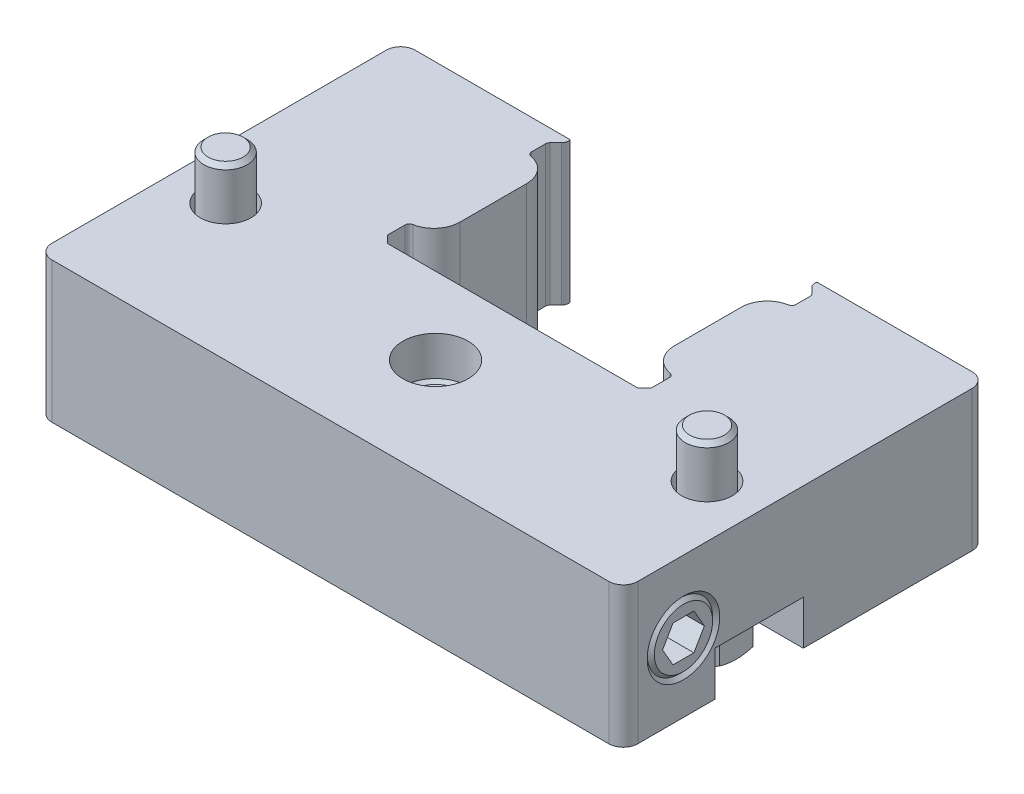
ISO-10303-21;
HEADER;
FILE_DESCRIPTION(('STEP AP214'),'2;1');
FILE_NAME('part.step','',(''),(''),'','','');
FILE_SCHEMA(('AUTOMOTIVE_DESIGN { 1 0 10303 214 1 1 1 1 }'));
ENDSEC;
DATA;
#1=APPLICATION_CONTEXT('core data for automotive mechanical design processes');
#2=APPLICATION_PROTOCOL_DEFINITION('international standard','automotive_design',2000,#1);
#3=PRODUCT_CONTEXT('',#1,'mechanical');
#4=PRODUCT('Part','Part','',(#3));
#5=PRODUCT_RELATED_PRODUCT_CATEGORY('part','',(#4));
#6=PRODUCT_DEFINITION_FORMATION('','',#4);
#7=PRODUCT_DEFINITION_CONTEXT('part definition',#1,'design');
#8=PRODUCT_DEFINITION('design','',#6,#7);
#9=PRODUCT_DEFINITION_SHAPE('','',#8);
#10=(LENGTH_UNIT() NAMED_UNIT(*) SI_UNIT(.MILLI.,.METRE.));
#11=(NAMED_UNIT(*) PLANE_ANGLE_UNIT() SI_UNIT($,.RADIAN.));
#12=(NAMED_UNIT(*) SI_UNIT($,.STERADIAN.) SOLID_ANGLE_UNIT());
#13=UNCERTAINTY_MEASURE_WITH_UNIT(LENGTH_MEASURE(1.E-05),#10,'distance_accuracy_value','');
#14=(GEOMETRIC_REPRESENTATION_CONTEXT(3) GLOBAL_UNCERTAINTY_ASSIGNED_CONTEXT((#13)) GLOBAL_UNIT_ASSIGNED_CONTEXT((#10,
#11,#12)) REPRESENTATION_CONTEXT('',''));
#15=CARTESIAN_POINT('',(0.,0.,0.));
#16=DIRECTION('',(0.,0.,1.));
#17=DIRECTION('',(1.,0.,0.));
#18=AXIS2_PLACEMENT_3D('',#15,#16,#17);
#19=CARTESIAN_POINT('',(-16.6,91.283012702,20.175));
#20=DIRECTION('',(0.,-1.,0.));
#21=DIRECTION('',(0.,0.,-1.));
#22=AXIS2_PLACEMENT_3D('',#19,#20,#21);
#23=CONICAL_SURFACE('',#22,0.,1.04719755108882);
#24=CARTESIAN_POINT('',(-16.6,91.283012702,20.175));
#25=VERTEX_POINT('',#24);
#26=VERTEX_LOOP('',#25);
#27=FACE_BOUND('',#26,.T.);
#28=CARTESIAN_POINT('',(-16.6,90.85,20.175));
#29=DIRECTION('',(0.,-1.,0.));
#30=DIRECTION('',(0.,0.,-1.));
#31=AXIS2_PLACEMENT_3D('',#28,#29,#30);
#32=CIRCLE('',#31,0.750000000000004);
#33=CARTESIAN_POINT('',(-16.6,90.85,19.425));
#34=VERTEX_POINT('',#33);
#35=EDGE_CURVE('P0_E1734',#34,#34,#32,.F.);
#36=ORIENTED_EDGE('',*,*,#35,.F.);
#37=EDGE_LOOP('',(#36));
#38=FACE_BOUND('',#37,.T.);
#39=ADVANCED_FACE('P0_F35',(#27,#38),#23,.F.);
#40=CARTESIAN_POINT('',(-16.6,90.85,20.175));
#41=DIRECTION('',(0.,-1.,0.));
#42=DIRECTION('',(0.,0.,-1.));
#43=AXIS2_PLACEMENT_3D('',#40,#41,#42);
#44=CYLINDRICAL_SURFACE('',#43,0.750000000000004);
#45=ORIENTED_EDGE('',*,*,#35,.T.);
#46=EDGE_LOOP('',(#45));
#47=FACE_BOUND('',#46,.T.);
#48=CARTESIAN_POINT('',(-16.6,89.85,20.175));
#49=DIRECTION('',(0.,-1.,0.));
#50=DIRECTION('',(0.,0.,-1.));
#51=AXIS2_PLACEMENT_3D('',#48,#49,#50);
#52=CIRCLE('',#51,0.750000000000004);
#53=CARTESIAN_POINT('',(-16.6,89.85,19.425));
#54=VERTEX_POINT('',#53);
#55=EDGE_CURVE('P0_E39',#54,#54,#52,.F.);
#56=ORIENTED_EDGE('',*,*,#55,.F.);
#57=EDGE_LOOP('',(#56));
#58=FACE_BOUND('',#57,.T.);
#59=ADVANCED_FACE('P0_F1437',(#47,#58),#44,.F.);
#60=CARTESIAN_POINT('',(-17.359,89.85,19.416));
#61=DIRECTION('',(0.,1.,0.));
#62=DIRECTION('',(0.,0.,1.));
#63=AXIS2_PLACEMENT_3D('',#60,#61,#62);
#64=PLANE('',#63);
#65=CARTESIAN_POINT('',(-16.6,89.85,20.175));
#66=DIRECTION('',(0.,-1.,0.));
#67=DIRECTION('',(1.,0.,0.));
#68=AXIS2_PLACEMENT_3D('',#65,#66,#67);
#69=CIRCLE('',#68,0.745000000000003);
#70=CARTESIAN_POINT('',(-15.855,89.85,20.175));
#71=VERTEX_POINT('',#70);
#72=EDGE_CURVE('P0_E1729',#71,#71,#69,.F.);
#73=ORIENTED_EDGE('',*,*,#72,.F.);
#74=EDGE_LOOP('',(#73));
#75=FACE_BOUND('',#74,.T.);
#76=ORIENTED_EDGE('',*,*,#55,.T.);
#77=EDGE_LOOP('',(#76));
#78=FACE_BOUND('',#77,.T.);
#79=ADVANCED_FACE('P0_F1429',(#75,#78),#64,.T.);
#80=CARTESIAN_POINT('',(-16.6,89.85,20.175));
#81=DIRECTION('',(0.,-1.,0.));
#82=DIRECTION('',(1.,0.,0.));
#83=AXIS2_PLACEMENT_3D('',#80,#81,#82);
#84=CYLINDRICAL_SURFACE('',#83,0.745000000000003);
#85=ORIENTED_EDGE('',*,*,#72,.T.);
#86=EDGE_LOOP('',(#85));
#87=FACE_BOUND('',#86,.T.);
#88=CARTESIAN_POINT('',(-16.6,88.1,20.175));
#89=DIRECTION('',(0.,-1.,0.));
#90=DIRECTION('',(1.,0.,0.));
#91=AXIS2_PLACEMENT_3D('',#88,#89,#90);
#92=CIRCLE('',#91,0.745000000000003);
#93=CARTESIAN_POINT('',(-15.855,88.1,20.175));
#94=VERTEX_POINT('',#93);
#95=EDGE_CURVE('P0_E531',#94,#94,#92,.T.);
#96=ORIENTED_EDGE('',*,*,#95,.T.);
#97=EDGE_LOOP('',(#96));
#98=FACE_BOUND('',#97,.T.);
#99=ADVANCED_FACE('P0_F588',(#87,#98),#84,.F.);
#100=CARTESIAN_POINT('',(-16.6,85.85,20.175));
#101=DIRECTION('',(0.,1.,0.));
#102=DIRECTION('',(0.,0.,1.));
#103=AXIS2_PLACEMENT_3D('',#100,#101,#102);
#104=CONICAL_SURFACE('',#103,2.,1.04719755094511);
#105=CARTESIAN_POINT('',(-16.6,85.85,20.175));
#106=DIRECTION('',(0.,1.,0.));
#107=DIRECTION('',(0.,0.,1.));
#108=AXIS2_PLACEMENT_3D('',#105,#106,#107);
#109=CIRCLE('',#108,2.);
#110=CARTESIAN_POINT('',(-14.6,85.85,20.1749999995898));
#111=VERTEX_POINT('',#110);
#112=CARTESIAN_POINT('',(-15.5999999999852,85.85,18.4429491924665));
#113=VERTEX_POINT('',#112);
#114=EDGE_CURVE('P0_E505',#111,#113,#109,.T.);
#115=ORIENTED_EDGE('',*,*,#114,.T.);
#116=CARTESIAN_POINT('',(-14.6000000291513,86.0286327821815,19.0202994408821));
#117=CARTESIAN_POINT('',(-14.6814137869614,86.0014949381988,18.9732951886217));
#118=CARTESIAN_POINT('',(-14.7634581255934,85.9766288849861,18.9259268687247));
#119=CARTESIAN_POINT('',(-14.9282701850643,85.9327778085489,18.8307725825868));
#120=CARTESIAN_POINT('',(-15.0110321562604,85.9137637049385,18.782989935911));
#121=CARTESIAN_POINT('',(-15.1776596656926,85.882637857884,18.6867874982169));
#122=CARTESIAN_POINT('',(-15.2615263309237,85.870533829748,18.6383670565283));
#123=CARTESIAN_POINT('',(-15.3879553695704,85.8582854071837,18.5653732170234));
#124=CARTESIAN_POINT('',(-15.4303131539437,85.8551869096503,18.540917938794));
#125=CARTESIAN_POINT('',(-15.5151120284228,85.8510408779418,18.4919592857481));
#126=CARTESIAN_POINT('',(-15.5575531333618,85.8499937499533,18.4674559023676));
#127=CARTESIAN_POINT('',(-15.5999999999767,85.8499999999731,18.4429491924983));
#128=B_SPLINE_CURVE_WITH_KNOTS('',3,(#116,#117,#118,#119,#120,#121,#122,#123,#124,#125,#126,
#127),.UNSPECIFIED.,.F.,.F.,(4,2,2,2,2,4),(0.,0.293614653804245,0.585745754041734,
0.878202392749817,1.02518996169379,1.1722066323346),.UNSPECIFIED.);
#129=CARTESIAN_POINT('',(-14.6000000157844,86.0286327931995,19.0202994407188));
#130=VERTEX_POINT('',#129);
#131=EDGE_CURVE('P0_E508',#130,#113,#128,.T.);
#132=ORIENTED_EDGE('',*,*,#131,.F.);
#133=CARTESIAN_POINT('',(-14.6,85.85,20.1749999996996));
#134=CARTESIAN_POINT('',(-14.6,85.8499937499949,20.1259865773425));
#135=CARTESIAN_POINT('',(-14.6,85.8510408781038,20.0769798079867));
#136=CARTESIAN_POINT('',(-14.6,85.8551869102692,19.9790624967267));
#137=CARTESIAN_POINT('',(-14.6,85.8582854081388,19.9301519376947));
#138=CARTESIAN_POINT('',(-14.6,85.8705338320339,19.7841642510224));
#139=CARTESIAN_POINT('',(-14.6,85.8826378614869,19.6873233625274));
#140=CARTESIAN_POINT('',(-14.6,85.9137637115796,19.4949184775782));
#141=CARTESIAN_POINT('',(-14.6,85.9327778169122,19.3993531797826));
#142=CARTESIAN_POINT('',(-14.6,85.9766288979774,19.2090445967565));
#143=CARTESIAN_POINT('',(-14.6,86.0014949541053,19.114307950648));
#144=CARTESIAN_POINT('',(-14.6,86.0286328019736,19.0202994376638));
#145=B_SPLINE_CURVE_WITH_KNOTS('',3,(#133,#134,#135,#136,#137,#138,#139,#140,#141,#142,#143,
#144),.UNSPECIFIED.,.F.,.F.,(4,2,2,2,2,4),(0.,0.147016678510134,0.294004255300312,
0.586460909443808,0.878592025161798,1.17220669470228),.UNSPECIFIED.);
#146=EDGE_CURVE('P0_E501',#111,#130,#145,.T.);
#147=ORIENTED_EDGE('',*,*,#146,.F.);
#148=EDGE_LOOP('',(#115,#132,#147));
#149=FACE_BOUND('',#148,.T.);
#150=ADVANCED_FACE('P0_F503',(#149),#104,.T.);
#151=CARTESIAN_POINT('',(-16.6,85.85,20.175));
#152=DIRECTION('',(0.,1.,0.));
#153=DIRECTION('',(0.,0.,1.));
#154=AXIS2_PLACEMENT_3D('',#151,#152,#153);
#155=CONICAL_SURFACE('',#154,2.,1.04719755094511);
#156=CARTESIAN_POINT('',(-16.6,85.85,20.175));
#157=DIRECTION('',(0.,1.,0.));
#158=DIRECTION('',(0.,0.,1.));
#159=AXIS2_PLACEMENT_3D('',#156,#157,#158);
#160=CIRCLE('',#159,2.);
#161=CARTESIAN_POINT('',(-17.5999999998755,85.850000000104,18.4429491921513));
#162=VERTEX_POINT('',#161);
#163=EDGE_CURVE('P0_E530',#113,#162,#160,.T.);
#164=ORIENTED_EDGE('',*,*,#163,.T.);
#165=CARTESIAN_POINT('',(-16.6000000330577,86.0286327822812,17.8655989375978));
#166=CARTESIAN_POINT('',(-16.6814137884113,86.0014949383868,17.9126031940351));
#167=CARTESIAN_POINT('',(-16.7634581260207,85.9766288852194,17.9599715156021));
#168=CARTESIAN_POINT('',(-16.928270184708,85.9327778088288,18.0551258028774));
#169=CARTESIAN_POINT('',(-17.0110321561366,85.91376370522,18.1029084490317));
#170=CARTESIAN_POINT('',(-17.1776596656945,85.8826378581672,18.1991108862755));
#171=CARTESIAN_POINT('',(-17.2615263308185,85.8705338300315,18.2475313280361));
#172=CARTESIAN_POINT('',(-17.3879553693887,85.8582854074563,18.3205251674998));
#173=CARTESIAN_POINT('',(-17.4303131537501,85.8551869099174,18.3449804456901));
#174=CARTESIAN_POINT('',(-17.5151120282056,85.8510408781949,18.3939390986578));
#175=CARTESIAN_POINT('',(-17.5575531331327,85.8499937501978,18.4184424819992));
#176=CARTESIAN_POINT('',(-17.5999999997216,85.850000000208,18.4429491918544));
#177=B_SPLINE_CURVE_WITH_KNOTS('',3,(#165,#166,#167,#168,#169,#170,#171,#172,#173,#174,#175,
#176),.UNSPECIFIED.,.F.,.F.,(4,2,2,2,2,4),(0.,0.293614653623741,0.585745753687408,
0.878202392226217,1.02518996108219,1.17220663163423),.UNSPECIFIED.);
#178=CARTESIAN_POINT('',(-16.6000000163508,86.0286327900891,17.8655989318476));
#179=VERTEX_POINT('',#178);
#180=EDGE_CURVE('P0_E600',#179,#162,#177,.T.);
#181=ORIENTED_EDGE('',*,*,#180,.F.);
#182=CARTESIAN_POINT('',(-15.5999999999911,85.8499999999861,18.4429491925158));
#183=CARTESIAN_POINT('',(-15.6424468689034,85.8499937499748,18.4184424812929));
#184=CARTESIAN_POINT('',(-15.6848879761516,85.851040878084,18.3939390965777));
#185=CARTESIAN_POINT('',(-15.7696868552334,85.855186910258,18.3449804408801));
#186=CARTESIAN_POINT('',(-15.8120446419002,85.8582854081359,18.3205251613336));
#187=CARTESIAN_POINT('',(-15.938473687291,85.8705338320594,18.2475313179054));
#188=CARTESIAN_POINT('',(-16.0223403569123,85.8826378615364,18.1991108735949));
#189=CARTESIAN_POINT('',(-16.1889678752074,85.9137637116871,18.1029084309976));
#190=CARTESIAN_POINT('',(-16.2717298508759,85.9327778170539,18.05512578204));
#191=CARTESIAN_POINT('',(-16.4365419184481,85.9766288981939,17.9599714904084));
#192=CARTESIAN_POINT('',(-16.5185862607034,86.0014949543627,17.9126031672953));
#193=CARTESIAN_POINT('',(-16.6000000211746,86.028632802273,17.8655989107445));
#194=B_SPLINE_CURVE_WITH_KNOTS('',3,(#182,#183,#184,#185,#186,#187,#188,#189,#190,#191,#192,
#193),.UNSPECIFIED.,.F.,.F.,(4,2,2,2,2,4),(0.,0.147016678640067,0.294004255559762,
0.586460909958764,0.878592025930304,1.17220669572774),.UNSPECIFIED.);
#195=EDGE_CURVE('P0_E575',#113,#179,#194,.T.);
#196=ORIENTED_EDGE('',*,*,#195,.F.);
#197=EDGE_LOOP('',(#164,#181,#196));
#198=FACE_BOUND('',#197,.T.);
#199=ADVANCED_FACE('P0_F587',(#198),#155,.T.);
#200=CARTESIAN_POINT('',(-16.6,85.85,20.175));
#201=DIRECTION('',(0.,1.,0.));
#202=DIRECTION('',(0.,0.,1.));
#203=AXIS2_PLACEMENT_3D('',#200,#201,#202);
#204=CONICAL_SURFACE('',#203,2.,1.04719755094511);
#205=CARTESIAN_POINT('',(-16.6,85.85,20.175));
#206=DIRECTION('',(0.,1.,0.));
#207=DIRECTION('',(0.,0.,1.));
#208=AXIS2_PLACEMENT_3D('',#205,#206,#207);
#209=CIRCLE('',#208,2.);
#210=CARTESIAN_POINT('',(-18.6,85.85,20.1749999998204));
#211=VERTEX_POINT('',#210);
#212=EDGE_CURVE('P0_E1725',#162,#211,#209,.T.);
#213=ORIENTED_EDGE('',*,*,#212,.T.);
#214=CARTESIAN_POINT('',(-18.6000000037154,86.0286327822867,19.020299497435));
#215=CARTESIAN_POINT('',(-18.6000000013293,86.0014949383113,19.1143080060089));
#216=CARTESIAN_POINT('',(-18.6000000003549,85.9766288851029,19.209044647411));
#217=CARTESIAN_POINT('',(-18.5999999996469,85.9327778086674,19.3993532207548));
#218=CARTESIAN_POINT('',(-18.599999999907,85.9137637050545,19.4949185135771));
#219=CARTESIAN_POINT('',(-18.6000000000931,85.8826378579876,19.6873233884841));
#220=CARTESIAN_POINT('',(-18.6000000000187,85.8705338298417,19.7841642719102));
#221=CARTESIAN_POINT('',(-18.5999999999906,85.8582854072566,19.9301519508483));
#222=CARTESIAN_POINT('',(-18.5999999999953,85.8551869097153,19.9790625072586));
#223=CARTESIAN_POINT('',(-18.6000000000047,85.8510408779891,20.0769798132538));
#224=CARTESIAN_POINT('',(-18.6000000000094,85.8499937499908,20.1259865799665));
#225=CARTESIAN_POINT('',(-18.6,85.85,20.1749999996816));
#226=B_SPLINE_CURVE_WITH_KNOTS('',3,(#214,#215,#216,#217,#218,#219,#220,#221,#222,#223,#224,
#225),.UNSPECIFIED.,.F.,.F.,(4,2,2,2,2,4),(0.,0.293614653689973,0.585745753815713,
0.878202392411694,1.02518996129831,1.17220663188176),.UNSPECIFIED.);
#227=CARTESIAN_POINT('',(-18.6000000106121,86.0286327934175,19.0202994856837));
#228=VERTEX_POINT('',#227);
#229=EDGE_CURVE('P0_E644',#228,#211,#226,.T.);
#230=ORIENTED_EDGE('',*,*,#229,.F.);
#231=CARTESIAN_POINT('',(-17.5999999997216,85.850000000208,18.4429491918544));
#232=CARTESIAN_POINT('',(-17.6424468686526,85.8499937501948,18.4674559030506));
#233=CARTESIAN_POINT('',(-17.6848879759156,85.8510408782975,18.4919592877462));
#234=CARTESIAN_POINT('',(-17.769686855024,85.855186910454,18.5409179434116));
#235=CARTESIAN_POINT('',(-17.8120446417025,85.858285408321,18.5653732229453));
#236=CARTESIAN_POINT('',(-17.9384736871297,85.8705338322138,18.6383670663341));
#237=CARTESIAN_POINT('',(-18.0223403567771,85.8826378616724,18.6867875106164));
#238=CARTESIAN_POINT('',(-18.1889678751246,85.9137637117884,18.7829899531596));
#239=CARTESIAN_POINT('',(-18.2717298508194,85.9327778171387,18.8307726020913));
#240=CARTESIAN_POINT('',(-18.4365419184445,85.9766288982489,18.9259268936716));
#241=CARTESIAN_POINT('',(-18.5185862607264,86.0014949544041,18.9732952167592));
#242=CARTESIAN_POINT('',(-18.6000000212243,86.028632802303,19.0202994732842));
#243=B_SPLINE_CURVE_WITH_KNOTS('',3,(#231,#232,#233,#234,#235,#236,#237,#238,#239,#240,#241,
#242),.UNSPECIFIED.,.F.,.F.,(4,2,2,2,2,4),(0.,0.147016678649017,0.294004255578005,
0.586460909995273,0.878592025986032,1.17220669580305),.UNSPECIFIED.);
#244=EDGE_CURVE('P0_E608',#162,#228,#243,.T.);
#245=ORIENTED_EDGE('',*,*,#244,.F.);
#246=EDGE_LOOP('',(#213,#230,#245));
#247=FACE_BOUND('',#246,.T.);
#248=ADVANCED_FACE('P0_F594',(#247),#204,.T.);
#249=CARTESIAN_POINT('',(-16.6,85.85,20.175));
#250=DIRECTION('',(0.,1.,0.));
#251=DIRECTION('',(0.,0.,1.));
#252=AXIS2_PLACEMENT_3D('',#249,#250,#251);
#253=CONICAL_SURFACE('',#252,2.,1.04719755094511);
#254=CARTESIAN_POINT('',(-16.6,85.85,20.175));
#255=DIRECTION('',(0.,1.,0.));
#256=DIRECTION('',(0.,0.,1.));
#257=AXIS2_PLACEMENT_3D('',#254,#255,#256);
#258=CIRCLE('',#257,2.);
#259=CARTESIAN_POINT('',(-17.6000000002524,85.8499999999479,21.907050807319));
#260=VERTEX_POINT('',#259);
#261=EDGE_CURVE('P0_E1722',#211,#260,#258,.T.);
#262=ORIENTED_EDGE('',*,*,#261,.T.);
#263=CARTESIAN_POINT('',(-18.5999999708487,86.0286327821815,21.3297005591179));
#264=CARTESIAN_POINT('',(-18.5185862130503,86.0014949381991,21.376704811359));
#265=CARTESIAN_POINT('',(-18.4365418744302,85.9766288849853,21.4240731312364));
#266=CARTESIAN_POINT('',(-18.271729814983,85.9327778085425,21.5192274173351));
#267=CARTESIAN_POINT('',(-18.1889678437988,85.9137637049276,21.5670100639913));
#268=CARTESIAN_POINT('',(-18.0223403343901,85.8826378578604,21.663212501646));
#269=CARTESIAN_POINT('',(-17.9384736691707,85.8705338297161,21.7116329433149));
#270=CARTESIAN_POINT('',(-17.8120446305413,85.8582854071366,21.7846267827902));
#271=CARTESIAN_POINT('',(-17.7696868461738,85.8551869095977,21.8090820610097));
#272=CARTESIAN_POINT('',(-17.684887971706,85.8510408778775,21.8580407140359));
#273=CARTESIAN_POINT('',(-17.6424468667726,85.8499937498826,21.8825440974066));
#274=CARTESIAN_POINT('',(-17.6000000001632,85.8499999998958,21.9070508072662));
#275=B_SPLINE_CURVE_WITH_KNOTS('',3,(#263,#264,#265,#266,#267,#268,#269,#270,#271,#272,#273,
#274),.UNSPECIFIED.,.F.,.F.,(4,2,2,2,2,4),(0.,0.293614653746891,0.585745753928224,
0.878202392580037,1.02518996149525,1.17220663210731),.UNSPECIFIED.);
#276=CARTESIAN_POINT('',(-18.5999999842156,86.0286327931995,21.3297005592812));
#277=VERTEX_POINT('',#276);
#278=EDGE_CURVE('P0_E660',#277,#260,#275,.T.);
#279=ORIENTED_EDGE('',*,*,#278,.F.);
#280=CARTESIAN_POINT('',(-18.6,85.85,20.1749999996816));
#281=CARTESIAN_POINT('',(-18.6,85.8499937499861,20.2240134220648));
#282=CARTESIAN_POINT('',(-18.6,85.8510408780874,20.2730201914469));
#283=CARTESIAN_POINT('',(-18.6,85.8551869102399,20.3709375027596));
#284=CARTESIAN_POINT('',(-18.6,85.8582854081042,20.419848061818));
#285=CARTESIAN_POINT('',(-18.6,85.8705338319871,20.5658357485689));
#286=CARTESIAN_POINT('',(-18.6,85.8826378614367,20.6626766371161));
#287=CARTESIAN_POINT('',(-18.6,85.9137637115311,20.8550815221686));
#288=CARTESIAN_POINT('',(-18.6,85.9327778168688,20.9506468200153));
#289=CARTESIAN_POINT('',(-18.6,85.976628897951,21.1409554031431));
#290=CARTESIAN_POINT('',(-18.6,86.0014949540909,21.2356920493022));
#291=CARTESIAN_POINT('',(-18.6,86.0286328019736,21.3297005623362));
#292=B_SPLINE_CURVE_WITH_KNOTS('',3,(#280,#281,#282,#283,#284,#285,#286,#287,#288,#289,#290,
#291),.UNSPECIFIED.,.F.,.F.,(4,2,2,2,2,4),(0.,0.14701667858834,0.294004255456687,
0.586460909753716,0.878592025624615,1.17220669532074),.UNSPECIFIED.);
#293=EDGE_CURVE('P0_E639',#211,#277,#292,.T.);
#294=ORIENTED_EDGE('',*,*,#293,.F.);
#295=EDGE_LOOP('',(#262,#279,#294));
#296=FACE_BOUND('',#295,.T.);
#297=ADVANCED_FACE('P0_F1959',(#296),#253,.T.);
#298=CARTESIAN_POINT('',(-16.6,85.85,20.175));
#299=DIRECTION('',(0.,1.,0.));
#300=DIRECTION('',(0.,0.,1.));
#301=AXIS2_PLACEMENT_3D('',#298,#299,#300);
#302=CONICAL_SURFACE('',#301,2.,1.04719755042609);
#303=CARTESIAN_POINT('',(-16.6,85.85,20.175));
#304=DIRECTION('',(0.,1.,0.));
#305=DIRECTION('',(0.,0.,1.));
#306=AXIS2_PLACEMENT_3D('',#303,#304,#305);
#307=CIRCLE('',#306,2.);
#308=CARTESIAN_POINT('',(-15.6000000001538,85.85,21.9070508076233));
#309=VERTEX_POINT('',#308);
#310=EDGE_CURVE('P0_E525',#260,#309,#307,.T.);
#311=ORIENTED_EDGE('',*,*,#310,.T.);
#312=CARTESIAN_POINT('',(-16.5999999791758,86.0286327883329,22.4844010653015));
#313=CARTESIAN_POINT('',(-16.518586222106,86.0014949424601,22.4373968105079));
#314=CARTESIAN_POINT('',(-16.4365418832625,85.9766288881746,22.3900284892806));
#315=CARTESIAN_POINT('',(-16.2717298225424,85.9327778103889,22.2948742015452));
#316=CARTESIAN_POINT('',(-16.1889678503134,85.9137637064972,22.2470915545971));
#317=CARTESIAN_POINT('',(-16.0223403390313,85.8826378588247,22.1508891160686));
#318=CARTESIAN_POINT('',(-15.9384736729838,85.8705338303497,22.1024686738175));
#319=CARTESIAN_POINT('',(-15.812044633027,85.8582854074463,22.0294748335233));
#320=CARTESIAN_POINT('',(-15.7696868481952,85.8551869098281,22.0050195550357));
#321=CARTESIAN_POINT('',(-15.6848879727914,85.8510408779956,21.9560609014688));
#322=CARTESIAN_POINT('',(-15.6424468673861,85.8499937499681,21.9315575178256));
#323=CARTESIAN_POINT('',(-15.6000000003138,85.8499999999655,21.9070508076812));
#324=B_SPLINE_CURVE_WITH_KNOTS('',3,(#312,#313,#314,#315,#316,#317,#318,#319,#320,#321,#322,
#323),.UNSPECIFIED.,.F.,.F.,(4,2,2,2,2,4),(0.,0.293614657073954,0.585745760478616,
0.878202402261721,1.02518997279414,1.17220664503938),.UNSPECIFIED.);
#325=CARTESIAN_POINT('',(-16.5999999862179,86.0286327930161,22.4844010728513));
#326=VERTEX_POINT('',#325);
#327=EDGE_CURVE('P0_E673',#326,#309,#324,.T.);
#328=ORIENTED_EDGE('',*,*,#327,.F.);
#329=CARTESIAN_POINT('',(-17.6000000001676,85.8499999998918,21.9070508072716));
#330=CARTESIAN_POINT('',(-17.5575531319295,85.8499937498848,21.9315575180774));
#331=CARTESIAN_POINT('',(-17.5151120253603,85.8510408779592,21.956060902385));
#332=CARTESIAN_POINT('',(-17.4303131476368,85.855186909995,22.0050195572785));
#333=CARTESIAN_POINT('',(-17.3879553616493,85.8582854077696,22.0294748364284));
#334=CARTESIAN_POINT('',(-17.2615263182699,85.8705338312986,22.1024686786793));
#335=CARTESIAN_POINT('',(-17.17765964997,85.8826378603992,22.1508891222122));
#336=CARTESIAN_POINT('',(-17.0110321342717,85.9137637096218,22.2470915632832));
#337=CARTESIAN_POINT('',(-16.9282701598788,85.9327778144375,22.2948742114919));
#338=CARTESIAN_POINT('',(-16.7634580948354,85.9766288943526,22.3900285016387));
#339=CARTESIAN_POINT('',(-16.6814137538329,86.0014949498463,22.437396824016));
#340=CARTESIAN_POINT('',(-16.5999999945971,86.0286327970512,22.4844010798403));
#341=B_SPLINE_CURVE_WITH_KNOTS('',3,(#329,#330,#331,#332,#333,#334,#335,#336,#337,#338,#339,
#340),.UNSPECIFIED.,.F.,.F.,(4,2,2,2,2,4),(0.,0.147016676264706,0.294004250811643,
0.58646090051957,0.878592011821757,1.17220667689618),.UNSPECIFIED.);
#342=EDGE_CURVE('P0_E663',#260,#326,#341,.T.);
#343=ORIENTED_EDGE('',*,*,#342,.F.);
#344=EDGE_LOOP('',(#311,#328,#343));
#345=FACE_BOUND('',#344,.T.);
#346=ADVANCED_FACE('P0_F1966',(#345),#302,.T.);
#347=CARTESIAN_POINT('',(-16.6,85.85,20.175));
#348=DIRECTION('',(0.,1.,0.));
#349=DIRECTION('',(0.,0.,1.));
#350=AXIS2_PLACEMENT_3D('',#347,#348,#349);
#351=CONICAL_SURFACE('',#350,2.,1.04719755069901);
#352=CARTESIAN_POINT('',(-14.6,86.0286328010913,21.3297005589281));
#353=CARTESIAN_POINT('',(-14.6,86.0014949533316,21.2356920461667));
#354=CARTESIAN_POINT('',(-14.6,85.9766288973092,21.1409554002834));
#355=CARTESIAN_POINT('',(-14.6,85.9327778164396,20.9506468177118));
#356=CARTESIAN_POINT('',(-14.6,85.9137637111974,20.8550815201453));
#357=CARTESIAN_POINT('',(-14.6,85.8826378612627,20.6626766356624));
#358=CARTESIAN_POINT('',(-14.6,85.8705338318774,20.5658357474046));
#359=CARTESIAN_POINT('',(-14.6,85.85828540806,20.4198480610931));
#360=CARTESIAN_POINT('',(-14.6,85.8551869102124,20.3709375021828));
#361=CARTESIAN_POINT('',(-14.6,85.8510408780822,20.273020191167));
#362=CARTESIAN_POINT('',(-14.6,85.8499937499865,20.2240134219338));
#363=CARTESIAN_POINT('',(-14.6,85.85,20.1749999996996));
#364=B_SPLINE_CURVE_WITH_KNOTS('',3,(#352,#353,#354,#355,#356,#357,#358,#359,#360,#361,#362,
#363),.UNSPECIFIED.,.F.,.F.,(4,2,2,2,2,4),(0.,0.29361466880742,0.58574578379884,
0.878202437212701,1.0251900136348,1.17220669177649),.UNSPECIFIED.);
#365=CARTESIAN_POINT('',(-14.600000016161,86.0286327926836,21.3297005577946));
#366=VERTEX_POINT('',#365);
#367=EDGE_CURVE('P0_E512',#366,#111,#364,.T.);
#368=ORIENTED_EDGE('',*,*,#367,.F.);
#369=CARTESIAN_POINT('',(-15.6000000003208,85.8499999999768,21.9070508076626));
#370=CARTESIAN_POINT('',(-15.5575531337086,85.8499937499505,21.8825440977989));
#371=CARTESIAN_POINT('',(-15.5151120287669,85.8510408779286,21.858040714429));
#372=CARTESIAN_POINT('',(-15.43031315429,85.8551869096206,21.809082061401));
#373=CARTESIAN_POINT('',(-15.3879553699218,85.8582854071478,21.7846267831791));
#374=CARTESIAN_POINT('',(-15.2615263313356,85.8705338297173,21.7116329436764));
#375=CARTESIAN_POINT('',(-15.1776596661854,85.8826378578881,21.663212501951));
#376=CARTESIAN_POINT('',(-15.0110321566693,85.9137637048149,21.5670100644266));
#377=CARTESIAN_POINT('',(-14.9282701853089,85.9327778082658,21.5192274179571));
#378=CARTESIAN_POINT('',(-14.763458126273,85.9766288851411,21.4240731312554));
#379=CARTESIAN_POINT('',(-14.6814137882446,86.0014949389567,21.3767048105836));
#380=CARTESIAN_POINT('',(-14.6000000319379,86.0286327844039,21.3297005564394));
#381=B_SPLINE_CURVE_WITH_KNOTS('',3,(#369,#370,#371,#372,#373,#374,#375,#376,#377,#378,#379,
#380),.UNSPECIFIED.,.F.,.F.,(4,2,2,2,2,4),(0.,0.147016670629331,0.29400423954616,
0.586460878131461,0.878591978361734,1.17220663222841),.UNSPECIFIED.);
#382=EDGE_CURVE('P0_E519',#309,#366,#381,.T.);
#383=ORIENTED_EDGE('',*,*,#382,.F.);
#384=CARTESIAN_POINT('',(-16.6,85.85,20.175));
#385=DIRECTION('',(0.,1.,0.));
#386=DIRECTION('',(0.,0.,1.));
#387=AXIS2_PLACEMENT_3D('',#384,#385,#386);
#388=CIRCLE('',#387,2.);
#389=EDGE_CURVE('P0_E516',#309,#111,#388,.T.);
#390=ORIENTED_EDGE('',*,*,#389,.T.);
#391=EDGE_LOOP('',(#368,#383,#390));
#392=FACE_BOUND('',#391,.T.);
#393=ADVANCED_FACE('P0_F517',(#392),#351,.T.);
#394=CARTESIAN_POINT('',(-17.76886,88.1,19.00614));
#395=DIRECTION('',(0.,1.,0.));
#396=DIRECTION('',(0.,0.,1.));
#397=AXIS2_PLACEMENT_3D('',#394,#395,#396);
#398=PLANE('',#397);
#399=ORIENTED_EDGE('',*,*,#95,.F.);
#400=EDGE_LOOP('',(#399));
#401=FACE_BOUND('',#400,.T.);
#402=CARTESIAN_POINT('',(-16.6,88.1,20.175));
#403=DIRECTION('',(0.,-1.,0.));
#404=DIRECTION('',(0.,0.,-1.));
#405=AXIS2_PLACEMENT_3D('',#402,#403,#404);
#406=CIRCLE('',#405,1.155);
#407=CARTESIAN_POINT('',(-16.6,88.1,19.02));
#408=VERTEX_POINT('',#407);
#409=EDGE_CURVE('P0_E524',#408,#408,#406,.F.);
#410=ORIENTED_EDGE('',*,*,#409,.F.);
#411=EDGE_LOOP('',(#410));
#412=FACE_BOUND('',#411,.T.);
#413=ADVANCED_FACE('P0_F1439',(#401,#412),#398,.F.);
#414=CARTESIAN_POINT('',(-18.624,85.85,18.151));
#415=DIRECTION('',(0.,1.,0.));
#416=DIRECTION('',(0.,0.,1.));
#417=AXIS2_PLACEMENT_3D('',#414,#415,#416);
#418=PLANE('',#417);
#419=CARTESIAN_POINT('',(-16.6,85.85,20.175));
#420=DIRECTION('',(0.,-1.,0.));
#421=DIRECTION('',(0.,0.,-1.));
#422=AXIS2_PLACEMENT_3D('',#419,#420,#421);
#423=CIRCLE('',#422,1.155);
#424=CARTESIAN_POINT('',(-16.6,85.85,19.02));
#425=VERTEX_POINT('',#424);
#426=EDGE_CURVE('P0_E1716',#425,#425,#423,.T.);
#427=ORIENTED_EDGE('',*,*,#426,.F.);
#428=EDGE_LOOP('',(#427));
#429=FACE_BOUND('',#428,.T.);
#430=ORIENTED_EDGE('',*,*,#310,.F.);
#431=ORIENTED_EDGE('',*,*,#261,.F.);
#432=ORIENTED_EDGE('',*,*,#212,.F.);
#433=ORIENTED_EDGE('',*,*,#163,.F.);
#434=ORIENTED_EDGE('',*,*,#114,.F.);
#435=ORIENTED_EDGE('',*,*,#389,.F.);
#436=EDGE_LOOP('',(#430,#431,#432,#433,#434,#435));
#437=FACE_BOUND('',#436,.T.);
#438=ADVANCED_FACE('P0_F527',(#429,#437),#418,.F.);
#439=CARTESIAN_POINT('',(-16.6,88.1,20.175));
#440=DIRECTION('',(0.,-1.,0.));
#441=DIRECTION('',(0.,0.,-1.));
#442=AXIS2_PLACEMENT_3D('',#439,#440,#441);
#443=CYLINDRICAL_SURFACE('',#442,1.155);
#444=ORIENTED_EDGE('',*,*,#426,.T.);
#445=EDGE_LOOP('',(#444));
#446=FACE_BOUND('',#445,.T.);
#447=ORIENTED_EDGE('',*,*,#409,.T.);
#448=EDGE_LOOP('',(#447));
#449=FACE_BOUND('',#448,.T.);
#450=ADVANCED_FACE('P0_F1445',(#446,#449),#443,.F.);
#451=CARTESIAN_POINT('',(1.443375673,85.8,22.3));
#452=DIRECTION('',(-0.866025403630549,0.,-0.500000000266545));
#453=DIRECTION('',(-0.500000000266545,0.,0.866025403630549));
#454=AXIS2_PLACEMENT_3D('',#451,#452,#453);
#455=PLANE('',#454);
#456=DIRECTION('',(0.,-1.,0.));
#457=VECTOR('',#456,1.);
#458=CARTESIAN_POINT('',(0.721687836,86.914248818,23.55));
#459=LINE('',#458,#457);
#460=CARTESIAN_POINT('',(0.721687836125,88.028497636,23.55));
#461=VERTEX_POINT('',#460);
#462=CARTESIAN_POINT('',(0.721687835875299,85.8,23.550000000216));
#463=VERTEX_POINT('',#462);
#464=EDGE_CURVE('P0_E1132',#461,#463,#459,.T.);
#465=ORIENTED_EDGE('',*,*,#464,.F.);
#466=DIRECTION('',(0.500000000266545,0.,-0.866025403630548));
#467=VECTOR('',#466,1.);
#468=CARTESIAN_POINT('',(1.0825317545,88.028497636,22.925));
#469=LINE('',#468,#467);
#470=CARTESIAN_POINT('',(1.44337567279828,88.028497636,22.3000000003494));
#471=VERTEX_POINT('',#470);
#472=EDGE_CURVE('P0_E1188',#461,#471,#469,.T.);
#473=ORIENTED_EDGE('',*,*,#472,.T.);
#474=DIRECTION('',(0.,1.,0.));
#475=VECTOR('',#474,1.);
#476=CARTESIAN_POINT('',(1.443375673,86.914248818,22.3));
#477=LINE('',#476,#475);
#478=CARTESIAN_POINT('',(1.443375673,85.8,22.3));
#479=VERTEX_POINT('',#478);
#480=EDGE_CURVE('P0_E1131',#479,#471,#477,.T.);
#481=ORIENTED_EDGE('',*,*,#480,.F.);
#482=DIRECTION('',(-0.500000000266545,0.,0.866025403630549));
#483=VECTOR('',#482,1.);
#484=CARTESIAN_POINT('',(1.443375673,85.8,22.3));
#485=LINE('',#484,#483);
#486=EDGE_CURVE('P0_E1183',#479,#463,#485,.T.);
#487=ORIENTED_EDGE('',*,*,#486,.T.);
#488=EDGE_LOOP('',(#465,#473,#481,#487));
#489=FACE_BOUND('',#488,.T.);
#490=ADVANCED_FACE('P0_F1447',(#489),#455,.T.);
#491=CARTESIAN_POINT('',(-0.721687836,85.8,23.55));
#492=DIRECTION('',(0.,0.,-1.));
#493=DIRECTION('',(0.,1.,0.));
#494=AXIS2_PLACEMENT_3D('',#491,#492,#493);
#495=PLANE('',#494);
#496=DIRECTION('',(0.,-1.,0.));
#497=VECTOR('',#496,1.);
#498=CARTESIAN_POINT('',(-0.721687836,86.914248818,23.55));
#499=LINE('',#498,#497);
#500=CARTESIAN_POINT('',(-0.721687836,88.028497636,23.55));
#501=VERTEX_POINT('',#500);
#502=CARTESIAN_POINT('',(-0.721687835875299,85.8,23.550000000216));
#503=VERTEX_POINT('',#502);
#504=EDGE_CURVE('P0_E1133',#501,#503,#499,.T.);
#505=ORIENTED_EDGE('',*,*,#504,.F.);
#506=DIRECTION('',(1.,0.,0.));
#507=VECTOR('',#506,1.);
#508=CARTESIAN_POINT('',(0.,88.028497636,23.55));
#509=LINE('',#508,#507);
#510=EDGE_CURVE('P0_E1128',#501,#461,#509,.T.);
#511=ORIENTED_EDGE('',*,*,#510,.T.);
#512=ORIENTED_EDGE('',*,*,#464,.T.);
#513=DIRECTION('',(-1.,0.,0.));
#514=VECTOR('',#513,1.);
#515=CARTESIAN_POINT('',(0.,85.8,23.550000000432));
#516=LINE('',#515,#514);
#517=EDGE_CURVE('P0_E1180',#463,#503,#516,.T.);
#518=ORIENTED_EDGE('',*,*,#517,.T.);
#519=EDGE_LOOP('',(#505,#511,#512,#518));
#520=FACE_BOUND('',#519,.T.);
#521=ADVANCED_FACE('P0_F1450',(#520),#495,.T.);
#522=CARTESIAN_POINT('',(0.721687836,85.8,21.05));
#523=DIRECTION('',(-0.866025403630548,0.,0.500000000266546));
#524=DIRECTION('',(0.500000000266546,0.,0.866025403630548));
#525=AXIS2_PLACEMENT_3D('',#522,#523,#524);
#526=PLANE('',#525);
#527=ORIENTED_EDGE('',*,*,#480,.T.);
#528=DIRECTION('',(-0.500000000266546,0.,-0.866025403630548));
#529=VECTOR('',#528,1.);
#530=CARTESIAN_POINT('',(1.0825317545,88.028497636,21.675));
#531=LINE('',#530,#529);
#532=CARTESIAN_POINT('',(0.721687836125,88.028497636,21.05));
#533=VERTEX_POINT('',#532);
#534=EDGE_CURVE('P0_E1137',#471,#533,#531,.T.);
#535=ORIENTED_EDGE('',*,*,#534,.T.);
#536=DIRECTION('',(0.,1.,0.));
#537=VECTOR('',#536,1.);
#538=CARTESIAN_POINT('',(0.721687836,86.914248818,21.05));
#539=LINE('',#538,#537);
#540=CARTESIAN_POINT('',(0.721687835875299,85.8,21.049999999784));
#541=VERTEX_POINT('',#540);
#542=EDGE_CURVE('P0_E1136',#541,#533,#539,.T.);
#543=ORIENTED_EDGE('',*,*,#542,.F.);
#544=DIRECTION('',(0.500000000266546,0.,0.866025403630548));
#545=VECTOR('',#544,1.);
#546=CARTESIAN_POINT('',(0.721687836,85.8,21.05));
#547=LINE('',#546,#545);
#548=EDGE_CURVE('P0_E1178',#541,#479,#547,.T.);
#549=ORIENTED_EDGE('',*,*,#548,.T.);
#550=EDGE_LOOP('',(#527,#535,#543,#549));
#551=FACE_BOUND('',#550,.T.);
#552=ADVANCED_FACE('P0_F1454',(#551),#526,.T.);
#553=CARTESIAN_POINT('',(-0.721687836,85.8,23.55));
#554=DIRECTION('',(0.866025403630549,0.,-0.500000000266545));
#555=DIRECTION('',(-0.500000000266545,0.,-0.866025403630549));
#556=AXIS2_PLACEMENT_3D('',#553,#554,#555);
#557=PLANE('',#556);
#558=DIRECTION('',(0.,-1.,0.));
#559=VECTOR('',#558,1.);
#560=CARTESIAN_POINT('',(-1.443375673,86.914248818,22.3));
#561=LINE('',#560,#559);
#562=CARTESIAN_POINT('',(-1.443375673,88.028497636,22.3));
#563=VERTEX_POINT('',#562);
#564=CARTESIAN_POINT('',(-1.443375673,85.8,22.3));
#565=VERTEX_POINT('',#564);
#566=EDGE_CURVE('P0_E1119',#563,#565,#561,.T.);
#567=ORIENTED_EDGE('',*,*,#566,.F.);
#568=DIRECTION('',(-0.500000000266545,0.,-0.866025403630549));
#569=VECTOR('',#568,1.);
#570=CARTESIAN_POINT('',(-0.721687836,88.028497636,23.55));
#571=LINE('',#570,#569);
#572=EDGE_CURVE('P0_E1123',#563,#501,#571,.F.);
#573=ORIENTED_EDGE('',*,*,#572,.T.);
#574=ORIENTED_EDGE('',*,*,#504,.T.);
#575=DIRECTION('',(-0.500000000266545,0.,-0.866025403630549));
#576=VECTOR('',#575,1.);
#577=CARTESIAN_POINT('',(-0.721687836,85.8,23.55));
#578=LINE('',#577,#576);
#579=EDGE_CURVE('P0_E1182',#503,#565,#578,.T.);
#580=ORIENTED_EDGE('',*,*,#579,.T.);
#581=EDGE_LOOP('',(#567,#573,#574,#580));
#582=FACE_BOUND('',#581,.T.);
#583=ADVANCED_FACE('P0_F1458',(#582),#557,.T.);
#584=CARTESIAN_POINT('',(-0.721687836,88.028497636,21.05));
#585=DIRECTION('',(0.,0.,1.));
#586=DIRECTION('',(0.,-1.,0.));
#587=AXIS2_PLACEMENT_3D('',#584,#585,#586);
#588=PLANE('',#587);
#589=ORIENTED_EDGE('',*,*,#542,.T.);
#590=DIRECTION('',(-1.,0.,0.));
#591=VECTOR('',#590,1.);
#592=CARTESIAN_POINT('',(0.,88.028497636,21.05));
#593=LINE('',#592,#591);
#594=CARTESIAN_POINT('',(-0.721687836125,88.028497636,21.05));
#595=VERTEX_POINT('',#594);
#596=EDGE_CURVE('P0_E1191',#533,#595,#593,.T.);
#597=ORIENTED_EDGE('',*,*,#596,.T.);
#598=DIRECTION('',(0.,1.,0.));
#599=VECTOR('',#598,1.);
#600=CARTESIAN_POINT('',(-0.721687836,86.914248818,21.05));
#601=LINE('',#600,#599);
#602=CARTESIAN_POINT('',(-0.721687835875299,85.8,21.049999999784));
#603=VERTEX_POINT('',#602);
#604=EDGE_CURVE('P0_E1122',#603,#595,#601,.T.);
#605=ORIENTED_EDGE('',*,*,#604,.F.);
#606=DIRECTION('',(1.,0.,0.));
#607=VECTOR('',#606,1.);
#608=CARTESIAN_POINT('',(0.,85.8,21.049999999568));
#609=LINE('',#608,#607);
#610=EDGE_CURVE('P0_E1176',#603,#541,#609,.T.);
#611=ORIENTED_EDGE('',*,*,#610,.T.);
#612=EDGE_LOOP('',(#589,#597,#605,#611));
#613=FACE_BOUND('',#612,.T.);
#614=ADVANCED_FACE('P0_F1462',(#613),#588,.T.);
#615=CARTESIAN_POINT('',(-1.443375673,88.028497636,21.05));
#616=DIRECTION('',(0.,1.,0.));
#617=DIRECTION('',(0.,0.,1.));
#618=AXIS2_PLACEMENT_3D('',#615,#616,#617);
#619=PLANE('',#618);
#620=ORIENTED_EDGE('',*,*,#472,.F.);
#621=ORIENTED_EDGE('',*,*,#510,.F.);
#622=ORIENTED_EDGE('',*,*,#572,.F.);
#623=DIRECTION('',(-0.500000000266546,0.,0.866025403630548));
#624=VECTOR('',#623,1.);
#625=CARTESIAN_POINT('',(-1.0825317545,88.028497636,21.675));
#626=LINE('',#625,#624);
#627=EDGE_CURVE('P0_E1124',#595,#563,#626,.T.);
#628=ORIENTED_EDGE('',*,*,#627,.F.);
#629=ORIENTED_EDGE('',*,*,#596,.F.);
#630=ORIENTED_EDGE('',*,*,#534,.F.);
#631=EDGE_LOOP('',(#620,#621,#622,#628,#629,#630));
#632=FACE_BOUND('',#631,.T.);
#633=ADVANCED_FACE('P0_F1466',(#632),#619,.F.);
#634=CARTESIAN_POINT('',(-1.443375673,85.8,22.3));
#635=DIRECTION('',(0.866025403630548,0.,0.500000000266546));
#636=DIRECTION('',(0.500000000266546,0.,-0.866025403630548));
#637=AXIS2_PLACEMENT_3D('',#634,#635,#636);
#638=PLANE('',#637);
#639=ORIENTED_EDGE('',*,*,#604,.T.);
#640=ORIENTED_EDGE('',*,*,#627,.T.);
#641=ORIENTED_EDGE('',*,*,#566,.T.);
#642=DIRECTION('',(0.500000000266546,0.,-0.866025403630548));
#643=VECTOR('',#642,1.);
#644=CARTESIAN_POINT('',(-1.443375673,85.8,22.3));
#645=LINE('',#644,#643);
#646=EDGE_CURVE('P0_E1179',#565,#603,#645,.T.);
#647=ORIENTED_EDGE('',*,*,#646,.T.);
#648=EDGE_LOOP('',(#639,#640,#641,#647));
#649=FACE_BOUND('',#648,.T.);
#650=ADVANCED_FACE('P0_F1470',(#649),#638,.T.);
#651=CARTESIAN_POINT('',(17.971502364,89.3,26.121687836));
#652=DIRECTION('',(0.,0.500000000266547,-0.866025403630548));
#653=DIRECTION('',(0.,0.866025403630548,0.500000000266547));
#654=AXIS2_PLACEMENT_3D('',#651,#652,#653);
#655=PLANE('',#654);
#656=DIRECTION('',(1.,0.,0.));
#657=VECTOR('',#656,1.);
#658=CARTESIAN_POINT('',(19.085751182,89.3,26.121687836));
#659=LINE('',#658,#657);
#660=CARTESIAN_POINT('',(17.971502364,89.3,26.121687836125));
#661=VERTEX_POINT('',#660);
#662=CARTESIAN_POINT('',(20.2,89.299999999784,26.1216878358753));
#663=VERTEX_POINT('',#662);
#664=EDGE_CURVE('P0_E1151',#661,#663,#659,.T.);
#665=ORIENTED_EDGE('',*,*,#664,.F.);
#666=DIRECTION('',(0.,0.866025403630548,0.500000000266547));
#667=VECTOR('',#666,1.);
#668=CARTESIAN_POINT('',(17.971502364,89.925,26.4825317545));
#669=LINE('',#668,#667);
#670=CARTESIAN_POINT('',(17.971502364,90.5499999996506,26.8433756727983));
#671=VERTEX_POINT('',#670);
#672=EDGE_CURVE('P0_E1127',#661,#671,#669,.T.);
#673=ORIENTED_EDGE('',*,*,#672,.T.);
#674=DIRECTION('',(-1.,0.,0.));
#675=VECTOR('',#674,1.);
#676=CARTESIAN_POINT('',(19.085751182,90.55,26.843375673));
#677=LINE('',#676,#675);
#678=CARTESIAN_POINT('',(20.2,90.55,26.843375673));
#679=VERTEX_POINT('',#678);
#680=EDGE_CURVE('P0_E1150',#679,#671,#677,.T.);
#681=ORIENTED_EDGE('',*,*,#680,.F.);
#682=DIRECTION('',(0.,0.866025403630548,0.500000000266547));
#683=VECTOR('',#682,1.);
#684=CARTESIAN_POINT('',(20.2,89.3,26.121687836));
#685=LINE('',#684,#683);
#686=EDGE_CURVE('P0_E1090',#679,#663,#685,.F.);
#687=ORIENTED_EDGE('',*,*,#686,.T.);
#688=EDGE_LOOP('',(#665,#673,#681,#687));
#689=FACE_BOUND('',#688,.T.);
#690=ADVANCED_FACE('P0_F1474',(#689),#655,.T.);
#691=CARTESIAN_POINT('',(17.971502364,89.3,24.678312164));
#692=DIRECTION('',(0.,1.,0.));
#693=DIRECTION('',(0.,0.,1.));
#694=AXIS2_PLACEMENT_3D('',#691,#692,#693);
#695=PLANE('',#694);
#696=DIRECTION('',(1.,0.,0.));
#697=VECTOR('',#696,1.);
#698=CARTESIAN_POINT('',(19.085751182,89.3,24.678312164));
#699=LINE('',#698,#697);
#700=CARTESIAN_POINT('',(17.971502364,89.3,24.678312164));
#701=VERTEX_POINT('',#700);
#702=CARTESIAN_POINT('',(20.2,89.299999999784,24.6783121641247));
#703=VERTEX_POINT('',#702);
#704=EDGE_CURVE('P0_E1152',#701,#703,#699,.T.);
#705=ORIENTED_EDGE('',*,*,#704,.F.);
#706=DIRECTION('',(0.,0.,1.));
#707=VECTOR('',#706,1.);
#708=CARTESIAN_POINT('',(17.971502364,89.3,25.4));
#709=LINE('',#708,#707);
#710=EDGE_CURVE('P0_E1147',#701,#661,#709,.T.);
#711=ORIENTED_EDGE('',*,*,#710,.T.);
#712=ORIENTED_EDGE('',*,*,#664,.T.);
#713=DIRECTION('',(0.,0.,-1.));
#714=VECTOR('',#713,1.);
#715=CARTESIAN_POINT('',(20.2,89.299999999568,25.4));
#716=LINE('',#715,#714);
#717=EDGE_CURVE('P0_E1197',#663,#703,#716,.T.);
#718=ORIENTED_EDGE('',*,*,#717,.T.);
#719=EDGE_LOOP('',(#705,#711,#712,#718));
#720=FACE_BOUND('',#719,.T.);
#721=ADVANCED_FACE('P0_F1478',(#720),#695,.T.);
#722=CARTESIAN_POINT('',(17.971502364,90.55,26.843375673));
#723=DIRECTION('',(0.,-0.500000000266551,-0.866025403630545));
#724=DIRECTION('',(0.,0.866025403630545,-0.500000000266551));
#725=AXIS2_PLACEMENT_3D('',#722,#723,#724);
#726=PLANE('',#725);
#727=ORIENTED_EDGE('',*,*,#680,.T.);
#728=DIRECTION('',(0.,0.866025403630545,-0.500000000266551));
#729=VECTOR('',#728,1.);
#730=CARTESIAN_POINT('',(17.971502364,91.175,26.4825317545));
#731=LINE('',#730,#729);
#732=CARTESIAN_POINT('',(17.971502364,91.8,26.121687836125));
#733=VERTEX_POINT('',#732);
#734=EDGE_CURVE('P0_E1156',#671,#733,#731,.T.);
#735=ORIENTED_EDGE('',*,*,#734,.T.);
#736=DIRECTION('',(-1.,0.,0.));
#737=VECTOR('',#736,1.);
#738=CARTESIAN_POINT('',(19.085751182,91.8,26.121687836));
#739=LINE('',#738,#737);
#740=CARTESIAN_POINT('',(20.2,91.800000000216,26.1216878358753));
#741=VERTEX_POINT('',#740);
#742=EDGE_CURVE('P0_E1155',#741,#733,#739,.T.);
#743=ORIENTED_EDGE('',*,*,#742,.F.);
#744=DIRECTION('',(0.,0.866025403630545,-0.500000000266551));
#745=VECTOR('',#744,1.);
#746=CARTESIAN_POINT('',(20.2,90.55,26.843375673));
#747=LINE('',#746,#745);
#748=EDGE_CURVE('P0_E1086',#741,#679,#747,.F.);
#749=ORIENTED_EDGE('',*,*,#748,.T.);
#750=EDGE_LOOP('',(#727,#735,#743,#749));
#751=FACE_BOUND('',#750,.T.);
#752=ADVANCED_FACE('P0_F1482',(#751),#726,.T.);
#753=CARTESIAN_POINT('',(17.971502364,90.55,23.956624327));
#754=DIRECTION('',(0.,0.500000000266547,0.866025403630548));
#755=DIRECTION('',(0.,-0.866025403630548,0.500000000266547));
#756=AXIS2_PLACEMENT_3D('',#753,#754,#755);
#757=PLANE('',#756);
#758=DIRECTION('',(1.,0.,0.));
#759=VECTOR('',#758,1.);
#760=CARTESIAN_POINT('',(19.085751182,90.55,23.956624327));
#761=LINE('',#760,#759);
#762=CARTESIAN_POINT('',(17.971502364,90.55,23.956624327));
#763=VERTEX_POINT('',#762);
#764=CARTESIAN_POINT('',(20.2,90.55,23.956624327));
#765=VERTEX_POINT('',#764);
#766=EDGE_CURVE('P0_E1138',#763,#765,#761,.T.);
#767=ORIENTED_EDGE('',*,*,#766,.F.);
#768=DIRECTION('',(0.,-0.866025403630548,0.500000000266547));
#769=VECTOR('',#768,1.);
#770=CARTESIAN_POINT('',(17.971502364,90.55,23.956624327));
#771=LINE('',#770,#769);
#772=EDGE_CURVE('P0_E1142',#763,#701,#771,.T.);
#773=ORIENTED_EDGE('',*,*,#772,.T.);
#774=ORIENTED_EDGE('',*,*,#704,.T.);
#775=DIRECTION('',(0.,-0.866025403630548,0.500000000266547));
#776=VECTOR('',#775,1.);
#777=CARTESIAN_POINT('',(20.2,90.55,23.956624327));
#778=LINE('',#777,#776);
#779=EDGE_CURVE('P0_E1199',#703,#765,#778,.F.);
#780=ORIENTED_EDGE('',*,*,#779,.T.);
#781=EDGE_LOOP('',(#767,#773,#774,#780));
#782=FACE_BOUND('',#781,.T.);
#783=ADVANCED_FACE('P0_F1486',(#782),#757,.T.);
#784=CARTESIAN_POINT('',(17.971502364,91.8,26.121687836));
#785=DIRECTION('',(0.,-1.,0.));
#786=DIRECTION('',(0.,0.,-1.));
#787=AXIS2_PLACEMENT_3D('',#784,#785,#786);
#788=PLANE('',#787);
#789=ORIENTED_EDGE('',*,*,#742,.T.);
#790=DIRECTION('',(0.,0.,-1.));
#791=VECTOR('',#790,1.);
#792=CARTESIAN_POINT('',(17.971502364,91.8,25.4));
#793=LINE('',#792,#791);
#794=CARTESIAN_POINT('',(17.971502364,91.8,24.678312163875));
#795=VERTEX_POINT('',#794);
#796=EDGE_CURVE('P0_E1206',#733,#795,#793,.T.);
#797=ORIENTED_EDGE('',*,*,#796,.T.);
#798=DIRECTION('',(-1.,0.,0.));
#799=VECTOR('',#798,1.);
#800=CARTESIAN_POINT('',(19.085751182,91.8,24.678312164));
#801=LINE('',#800,#799);
#802=CARTESIAN_POINT('',(20.2,91.800000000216,24.6783121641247));
#803=VERTEX_POINT('',#802);
#804=EDGE_CURVE('P0_E1141',#803,#795,#801,.T.);
#805=ORIENTED_EDGE('',*,*,#804,.F.);
#806=DIRECTION('',(0.,0.,1.));
#807=VECTOR('',#806,1.);
#808=CARTESIAN_POINT('',(20.2,91.800000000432,25.4));
#809=LINE('',#808,#807);
#810=EDGE_CURVE('P0_E1194',#803,#741,#809,.T.);
#811=ORIENTED_EDGE('',*,*,#810,.T.);
#812=EDGE_LOOP('',(#789,#797,#805,#811));
#813=FACE_BOUND('',#812,.T.);
#814=ADVANCED_FACE('P0_F1490',(#813),#788,.T.);
#815=CARTESIAN_POINT('',(17.971502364,89.3,23.956624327));
#816=DIRECTION('',(-1.,0.,0.));
#817=DIRECTION('',(0.,0.,1.));
#818=AXIS2_PLACEMENT_3D('',#815,#816,#817);
#819=PLANE('',#818);
#820=ORIENTED_EDGE('',*,*,#672,.F.);
#821=ORIENTED_EDGE('',*,*,#710,.F.);
#822=ORIENTED_EDGE('',*,*,#772,.F.);
#823=DIRECTION('',(0.,-0.866025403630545,-0.500000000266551));
#824=VECTOR('',#823,1.);
#825=CARTESIAN_POINT('',(17.971502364,91.175,24.3174682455));
#826=LINE('',#825,#824);
#827=EDGE_CURVE('P0_E1143',#795,#763,#826,.T.);
#828=ORIENTED_EDGE('',*,*,#827,.F.);
#829=ORIENTED_EDGE('',*,*,#796,.F.);
#830=ORIENTED_EDGE('',*,*,#734,.F.);
#831=EDGE_LOOP('',(#820,#821,#822,#828,#829,#830));
#832=FACE_BOUND('',#831,.T.);
#833=ADVANCED_FACE('P0_F1494',(#832),#819,.F.);
#834=CARTESIAN_POINT('',(17.971502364,91.8,24.678312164));
#835=DIRECTION('',(0.,-0.500000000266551,0.866025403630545));
#836=DIRECTION('',(0.,-0.866025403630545,-0.500000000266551));
#837=AXIS2_PLACEMENT_3D('',#834,#835,#836);
#838=PLANE('',#837);
#839=ORIENTED_EDGE('',*,*,#804,.T.);
#840=ORIENTED_EDGE('',*,*,#827,.T.);
#841=ORIENTED_EDGE('',*,*,#766,.T.);
#842=DIRECTION('',(0.,-0.866025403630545,-0.500000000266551));
#843=VECTOR('',#842,1.);
#844=CARTESIAN_POINT('',(20.2,91.8,24.678312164));
#845=LINE('',#844,#843);
#846=EDGE_CURVE('P0_E1196',#765,#803,#845,.F.);
#847=ORIENTED_EDGE('',*,*,#846,.T.);
#848=EDGE_LOOP('',(#839,#840,#841,#847));
#849=FACE_BOUND('',#848,.T.);
#850=ADVANCED_FACE('P0_F1498',(#849),#838,.T.);
#851=CARTESIAN_POINT('',(-20.2,90.55,23.956624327));
#852=DIRECTION('',(0.,0.500000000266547,0.866025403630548));
#853=DIRECTION('',(0.,-0.866025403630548,0.500000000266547));
#854=AXIS2_PLACEMENT_3D('',#851,#852,#853);
#855=PLANE('',#854);
#856=DIRECTION('',(-1.,0.,0.));
#857=VECTOR('',#856,1.);
#858=CARTESIAN_POINT('',(-19.085751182,89.3,24.678312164));
#859=LINE('',#858,#857);
#860=CARTESIAN_POINT('',(-17.971502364,89.3,24.678312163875));
#861=VERTEX_POINT('',#860);
#862=CARTESIAN_POINT('',(-20.2,89.299999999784,24.6783121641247));
#863=VERTEX_POINT('',#862);
#864=EDGE_CURVE('P0_E1168',#861,#863,#859,.T.);
#865=ORIENTED_EDGE('',*,*,#864,.F.);
#866=DIRECTION('',(0.,0.866025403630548,-0.500000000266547));
#867=VECTOR('',#866,1.);
#868=CARTESIAN_POINT('',(-17.971502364,89.925,24.3174682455));
#869=LINE('',#868,#867);
#870=CARTESIAN_POINT('',(-17.971502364,90.5499999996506,23.9566243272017));
#871=VERTEX_POINT('',#870);
#872=EDGE_CURVE('P0_E1146',#861,#871,#869,.T.);
#873=ORIENTED_EDGE('',*,*,#872,.T.);
#874=DIRECTION('',(1.,0.,0.));
#875=VECTOR('',#874,1.);
#876=CARTESIAN_POINT('',(-19.085751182,90.55,23.956624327));
#877=LINE('',#876,#875);
#878=CARTESIAN_POINT('',(-20.2,90.55,23.956624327));
#879=VERTEX_POINT('',#878);
#880=EDGE_CURVE('P0_E1167',#879,#871,#877,.T.);
#881=ORIENTED_EDGE('',*,*,#880,.F.);
#882=DIRECTION('',(0.,-0.866025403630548,0.500000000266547));
#883=VECTOR('',#882,1.);
#884=CARTESIAN_POINT('',(-20.2,90.55,23.956624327));
#885=LINE('',#884,#883);
#886=EDGE_CURVE('P0_E1085',#879,#863,#885,.T.);
#887=ORIENTED_EDGE('',*,*,#886,.T.);
#888=EDGE_LOOP('',(#865,#873,#881,#887));
#889=FACE_BOUND('',#888,.T.);
#890=ADVANCED_FACE('P0_F1502',(#889),#855,.T.);
#891=CARTESIAN_POINT('',(-20.2,89.3,24.678312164));
#892=DIRECTION('',(0.,1.,0.));
#893=DIRECTION('',(0.,0.,1.));
#894=AXIS2_PLACEMENT_3D('',#891,#892,#893);
#895=PLANE('',#894);
#896=DIRECTION('',(-1.,0.,0.));
#897=VECTOR('',#896,1.);
#898=CARTESIAN_POINT('',(-19.085751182,89.3,26.121687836));
#899=LINE('',#898,#897);
#900=CARTESIAN_POINT('',(-17.971502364,89.3,26.121687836));
#901=VERTEX_POINT('',#900);
#902=CARTESIAN_POINT('',(-20.2,89.299999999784,26.1216878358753));
#903=VERTEX_POINT('',#902);
#904=EDGE_CURVE('P0_E1169',#901,#903,#899,.T.);
#905=ORIENTED_EDGE('',*,*,#904,.F.);
#906=DIRECTION('',(0.,0.,-1.));
#907=VECTOR('',#906,1.);
#908=CARTESIAN_POINT('',(-17.971502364,89.3,25.4));
#909=LINE('',#908,#907);
#910=EDGE_CURVE('P0_E1164',#901,#861,#909,.T.);
#911=ORIENTED_EDGE('',*,*,#910,.T.);
#912=ORIENTED_EDGE('',*,*,#864,.T.);
#913=DIRECTION('',(0.,0.,1.));
#914=VECTOR('',#913,1.);
#915=CARTESIAN_POINT('',(-20.2,89.299999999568,25.4));
#916=LINE('',#915,#914);
#917=EDGE_CURVE('P0_E1213',#863,#903,#916,.T.);
#918=ORIENTED_EDGE('',*,*,#917,.T.);
#919=EDGE_LOOP('',(#905,#911,#912,#918));
#920=FACE_BOUND('',#919,.T.);
#921=ADVANCED_FACE('P0_F1506',(#920),#895,.T.);
#922=CARTESIAN_POINT('',(-20.2,91.8,24.678312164));
#923=DIRECTION('',(0.,-0.500000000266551,0.866025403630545));
#924=DIRECTION('',(0.,-0.866025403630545,-0.500000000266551));
#925=AXIS2_PLACEMENT_3D('',#922,#923,#924);
#926=PLANE('',#925);
#927=ORIENTED_EDGE('',*,*,#880,.T.);
#928=DIRECTION('',(0.,0.866025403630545,0.500000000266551));
#929=VECTOR('',#928,1.);
#930=CARTESIAN_POINT('',(-17.971502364,91.175,24.3174682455));
#931=LINE('',#930,#929);
#932=CARTESIAN_POINT('',(-17.971502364,91.8,24.678312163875));
#933=VERTEX_POINT('',#932);
#934=EDGE_CURVE('P0_E1173',#871,#933,#931,.T.);
#935=ORIENTED_EDGE('',*,*,#934,.T.);
#936=DIRECTION('',(1.,0.,0.));
#937=VECTOR('',#936,1.);
#938=CARTESIAN_POINT('',(-19.085751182,91.8,24.678312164));
#939=LINE('',#938,#937);
#940=CARTESIAN_POINT('',(-20.2,91.800000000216,24.6783121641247));
#941=VERTEX_POINT('',#940);
#942=EDGE_CURVE('P0_E1172',#941,#933,#939,.T.);
#943=ORIENTED_EDGE('',*,*,#942,.F.);
#944=DIRECTION('',(0.,-0.866025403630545,-0.500000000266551));
#945=VECTOR('',#944,1.);
#946=CARTESIAN_POINT('',(-20.2,91.8,24.678312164));
#947=LINE('',#946,#945);
#948=EDGE_CURVE('P0_E1211',#941,#879,#947,.T.);
#949=ORIENTED_EDGE('',*,*,#948,.T.);
#950=EDGE_LOOP('',(#927,#935,#943,#949));
#951=FACE_BOUND('',#950,.T.);
#952=ADVANCED_FACE('P0_F1510',(#951),#926,.T.);
#953=CARTESIAN_POINT('',(-20.2,89.3,26.121687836));
#954=DIRECTION('',(0.,0.500000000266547,-0.866025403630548));
#955=DIRECTION('',(0.,0.866025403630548,0.500000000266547));
#956=AXIS2_PLACEMENT_3D('',#953,#954,#955);
#957=PLANE('',#956);
#958=DIRECTION('',(-1.,0.,0.));
#959=VECTOR('',#958,1.);
#960=CARTESIAN_POINT('',(-19.085751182,90.55,26.843375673));
#961=LINE('',#960,#959);
#962=CARTESIAN_POINT('',(-17.971502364,90.55,26.843375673));
#963=VERTEX_POINT('',#962);
#964=CARTESIAN_POINT('',(-20.2,90.55,26.843375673));
#965=VERTEX_POINT('',#964);
#966=EDGE_CURVE('P0_E1157',#963,#965,#961,.T.);
#967=ORIENTED_EDGE('',*,*,#966,.F.);
#968=DIRECTION('',(0.,0.866025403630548,0.500000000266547));
#969=VECTOR('',#968,1.);
#970=CARTESIAN_POINT('',(-17.971502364,89.3,26.121687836));
#971=LINE('',#970,#969);
#972=EDGE_CURVE('P0_E1161',#963,#901,#971,.F.);
#973=ORIENTED_EDGE('',*,*,#972,.T.);
#974=ORIENTED_EDGE('',*,*,#904,.T.);
#975=DIRECTION('',(0.,0.866025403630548,0.500000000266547));
#976=VECTOR('',#975,1.);
#977=CARTESIAN_POINT('',(-20.2,89.3,26.121687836));
#978=LINE('',#977,#976);
#979=EDGE_CURVE('P0_E1215',#903,#965,#978,.T.);
#980=ORIENTED_EDGE('',*,*,#979,.T.);
#981=EDGE_LOOP('',(#967,#973,#974,#980));
#982=FACE_BOUND('',#981,.T.);
#983=ADVANCED_FACE('P0_F1514',(#982),#957,.T.);
#984=CARTESIAN_POINT('',(-20.2,91.8,26.121687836));
#985=DIRECTION('',(0.,-1.,0.));
#986=DIRECTION('',(0.,0.,-1.));
#987=AXIS2_PLACEMENT_3D('',#984,#985,#986);
#988=PLANE('',#987);
#989=ORIENTED_EDGE('',*,*,#942,.T.);
#990=DIRECTION('',(0.,0.,1.));
#991=VECTOR('',#990,1.);
#992=CARTESIAN_POINT('',(-17.971502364,91.8,25.4));
#993=LINE('',#992,#991);
#994=CARTESIAN_POINT('',(-17.971502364,91.8,26.121687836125));
#995=VERTEX_POINT('',#994);
#996=EDGE_CURVE('P0_E1222',#933,#995,#993,.T.);
#997=ORIENTED_EDGE('',*,*,#996,.T.);
#998=DIRECTION('',(1.,0.,0.));
#999=VECTOR('',#998,1.);
#1000=CARTESIAN_POINT('',(-19.085751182,91.8,26.121687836));
#1001=LINE('',#1000,#999);
#1002=CARTESIAN_POINT('',(-20.2,91.800000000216,26.1216878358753));
#1003=VERTEX_POINT('',#1002);
#1004=EDGE_CURVE('P0_E1160',#1003,#995,#1001,.T.);
#1005=ORIENTED_EDGE('',*,*,#1004,.F.);
#1006=DIRECTION('',(0.,0.,-1.));
#1007=VECTOR('',#1006,1.);
#1008=CARTESIAN_POINT('',(-20.2,91.800000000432,25.4));
#1009=LINE('',#1008,#1007);
#1010=EDGE_CURVE('P0_E1209',#1003,#941,#1009,.T.);
#1011=ORIENTED_EDGE('',*,*,#1010,.T.);
#1012=EDGE_LOOP('',(#989,#997,#1005,#1011));
#1013=FACE_BOUND('',#1012,.T.);
#1014=ADVANCED_FACE('P0_F1518',(#1013),#988,.T.);
#1015=CARTESIAN_POINT('',(-17.971502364,89.3,23.956624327));
#1016=DIRECTION('',(1.,0.,0.));
#1017=DIRECTION('',(0.,1.,0.));
#1018=AXIS2_PLACEMENT_3D('',#1015,#1016,#1017);
#1019=PLANE('',#1018);
#1020=ORIENTED_EDGE('',*,*,#872,.F.);
#1021=ORIENTED_EDGE('',*,*,#910,.F.);
#1022=ORIENTED_EDGE('',*,*,#972,.F.);
#1023=DIRECTION('',(0.,-0.866025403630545,0.500000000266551));
#1024=VECTOR('',#1023,1.);
#1025=CARTESIAN_POINT('',(-17.971502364,91.175,26.4825317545));
#1026=LINE('',#1025,#1024);
#1027=EDGE_CURVE('P0_E1118',#995,#963,#1026,.T.);
#1028=ORIENTED_EDGE('',*,*,#1027,.F.);
#1029=ORIENTED_EDGE('',*,*,#996,.F.);
#1030=ORIENTED_EDGE('',*,*,#934,.F.);
#1031=EDGE_LOOP('',(#1020,#1021,#1022,#1028,#1029,#1030));
#1032=FACE_BOUND('',#1031,.T.);
#1033=ADVANCED_FACE('P0_F1522',(#1032),#1019,.F.);
#1034=CARTESIAN_POINT('',(-20.2,90.55,26.843375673));
#1035=DIRECTION('',(0.,-0.500000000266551,-0.866025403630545));
#1036=DIRECTION('',(0.,0.866025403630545,-0.500000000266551));
#1037=AXIS2_PLACEMENT_3D('',#1034,#1035,#1036);
#1038=PLANE('',#1037);
#1039=ORIENTED_EDGE('',*,*,#1004,.T.);
#1040=ORIENTED_EDGE('',*,*,#1027,.T.);
#1041=ORIENTED_EDGE('',*,*,#966,.T.);
#1042=DIRECTION('',(0.,0.866025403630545,-0.500000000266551));
#1043=VECTOR('',#1042,1.);
#1044=CARTESIAN_POINT('',(-20.2,90.55,26.843375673));
#1045=LINE('',#1044,#1043);
#1046=EDGE_CURVE('P0_E1212',#965,#1003,#1045,.T.);
#1047=ORIENTED_EDGE('',*,*,#1046,.T.);
#1048=EDGE_LOOP('',(#1039,#1040,#1041,#1047));
#1049=FACE_BOUND('',#1048,.T.);
#1050=ADVANCED_FACE('P0_F1526',(#1049),#1038,.T.);
#1051=CARTESIAN_POINT('',(16.6,91.283012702,20.175));
#1052=DIRECTION('',(0.,-1.,0.));
#1053=DIRECTION('',(0.,0.,-1.));
#1054=AXIS2_PLACEMENT_3D('',#1051,#1052,#1053);
#1055=CONICAL_SURFACE('',#1054,0.,1.04719755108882);
#1056=CARTESIAN_POINT('',(16.6,91.283012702,20.175));
#1057=VERTEX_POINT('',#1056);
#1058=VERTEX_LOOP('',#1057);
#1059=FACE_BOUND('',#1058,.T.);
#1060=CARTESIAN_POINT('',(16.6,90.85,20.175));
#1061=DIRECTION('',(0.,-1.,0.));
#1062=DIRECTION('',(0.,0.,-1.));
#1063=AXIS2_PLACEMENT_3D('',#1060,#1061,#1062);
#1064=CIRCLE('',#1063,0.750000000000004);
#1065=CARTESIAN_POINT('',(16.6,90.85,19.425));
#1066=VERTEX_POINT('',#1065);
#1067=EDGE_CURVE('P0_E1114',#1066,#1066,#1064,.F.);
#1068=ORIENTED_EDGE('',*,*,#1067,.F.);
#1069=EDGE_LOOP('',(#1068));
#1070=FACE_BOUND('',#1069,.T.);
#1071=ADVANCED_FACE('P0_F1530',(#1059,#1070),#1055,.F.);
#1072=CARTESIAN_POINT('',(16.6,90.85,20.175));
#1073=DIRECTION('',(0.,-1.,0.));
#1074=DIRECTION('',(0.,0.,-1.));
#1075=AXIS2_PLACEMENT_3D('',#1072,#1073,#1074);
#1076=CYLINDRICAL_SURFACE('',#1075,0.750000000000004);
#1077=ORIENTED_EDGE('',*,*,#1067,.T.);
#1078=EDGE_LOOP('',(#1077));
#1079=FACE_BOUND('',#1078,.T.);
#1080=CARTESIAN_POINT('',(16.6,89.85,20.175));
#1081=DIRECTION('',(0.,-1.,0.));
#1082=DIRECTION('',(0.,0.,-1.));
#1083=AXIS2_PLACEMENT_3D('',#1080,#1081,#1082);
#1084=CIRCLE('',#1083,0.750000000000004);
#1085=CARTESIAN_POINT('',(16.6,89.85,19.425));
#1086=VERTEX_POINT('',#1085);
#1087=EDGE_CURVE('P0_E1117',#1086,#1086,#1084,.F.);
#1088=ORIENTED_EDGE('',*,*,#1087,.F.);
#1089=EDGE_LOOP('',(#1088));
#1090=FACE_BOUND('',#1089,.T.);
#1091=ADVANCED_FACE('P0_F1536',(#1079,#1090),#1076,.F.);
#1092=CARTESIAN_POINT('',(15.841,89.85,19.416));
#1093=DIRECTION('',(0.,1.,0.));
#1094=DIRECTION('',(0.,0.,1.));
#1095=AXIS2_PLACEMENT_3D('',#1092,#1093,#1094);
#1096=PLANE('',#1095);
#1097=CARTESIAN_POINT('',(16.6,89.85,20.175));
#1098=DIRECTION('',(0.,-1.,0.));
#1099=DIRECTION('',(1.,0.,0.));
#1100=AXIS2_PLACEMENT_3D('',#1097,#1098,#1099);
#1101=CIRCLE('',#1100,0.745000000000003);
#1102=CARTESIAN_POINT('',(17.345,89.85,20.175));
#1103=VERTEX_POINT('',#1102);
#1104=EDGE_CURVE('P0_E1700',#1103,#1103,#1101,.F.);
#1105=ORIENTED_EDGE('',*,*,#1104,.F.);
#1106=EDGE_LOOP('',(#1105));
#1107=FACE_BOUND('',#1106,.T.);
#1108=ORIENTED_EDGE('',*,*,#1087,.T.);
#1109=EDGE_LOOP('',(#1108));
#1110=FACE_BOUND('',#1109,.T.);
#1111=ADVANCED_FACE('P0_F1532',(#1107,#1110),#1096,.T.);
#1112=CARTESIAN_POINT('',(16.6,89.85,20.175));
#1113=DIRECTION('',(0.,-1.,0.));
#1114=DIRECTION('',(1.,0.,0.));
#1115=AXIS2_PLACEMENT_3D('',#1112,#1113,#1114);
#1116=CYLINDRICAL_SURFACE('',#1115,0.745000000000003);
#1117=ORIENTED_EDGE('',*,*,#1104,.T.);
#1118=EDGE_LOOP('',(#1117));
#1119=FACE_BOUND('',#1118,.T.);
#1120=CARTESIAN_POINT('',(16.6,88.1,20.175));
#1121=DIRECTION('',(0.,-1.,0.));
#1122=DIRECTION('',(1.,0.,0.));
#1123=AXIS2_PLACEMENT_3D('',#1120,#1121,#1122);
#1124=CIRCLE('',#1123,0.745000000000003);
#1125=CARTESIAN_POINT('',(17.345,88.1,20.175));
#1126=VERTEX_POINT('',#1125);
#1127=EDGE_CURVE('P0_E1698',#1126,#1126,#1124,.T.);
#1128=ORIENTED_EDGE('',*,*,#1127,.T.);
#1129=EDGE_LOOP('',(#1128));
#1130=FACE_BOUND('',#1129,.T.);
#1131=ADVANCED_FACE('P0_F1535',(#1119,#1130),#1116,.F.);
#1132=CARTESIAN_POINT('',(15.43114,88.1,19.00614));
#1133=DIRECTION('',(0.,1.,0.));
#1134=DIRECTION('',(0.,0.,1.));
#1135=AXIS2_PLACEMENT_3D('',#1132,#1133,#1134);
#1136=PLANE('',#1135);
#1137=ORIENTED_EDGE('',*,*,#1127,.F.);
#1138=EDGE_LOOP('',(#1137));
#1139=FACE_BOUND('',#1138,.T.);
#1140=CARTESIAN_POINT('',(16.6,88.1,20.175));
#1141=DIRECTION('',(0.,-1.,0.));
#1142=DIRECTION('',(0.,0.,-1.));
#1143=AXIS2_PLACEMENT_3D('',#1140,#1141,#1142);
#1144=CIRCLE('',#1143,1.155);
#1145=CARTESIAN_POINT('',(16.6,88.1,19.02));
#1146=VERTEX_POINT('',#1145);
#1147=EDGE_CURVE('P0_E1645',#1146,#1146,#1144,.F.);
#1148=ORIENTED_EDGE('',*,*,#1147,.F.);
#1149=EDGE_LOOP('',(#1148));
#1150=FACE_BOUND('',#1149,.T.);
#1151=ADVANCED_FACE('P0_F1538',(#1139,#1150),#1136,.F.);
#1152=CARTESIAN_POINT('',(16.6,85.85,20.175));
#1153=DIRECTION('',(0.,1.,0.));
#1154=DIRECTION('',(0.,0.,1.));
#1155=AXIS2_PLACEMENT_3D('',#1152,#1153,#1154);
#1156=CONICAL_SURFACE('',#1155,2.,1.0471975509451);
#1157=CARTESIAN_POINT('',(16.6,85.85,20.175));
#1158=DIRECTION('',(0.,1.,0.));
#1159=DIRECTION('',(0.,0.,1.));
#1160=AXIS2_PLACEMENT_3D('',#1157,#1158,#1159);
#1161=CIRCLE('',#1160,2.);
#1162=CARTESIAN_POINT('',(18.6,85.85,20.1749999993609));
#1163=VERTEX_POINT('',#1162);
#1164=CARTESIAN_POINT('',(17.6000000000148,85.85,18.4429491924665));
#1165=VERTEX_POINT('',#1164);
#1166=EDGE_CURVE('P0_E1630',#1163,#1165,#1161,.T.);
#1167=ORIENTED_EDGE('',*,*,#1166,.T.);
#1168=CARTESIAN_POINT('',(18.5999999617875,86.0286327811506,19.0202994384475));
#1169=CARTESIAN_POINT('',(18.5185862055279,86.0014949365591,18.973295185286));
#1170=CARTESIAN_POINT('',(18.4365418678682,85.9766288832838,18.9259268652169));
#1171=CARTESIAN_POINT('',(18.2717298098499,85.9327778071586,18.8307725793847));
#1172=CARTESIAN_POINT('',(18.1889678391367,85.91376370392,18.7829899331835));
#1173=CARTESIAN_POINT('',(18.0223403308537,85.8826378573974,18.686787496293));
#1174=CARTESIAN_POINT('',(17.9384736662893,85.8705338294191,18.6383670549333));
#1175=CARTESIAN_POINT('',(17.8120446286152,85.8582854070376,18.5653732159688));
#1176=CARTESIAN_POINT('',(17.7696868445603,85.8551869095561,18.5409179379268));
#1177=CARTESIAN_POINT('',(17.6848879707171,85.8510408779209,18.4919592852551));
#1178=CARTESIAN_POINT('',(17.6424468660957,85.8499937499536,18.4674559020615));
#1179=CARTESIAN_POINT('',(17.5999999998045,85.8499999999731,18.4429491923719));
#1180=B_SPLINE_CURVE_WITH_KNOTS('',3,(#1168,#1169,#1170,#1171,#1172,#1173,#1174,#1175,#1176,
#1177,#1178,#1179),.UNSPECIFIED.,.F.,.F.,(4,2,2,2,2,4),(0.,0.293614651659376,0.585745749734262,
0.878202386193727,1.02518995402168,1.17220662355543),.UNSPECIFIED.);
#1181=CARTESIAN_POINT('',(18.6,86.0286327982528,19.0202994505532));
#1182=VERTEX_POINT('',#1181);
#1183=EDGE_CURVE('P0_E1618',#1182,#1165,#1180,.T.);
#1184=ORIENTED_EDGE('',*,*,#1183,.F.);
#1185=CARTESIAN_POINT('',(18.6,85.85,20.1749999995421));
#1186=CARTESIAN_POINT('',(18.6,85.8499937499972,20.1259865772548));
#1187=CARTESIAN_POINT('',(18.6,85.8510408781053,20.0769798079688));
#1188=CARTESIAN_POINT('',(18.6,85.8551869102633,19.9790624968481));
#1189=CARTESIAN_POINT('',(18.6,85.8582854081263,19.9301519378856));
#1190=CARTESIAN_POINT('',(18.6,85.8705338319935,19.7841642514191));
#1191=CARTESIAN_POINT('',(18.6,85.8826378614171,19.6873233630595));
#1192=CARTESIAN_POINT('',(18.6,85.9137637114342,19.4949184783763));
#1193=CARTESIAN_POINT('',(18.6,85.9327778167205,19.3993531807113));
#1194=CARTESIAN_POINT('',(18.6,85.9766288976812,19.2090445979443));
#1195=CARTESIAN_POINT('',(18.6,86.0014949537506,19.1143079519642));
#1196=CARTESIAN_POINT('',(18.6,86.0286328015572,19.0202994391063));
#1197=B_SPLINE_CURVE_WITH_KNOTS('',3,(#1185,#1186,#1187,#1188,#1189,#1190,#1191,#1192,#1193,
#1194,#1195,#1196),.UNSPECIFIED.,.F.,.F.,(4,2,2,2,2,4),(0.,0.147016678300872,0.29400425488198,
0.586460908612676,0.87859202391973,1.17220669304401),.UNSPECIFIED.);
#1198=EDGE_CURVE('P0_E1576',#1163,#1182,#1197,.T.);
#1199=ORIENTED_EDGE('',*,*,#1198,.F.);
#1200=EDGE_LOOP('',(#1167,#1184,#1199));
#1201=FACE_BOUND('',#1200,.T.);
#1202=ADVANCED_FACE('P0_F1541',(#1201),#1156,.T.);
#1203=CARTESIAN_POINT('',(16.6,85.85,20.175));
#1204=DIRECTION('',(0.,1.,0.));
#1205=DIRECTION('',(0.,0.,1.));
#1206=AXIS2_PLACEMENT_3D('',#1203,#1204,#1205);
#1207=CONICAL_SURFACE('',#1206,2.,1.0471975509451);
#1208=CARTESIAN_POINT('',(16.6,85.85,20.175));
#1209=DIRECTION('',(0.,1.,0.));
#1210=DIRECTION('',(0.,0.,1.));
#1211=AXIS2_PLACEMENT_3D('',#1208,#1209,#1210);
#1212=CIRCLE('',#1211,2.);
#1213=CARTESIAN_POINT('',(15.6000000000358,85.850000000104,18.4429491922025));
#1214=VERTEX_POINT('',#1213);
#1215=EDGE_CURVE('P0_E1624',#1165,#1214,#1212,.T.);
#1216=ORIENTED_EDGE('',*,*,#1215,.T.);
#1217=CARTESIAN_POINT('',(16.5999999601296,86.0286327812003,17.8655989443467));
#1218=CARTESIAN_POINT('',(16.5185862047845,86.0014949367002,17.9126031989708));
#1219=CARTESIAN_POINT('',(16.4365418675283,85.9766288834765,17.9599715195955));
#1220=CARTESIAN_POINT('',(16.2717298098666,85.9327778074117,18.0551258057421));
#1221=CARTESIAN_POINT('',(16.188967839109,85.9137637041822,18.1029084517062));
#1222=CARTESIAN_POINT('',(16.0223403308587,85.8826378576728,18.1991108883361));
#1223=CARTESIAN_POINT('',(15.9384736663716,85.8705338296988,18.2475313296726));
#1224=CARTESIAN_POINT('',(15.8120446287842,85.8582854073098,18.3205251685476));
#1225=CARTESIAN_POINT('',(15.7696868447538,85.8551869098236,18.3449804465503));
#1226=CARTESIAN_POINT('',(15.6848879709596,85.8510408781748,18.3939390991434));
#1227=CARTESIAN_POINT('',(15.6424468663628,85.8499937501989,18.4184424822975));
#1228=CARTESIAN_POINT('',(15.600000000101,85.850000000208,18.4429491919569));
#1229=B_SPLINE_CURVE_WITH_KNOTS('',3,(#1217,#1218,#1219,#1220,#1221,#1222,#1223,#1224,#1225,
#1226,#1227,#1228),.UNSPECIFIED.,.F.,.F.,(4,2,2,2,2,4),(0.,0.293614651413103,0.585745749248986,
0.878202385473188,1.02518995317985,1.17220662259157),.UNSPECIFIED.);
#1230=CARTESIAN_POINT('',(16.5999999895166,86.0286327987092,17.8655989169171));
#1231=VERTEX_POINT('',#1230);
#1232=EDGE_CURVE('P0_E1568',#1231,#1214,#1229,.T.);
#1233=ORIENTED_EDGE('',*,*,#1232,.F.);
#1234=CARTESIAN_POINT('',(17.5999999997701,85.850000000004,18.4429491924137));
#1235=CARTESIAN_POINT('',(17.5575531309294,85.8499937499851,18.4184424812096));
#1236=CARTESIAN_POINT('',(17.5151120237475,85.8510408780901,18.3939390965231));
#1237=CARTESIAN_POINT('',(17.4303131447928,85.8551869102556,18.3449804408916));
#1238=CARTESIAN_POINT('',(17.387955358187,85.8582854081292,18.3205251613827));
#1239=CARTESIAN_POINT('',(17.2615263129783,85.8705338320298,18.2475313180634));
#1240=CARTESIAN_POINT('',(17.177659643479,85.882637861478,18.1991108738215));
#1241=CARTESIAN_POINT('',(17.0110321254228,85.9137637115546,18.1029084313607));
#1242=CARTESIAN_POINT('',(16.9282701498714,85.932777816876,18.0551257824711));
#1243=CARTESIAN_POINT('',(16.7634580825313,85.9766288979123,17.9599714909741));
#1244=CARTESIAN_POINT('',(16.6814137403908,86.0014949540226,17.9126031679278));
#1245=CARTESIAN_POINT('',(16.5999999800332,86.0286328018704,17.8655989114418));
#1246=B_SPLINE_CURVE_WITH_KNOTS('',3,(#1234,#1235,#1236,#1237,#1238,#1239,#1240,#1241,#1242,
#1243,#1244,#1245),.UNSPECIFIED.,.F.,.F.,(4,2,2,2,2,4),(0.,0.147016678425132,0.294004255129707,
0.586460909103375,0.878592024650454,1.17220669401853),.UNSPECIFIED.);
#1247=EDGE_CURVE('P0_E1575',#1165,#1231,#1246,.T.);
#1248=ORIENTED_EDGE('',*,*,#1247,.F.);
#1249=EDGE_LOOP('',(#1216,#1233,#1248));
#1250=FACE_BOUND('',#1249,.T.);
#1251=ADVANCED_FACE('P0_F1585',(#1250),#1207,.T.);
#1252=CARTESIAN_POINT('',(16.6,85.85,20.175));
#1253=DIRECTION('',(0.,1.,0.));
#1254=DIRECTION('',(0.,0.,1.));
#1255=AXIS2_PLACEMENT_3D('',#1252,#1253,#1254);
#1256=CONICAL_SURFACE('',#1255,2.,1.0471975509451);
#1257=CARTESIAN_POINT('',(16.6,85.85,20.175));
#1258=DIRECTION('',(0.,1.,0.));
#1259=DIRECTION('',(0.,0.,1.));
#1260=AXIS2_PLACEMENT_3D('',#1257,#1258,#1259);
#1261=CIRCLE('',#1260,2.);
#1262=CARTESIAN_POINT('',(14.6,85.85,20.1749999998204));
#1263=VERTEX_POINT('',#1262);
#1264=EDGE_CURVE('P0_E1629',#1214,#1263,#1261,.T.);
#1265=ORIENTED_EDGE('',*,*,#1264,.T.);
#1266=CARTESIAN_POINT('',(14.5999999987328,86.028632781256,19.0202995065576));
#1267=CARTESIAN_POINT('',(14.5999999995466,86.0014949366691,19.114308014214));
#1268=CARTESIAN_POINT('',(14.599999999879,85.9766288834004,19.2090446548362));
#1269=CARTESIAN_POINT('',(14.6000000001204,85.9327778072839,19.3993532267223));
#1270=CARTESIAN_POINT('',(14.6000000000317,85.9137637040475,19.4949185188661));
#1271=CARTESIAN_POINT('',(14.5999999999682,85.8826378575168,19.6873233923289));
#1272=CARTESIAN_POINT('',(14.5999999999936,85.8705338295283,19.7841642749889));
#1273=CARTESIAN_POINT('',(14.6000000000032,85.8582854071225,19.9301519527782));
#1274=CARTESIAN_POINT('',(14.6000000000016,85.8551869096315,19.9790625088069));
#1275=CARTESIAN_POINT('',(14.5999999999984,85.8510408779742,20.07697981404));
#1276=CARTESIAN_POINT('',(14.5999999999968,85.8499937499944,20.1259865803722));
#1277=CARTESIAN_POINT('',(14.6,85.85,20.1749999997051));
#1278=B_SPLINE_CURVE_WITH_KNOTS('',3,(#1266,#1267,#1268,#1269,#1270,#1271,#1272,#1273,#1274,
#1275,#1276,#1277),.UNSPECIFIED.,.F.,.F.,(4,2,2,2,2,4),(0.,0.293614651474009,0.585745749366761,
0.87820238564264,1.02518995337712,1.17220662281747),.UNSPECIFIED.);
#1279=CARTESIAN_POINT('',(14.5999999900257,86.0286327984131,19.0202994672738));
#1280=VERTEX_POINT('',#1279);
#1281=EDGE_CURVE('P0_E1601',#1280,#1263,#1278,.T.);
#1282=ORIENTED_EDGE('',*,*,#1281,.F.);
#1283=CARTESIAN_POINT('',(15.600000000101,85.850000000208,18.4429491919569));
#1284=CARTESIAN_POINT('',(15.5575531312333,85.8499937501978,18.4674559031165));
#1285=CARTESIAN_POINT('',(15.5151120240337,85.8510408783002,18.4919592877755));
#1286=CARTESIAN_POINT('',(15.4303131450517,85.8551869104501,18.5409179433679));
#1287=CARTESIAN_POINT('',(15.3879553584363,85.8582854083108,18.5653732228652));
#1288=CARTESIAN_POINT('',(15.2615263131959,85.8705338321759,18.6383670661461));
#1289=CARTESIAN_POINT('',(15.1776596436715,85.8826378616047,18.6867875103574));
#1290=CARTESIAN_POINT('',(15.0110321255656,85.9137637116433,18.7829899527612));
#1291=CARTESIAN_POINT('',(14.9282701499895,85.9327778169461,18.8307726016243));
#1292=CARTESIAN_POINT('',(14.7634580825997,85.9766288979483,18.9259268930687));
#1293=CARTESIAN_POINT('',(14.6814137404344,86.001494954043,18.973295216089));
#1294=CARTESIAN_POINT('',(14.5999999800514,86.0286328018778,19.0202994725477));
#1295=B_SPLINE_CURVE_WITH_KNOTS('',3,(#1283,#1284,#1285,#1286,#1287,#1288,#1289,#1290,#1291,
#1292,#1293,#1294),.UNSPECIFIED.,.F.,.F.,(4,2,2,2,2,4),(0.,0.147016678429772,0.294004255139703,
0.586460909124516,0.878592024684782,1.17220669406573),.UNSPECIFIED.);
#1296=EDGE_CURVE('P0_E1560',#1214,#1280,#1295,.T.);
#1297=ORIENTED_EDGE('',*,*,#1296,.F.);
#1298=EDGE_LOOP('',(#1265,#1282,#1297));
#1299=FACE_BOUND('',#1298,.T.);
#1300=ADVANCED_FACE('P0_F1588',(#1299),#1256,.T.);
#1301=CARTESIAN_POINT('',(16.6,85.85,20.175));
#1302=DIRECTION('',(0.,1.,0.));
#1303=DIRECTION('',(0.,0.,1.));
#1304=AXIS2_PLACEMENT_3D('',#1301,#1302,#1303);
#1305=CONICAL_SURFACE('',#1304,2.,1.04719755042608);
#1306=CARTESIAN_POINT('',(16.6,85.85,20.175));
#1307=DIRECTION('',(0.,1.,0.));
#1308=DIRECTION('',(0.,0.,1.));
#1309=AXIS2_PLACEMENT_3D('',#1306,#1307,#1308);
#1310=CIRCLE('',#1309,2.);
#1311=CARTESIAN_POINT('',(15.5999999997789,85.8499999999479,21.907050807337));
#1312=VERTEX_POINT('',#1311);
#1313=CARTESIAN_POINT('',(17.5999999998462,85.85,21.9070508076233));
#1314=VERTEX_POINT('',#1313);
#1315=EDGE_CURVE('P0_E1637',#1312,#1314,#1310,.T.);
#1316=ORIENTED_EDGE('',*,*,#1315,.T.);
#1317=CARTESIAN_POINT('',(16.6000000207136,86.0286327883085,22.4844010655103));
#1318=CARTESIAN_POINT('',(16.681413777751,86.0014949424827,22.4373968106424));
#1319=CARTESIAN_POINT('',(16.7634581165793,85.9766288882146,22.3900284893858));
#1320=CARTESIAN_POINT('',(16.928270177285,85.9327778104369,22.2948742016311));
#1321=CARTESIAN_POINT('',(17.0110321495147,85.9137637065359,22.2470915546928));
#1322=CARTESIAN_POINT('',(17.1776596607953,85.8826378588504,22.1508891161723));
#1323=CARTESIAN_POINT('',(17.2615263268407,85.8705338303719,22.1024686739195));
#1324=CARTESIAN_POINT('',(17.3879553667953,85.8582854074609,22.0294748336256));
#1325=CARTESIAN_POINT('',(17.4303131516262,85.8551869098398,22.0050195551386));
#1326=CARTESIAN_POINT('',(17.5151120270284,85.8510408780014,21.956060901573));
#1327=CARTESIAN_POINT('',(17.5575531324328,85.8499937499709,21.9315575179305));
#1328=CARTESIAN_POINT('',(17.5999999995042,85.8499999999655,21.9070508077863));
#1329=B_SPLINE_CURVE_WITH_KNOTS('',3,(#1317,#1318,#1319,#1320,#1321,#1322,#1323,#1324,#1325,
#1326,#1327,#1328),.UNSPECIFIED.,.F.,.F.,(4,2,2,2,2,4),(0.,0.293614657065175,0.585745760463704,
0.878202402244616,1.02518997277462,1.17220664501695),.UNSPECIFIED.);
#1330=CARTESIAN_POINT('',(16.6000000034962,86.0286327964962,22.484401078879));
#1331=VERTEX_POINT('',#1330);
#1332=EDGE_CURVE('P0_E1610',#1331,#1314,#1329,.T.);
#1333=ORIENTED_EDGE('',*,*,#1332,.F.);
#1334=CARTESIAN_POINT('',(15.599999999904,85.8499999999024,21.9070508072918));
#1335=CARTESIAN_POINT('',(15.6424468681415,85.8499937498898,21.9315575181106));
#1336=CARTESIAN_POINT('',(15.6848879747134,85.8510408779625,21.9560609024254));
#1337=CARTESIAN_POINT('',(15.7696868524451,85.8551869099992,22.0050195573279));
#1338=CARTESIAN_POINT('',(15.8120446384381,85.8582854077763,22.0294748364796));
#1339=CARTESIAN_POINT('',(15.9384736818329,85.8705338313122,22.1024686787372));
#1340=CARTESIAN_POINT('',(16.0223403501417,85.8826378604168,22.1508891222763));
#1341=CARTESIAN_POINT('',(16.1889678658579,85.9137637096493,22.2470915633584));
#1342=CARTESIAN_POINT('',(16.2717298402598,85.9327778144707,22.294874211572));
#1343=CARTESIAN_POINT('',(16.4365419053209,85.9766288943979,22.3900285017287));
#1344=CARTESIAN_POINT('',(16.5185862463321,86.0014949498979,22.4373968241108));
#1345=CARTESIAN_POINT('',(16.6000000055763,86.028632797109,22.4844010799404));
#1346=B_SPLINE_CURVE_WITH_KNOTS('',3,(#1334,#1335,#1336,#1337,#1338,#1339,#1340,#1341,#1342,
#1343,#1344,#1345),.UNSPECIFIED.,.F.,.F.,(4,2,2,2,2,4),(0.,0.147016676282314,0.294004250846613,
0.586460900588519,0.878592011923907,1.17220667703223),.UNSPECIFIED.);
#1347=EDGE_CURVE('P0_E1677',#1312,#1331,#1346,.T.);
#1348=ORIENTED_EDGE('',*,*,#1347,.F.);
#1349=EDGE_LOOP('',(#1316,#1333,#1348));
#1350=FACE_BOUND('',#1349,.T.);
#1351=ADVANCED_FACE('P0_F1596',(#1350),#1305,.T.);
#1352=CARTESIAN_POINT('',(16.6,85.85,20.175));
#1353=DIRECTION('',(0.,1.,0.));
#1354=DIRECTION('',(0.,0.,1.));
#1355=AXIS2_PLACEMENT_3D('',#1352,#1353,#1354);
#1356=CONICAL_SURFACE('',#1355,2.,1.04719755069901);
#1357=CARTESIAN_POINT('',(18.6,86.0286328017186,21.329700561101));
#1358=CARTESIAN_POINT('',(18.6,86.0014949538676,21.2356920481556));
#1359=CARTESIAN_POINT('',(18.6,85.9766288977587,21.1409554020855));
#1360=CARTESIAN_POINT('',(18.6,85.9327778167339,20.9506468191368));
#1361=CARTESIAN_POINT('',(18.6,85.9137637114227,20.8550815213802));
#1362=CARTESIAN_POINT('',(18.6,85.8826378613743,20.6626766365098));
#1363=CARTESIAN_POINT('',(18.6,85.8705338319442,20.5658357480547));
#1364=CARTESIAN_POINT('',(18.6,85.8582854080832,20.4198480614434));
#1365=CARTESIAN_POINT('',(18.6,85.855186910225,20.3709375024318));
#1366=CARTESIAN_POINT('',(18.6,85.8510408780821,20.2730201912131));
#1367=CARTESIAN_POINT('',(18.6,85.8499937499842,20.2240134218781));
#1368=CARTESIAN_POINT('',(18.6,85.85,20.1749999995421));
#1369=B_SPLINE_CURVE_WITH_KNOTS('',3,(#1357,#1358,#1359,#1360,#1361,#1362,#1363,#1364,#1365,
#1366,#1367,#1368),.UNSPECIFIED.,.F.,.F.,(4,2,2,2,2,4),(0.,0.293614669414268,0.585745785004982,
0.878202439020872,1.02519001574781,1.17220669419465),.UNSPECIFIED.);
#1370=CARTESIAN_POINT('',(18.5999999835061,86.0286327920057,21.3297005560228));
#1371=VERTEX_POINT('',#1370);
#1372=EDGE_CURVE('P0_E1648',#1371,#1163,#1369,.T.);
#1373=ORIENTED_EDGE('',*,*,#1372,.F.);
#1374=CARTESIAN_POINT('',(17.5999999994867,85.849999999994,21.9070508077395));
#1375=CARTESIAN_POINT('',(17.6424468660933,85.849993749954,21.8825440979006));
#1376=CARTESIAN_POINT('',(17.684887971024,85.8510408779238,21.8580407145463));
#1377=CARTESIAN_POINT('',(17.7696868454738,85.8551869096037,21.8090820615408));
#1378=CARTESIAN_POINT('',(17.8120446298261,85.858285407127,21.7846267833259));
#1379=CARTESIAN_POINT('',(17.9384736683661,85.8705338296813,21.7116329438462));
#1380=CARTESIAN_POINT('',(18.0223403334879,85.8826378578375,21.6632125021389));
#1381=CARTESIAN_POINT('',(18.1889678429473,85.9137637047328,21.5670100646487));
#1382=CARTESIAN_POINT('',(18.2717298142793,85.9327778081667,21.5192274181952));
#1383=CARTESIAN_POINT('',(18.4365418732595,85.9766288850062,21.424073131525));
#1384=CARTESIAN_POINT('',(18.5185862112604,86.0014949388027,21.3767048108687));
#1385=CARTESIAN_POINT('',(18.5999999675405,86.02863278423,21.3297005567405));
#1386=B_SPLINE_CURVE_WITH_KNOTS('',3,(#1374,#1375,#1376,#1377,#1378,#1379,#1380,#1381,#1382,
#1383,#1384,#1385),.UNSPECIFIED.,.F.,.F.,(4,2,2,2,2,4),(0.,0.147016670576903,0.29400423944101,
0.58646087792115,0.878591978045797,1.17220663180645),.UNSPECIFIED.);
#1387=EDGE_CURVE('P0_E1653',#1314,#1371,#1386,.T.);
#1388=ORIENTED_EDGE('',*,*,#1387,.F.);
#1389=CARTESIAN_POINT('',(16.6,85.85,20.175));
#1390=DIRECTION('',(0.,1.,0.));
#1391=DIRECTION('',(0.,0.,1.));
#1392=AXIS2_PLACEMENT_3D('',#1389,#1390,#1391);
#1393=CIRCLE('',#1392,2.);
#1394=EDGE_CURVE('P0_E1640',#1314,#1163,#1393,.T.);
#1395=ORIENTED_EDGE('',*,*,#1394,.T.);
#1396=EDGE_LOOP('',(#1373,#1388,#1395));
#1397=FACE_BOUND('',#1396,.T.);
#1398=ADVANCED_FACE('P0_F1659',(#1397),#1356,.T.);
#1399=CARTESIAN_POINT('',(16.6,88.1,20.175));
#1400=DIRECTION('',(0.,-1.,0.));
#1401=DIRECTION('',(0.,0.,-1.));
#1402=AXIS2_PLACEMENT_3D('',#1399,#1400,#1401);
#1403=CYLINDRICAL_SURFACE('',#1402,1.155);
#1404=ORIENTED_EDGE('',*,*,#1147,.T.);
#1405=EDGE_LOOP('',(#1404));
#1406=FACE_BOUND('',#1405,.T.);
#1407=CARTESIAN_POINT('',(16.6,85.85,20.175));
#1408=DIRECTION('',(0.,-1.,0.));
#1409=DIRECTION('',(0.,0.,-1.));
#1410=AXIS2_PLACEMENT_3D('',#1407,#1408,#1409);
#1411=CIRCLE('',#1410,1.155);
#1412=CARTESIAN_POINT('',(16.6,85.85,19.02));
#1413=VERTEX_POINT('',#1412);
#1414=EDGE_CURVE('P0_E1696',#1413,#1413,#1411,.T.);
#1415=ORIENTED_EDGE('',*,*,#1414,.T.);
#1416=EDGE_LOOP('',(#1415));
#1417=FACE_BOUND('',#1416,.T.);
#1418=ADVANCED_FACE('P0_F1547',(#1406,#1417),#1403,.F.);
#1419=CARTESIAN_POINT('',(14.576,85.85,18.151));
#1420=DIRECTION('',(0.,1.,0.));
#1421=DIRECTION('',(0.,0.,1.));
#1422=AXIS2_PLACEMENT_3D('',#1419,#1420,#1421);
#1423=PLANE('',#1422);
#1424=ORIENTED_EDGE('',*,*,#1414,.F.);
#1425=EDGE_LOOP('',(#1424));
#1426=FACE_BOUND('',#1425,.T.);
#1427=ORIENTED_EDGE('',*,*,#1315,.F.);
#1428=CARTESIAN_POINT('',(16.6,85.85,20.175));
#1429=DIRECTION('',(0.,1.,0.));
#1430=DIRECTION('',(0.,0.,1.));
#1431=AXIS2_PLACEMENT_3D('',#1428,#1429,#1430);
#1432=CIRCLE('',#1431,2.);
#1433=EDGE_CURVE('P0_E1635',#1312,#1263,#1432,.F.);
#1434=ORIENTED_EDGE('',*,*,#1433,.T.);
#1435=ORIENTED_EDGE('',*,*,#1264,.F.);
#1436=ORIENTED_EDGE('',*,*,#1215,.F.);
#1437=ORIENTED_EDGE('',*,*,#1166,.F.);
#1438=ORIENTED_EDGE('',*,*,#1394,.F.);
#1439=EDGE_LOOP('',(#1427,#1434,#1435,#1436,#1437,#1438));
#1440=FACE_BOUND('',#1439,.T.);
#1441=ADVANCED_FACE('P0_F1543',(#1426,#1440),#1423,.F.);
#1442=CARTESIAN_POINT('',(16.6,85.85,20.175));
#1443=DIRECTION('',(0.,1.,0.));
#1444=DIRECTION('',(0.,0.,1.));
#1445=AXIS2_PLACEMENT_3D('',#1442,#1443,#1444);
#1446=CONICAL_SURFACE('',#1445,2.,1.0471975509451);
#1447=ORIENTED_EDGE('',*,*,#1433,.F.);
#1448=CARTESIAN_POINT('',(14.6000000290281,86.0286327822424,21.3297005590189));
#1449=CARTESIAN_POINT('',(14.6814137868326,86.0014949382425,21.3767048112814));
#1450=CARTESIAN_POINT('',(14.7634581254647,85.9766288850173,21.4240731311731));
#1451=CARTESIAN_POINT('',(14.9282701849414,85.9327778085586,21.5192274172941));
#1452=CARTESIAN_POINT('',(15.011032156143,85.9137637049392,21.5670100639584));
#1453=CARTESIAN_POINT('',(15.1776596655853,85.8826378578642,21.6632125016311));
#1454=CARTESIAN_POINT('',(15.261526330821,85.8705338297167,21.71163294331));
#1455=CARTESIAN_POINT('',(15.3879553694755,85.8582854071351,21.7846267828));
#1456=CARTESIAN_POINT('',(15.4303131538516,85.8551869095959,21.8090820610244));
#1457=CARTESIAN_POINT('',(15.5151120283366,85.8510408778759,21.8580407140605));
#1458=CARTESIAN_POINT('',(15.5575531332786,85.8499937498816,21.8825440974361));
#1459=CARTESIAN_POINT('',(15.5999999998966,85.8499999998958,21.9070508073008));
#1460=B_SPLINE_CURVE_WITH_KNOTS('',3,(#1448,#1449,#1450,#1451,#1452,#1453,#1454,#1455,#1456,
#1457,#1458,#1459),.UNSPECIFIED.,.F.,.F.,(4,2,2,2,2,4),(0.,0.29361465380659,0.58574575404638,
0.878202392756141,1.02518996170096,1.17220663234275),.UNSPECIFIED.);
#1461=CARTESIAN_POINT('',(14.6000000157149,86.0286327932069,21.3297005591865));
#1462=VERTEX_POINT('',#1461);
#1463=EDGE_CURVE('P0_E1770',#1462,#1312,#1460,.T.);
#1464=ORIENTED_EDGE('',*,*,#1463,.F.);
#1465=CARTESIAN_POINT('',(14.6,85.85,20.1749999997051));
#1466=CARTESIAN_POINT('',(14.6,85.8499937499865,20.2240134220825));
#1467=CARTESIAN_POINT('',(14.6,85.8510408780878,20.2730201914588));
#1468=CARTESIAN_POINT('',(14.6,85.85518691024,20.37093750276));
#1469=CARTESIAN_POINT('',(14.6,85.8582854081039,20.4198480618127));
#1470=CARTESIAN_POINT('',(14.6,85.8705338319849,20.5658357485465));
#1471=CARTESIAN_POINT('',(14.6,85.8826378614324,20.6626766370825));
#1472=CARTESIAN_POINT('',(14.6,85.913763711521,20.8550815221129));
#1473=CARTESIAN_POINT('',(14.6,85.9327778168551,20.9506468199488));
#1474=CARTESIAN_POINT('',(14.6,85.9766288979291,21.140955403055));
#1475=CARTESIAN_POINT('',(14.6,86.0014949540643,21.2356920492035));
#1476=CARTESIAN_POINT('',(14.6,86.0286328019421,21.329700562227));
#1477=B_SPLINE_CURVE_WITH_KNOTS('',3,(#1465,#1466,#1467,#1468,#1469,#1470,#1471,#1472,#1473,
#1474,#1475,#1476),.UNSPECIFIED.,.F.,.F.,(4,2,2,2,2,4),(0.,0.147016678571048,0.294004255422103,
0.586460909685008,0.878592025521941,1.17220669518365),.UNSPECIFIED.);
#1478=EDGE_CURVE('P0_E614',#1263,#1462,#1477,.T.);
#1479=ORIENTED_EDGE('',*,*,#1478,.F.);
#1480=EDGE_LOOP('',(#1447,#1464,#1479));
#1481=FACE_BOUND('',#1480,.T.);
#1482=ADVANCED_FACE('P0_F1546',(#1481),#1446,.T.);
#1483=CARTESIAN_POINT('',(15.3856,98.85,18.9606));
#1484=DIRECTION('',(0.,1.,0.));
#1485=DIRECTION('',(0.,0.,1.));
#1486=AXIS2_PLACEMENT_3D('',#1483,#1484,#1485);
#1487=PLANE('',#1486);
#1488=CARTESIAN_POINT('',(16.6,98.85,20.175));
#1489=DIRECTION('',(0.,-1.,0.));
#1490=DIRECTION('',(1.,0.,0.));
#1491=AXIS2_PLACEMENT_3D('',#1488,#1489,#1490);
#1492=CIRCLE('',#1491,1.2);
#1493=CARTESIAN_POINT('',(17.8,98.85,20.175));
#1494=VERTEX_POINT('',#1493);
#1495=EDGE_CURVE('P0_E677',#1494,#1494,#1492,.F.);
#1496=ORIENTED_EDGE('',*,*,#1495,.T.);
#1497=EDGE_LOOP('',(#1496));
#1498=FACE_BOUND('',#1497,.T.);
#1499=ADVANCED_FACE('P0_F1374',(#1498),#1487,.T.);
#1500=CARTESIAN_POINT('',(16.6,85.8365,17.865598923));
#1501=DIRECTION('',(-0.499999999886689,0.,-0.866025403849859));
#1502=DIRECTION('',(-0.866025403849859,0.,0.499999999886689));
#1503=AXIS2_PLACEMENT_3D('',#1500,#1501,#1502);
#1504=PLANE('',#1503);
#1505=DIRECTION('',(-0.866025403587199,0.,0.500000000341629));
#1506=VECTOR('',#1505,1.);
#1507=CARTESIAN_POINT('',(16.6,88.1,17.8655989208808));
#1508=LINE('',#1507,#1506);
#1509=CARTESIAN_POINT('',(16.5999999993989,88.1,17.8655989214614));
#1510=VERTEX_POINT('',#1509);
#1511=CARTESIAN_POINT('',(14.5999999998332,88.1,19.0202994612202));
#1512=VERTEX_POINT('',#1511);
#1513=EDGE_CURVE('P0_E1113',#1510,#1512,#1508,.T.);
#1514=ORIENTED_EDGE('',*,*,#1513,.F.);
#1515=DIRECTION('',(0.,1.,0.));
#1516=VECTOR('',#1515,1.);
#1517=CARTESIAN_POINT('',(16.599999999,86.96825,17.8655989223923));
#1518=LINE('',#1517,#1516);
#1519=EDGE_CURVE('P0_E666',#1231,#1510,#1518,.T.);
#1520=ORIENTED_EDGE('',*,*,#1519,.F.);
#1521=ORIENTED_EDGE('',*,*,#1232,.T.);
#1522=ORIENTED_EDGE('',*,*,#1296,.T.);
#1523=DIRECTION('',(0.,-1.,0.));
#1524=VECTOR('',#1523,1.);
#1525=CARTESIAN_POINT('',(14.6,86.96825,19.020299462));
#1526=LINE('',#1525,#1524);
#1527=EDGE_CURVE('P0_E1760',#1512,#1280,#1526,.T.);
#1528=ORIENTED_EDGE('',*,*,#1527,.F.);
#1529=EDGE_LOOP('',(#1514,#1520,#1521,#1522,#1528));
#1530=FACE_BOUND('',#1529,.T.);
#1531=ADVANCED_FACE('P0_F1551',(#1530),#1504,.T.);
#1532=CARTESIAN_POINT('',(14.6,88.1,19.020299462));
#1533=DIRECTION('',(-1.,0.,0.));
#1534=DIRECTION('',(0.,-1.,0.));
#1535=AXIS2_PLACEMENT_3D('',#1532,#1533,#1534);
#1536=PLANE('',#1535);
#1537=DIRECTION('',(0.,0.,1.));
#1538=VECTOR('',#1537,1.);
#1539=CARTESIAN_POINT('',(14.5999999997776,88.1,20.175));
#1540=LINE('',#1539,#1538);
#1541=CARTESIAN_POINT('',(14.5999999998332,88.1,21.3297005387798));
#1542=VERTEX_POINT('',#1541);
#1543=EDGE_CURVE('P0_E1109',#1512,#1542,#1540,.T.);
#1544=ORIENTED_EDGE('',*,*,#1543,.F.);
#1545=ORIENTED_EDGE('',*,*,#1527,.T.);
#1546=ORIENTED_EDGE('',*,*,#1281,.T.);
#1547=ORIENTED_EDGE('',*,*,#1478,.T.);
#1548=DIRECTION('',(0.,-1.,0.));
#1549=VECTOR('',#1548,1.);
#1550=CARTESIAN_POINT('',(14.6,86.96825,21.329700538));
#1551=LINE('',#1550,#1549);
#1552=EDGE_CURVE('P0_E1762',#1542,#1462,#1551,.T.);
#1553=ORIENTED_EDGE('',*,*,#1552,.F.);
#1554=EDGE_LOOP('',(#1544,#1545,#1546,#1547,#1553));
#1555=FACE_BOUND('',#1554,.T.);
#1556=ADVANCED_FACE('P0_F1554',(#1555),#1536,.T.);
#1557=CARTESIAN_POINT('',(14.6,85.8365,21.329700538));
#1558=DIRECTION('',(-0.500000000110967,0.,0.866025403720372));
#1559=DIRECTION('',(0.866025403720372,0.,0.500000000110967));
#1560=AXIS2_PLACEMENT_3D('',#1557,#1558,#1559);
#1561=PLANE('',#1560);
#1562=DIRECTION('',(0.866025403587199,0.,0.500000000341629));
#1563=VECTOR('',#1562,1.);
#1564=CARTESIAN_POINT('',(14.5999999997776,88.1,21.3297005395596));
#1565=LINE('',#1564,#1563);
#1566=CARTESIAN_POINT('',(16.6000000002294,88.1,22.484401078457));
#1567=VERTEX_POINT('',#1566);
#1568=EDGE_CURVE('P0_E1112',#1542,#1567,#1565,.T.);
#1569=ORIENTED_EDGE('',*,*,#1568,.F.);
#1570=ORIENTED_EDGE('',*,*,#1552,.T.);
#1571=ORIENTED_EDGE('',*,*,#1463,.T.);
#1572=ORIENTED_EDGE('',*,*,#1347,.T.);
#1573=DIRECTION('',(0.,-1.,0.));
#1574=VECTOR('',#1573,1.);
#1575=CARTESIAN_POINT('',(16.6,86.96825,22.484401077));
#1576=LINE('',#1575,#1574);
#1577=EDGE_CURVE('P0_E1694',#1567,#1331,#1576,.T.);
#1578=ORIENTED_EDGE('',*,*,#1577,.F.);
#1579=EDGE_LOOP('',(#1569,#1570,#1571,#1572,#1578));
#1580=FACE_BOUND('',#1579,.T.);
#1581=ADVANCED_FACE('P0_F1670',(#1580),#1561,.T.);
#1582=CARTESIAN_POINT('',(16.6,85.8365,22.484401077));
#1583=DIRECTION('',(0.500000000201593,0.,0.866025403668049));
#1584=DIRECTION('',(0.866025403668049,0.,-0.500000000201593));
#1585=AXIS2_PLACEMENT_3D('',#1582,#1583,#1584);
#1586=PLANE('',#1585);
#1587=ORIENTED_EDGE('',*,*,#1332,.T.);
#1588=ORIENTED_EDGE('',*,*,#1387,.T.);
#1589=DIRECTION('',(0.,-1.,0.));
#1590=VECTOR('',#1589,1.);
#1591=CARTESIAN_POINT('',(18.6,86.96825,21.329700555));
#1592=LINE('',#1591,#1590);
#1593=CARTESIAN_POINT('',(18.6000000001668,88.1,21.3297005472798));
#1594=VERTEX_POINT('',#1593);
#1595=EDGE_CURVE('P0_E1623',#1594,#1371,#1592,.T.);
#1596=ORIENTED_EDGE('',*,*,#1595,.F.);
#1597=DIRECTION('',(0.866025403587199,0.,-0.500000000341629));
#1598=VECTOR('',#1597,1.);
#1599=CARTESIAN_POINT('',(16.6,88.1,22.4844010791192));
#1600=LINE('',#1599,#1598);
#1601=EDGE_CURVE('P0_E1108',#1567,#1594,#1600,.T.);
#1602=ORIENTED_EDGE('',*,*,#1601,.F.);
#1603=ORIENTED_EDGE('',*,*,#1577,.T.);
#1604=EDGE_LOOP('',(#1587,#1588,#1596,#1602,#1603));
#1605=FACE_BOUND('',#1604,.T.);
#1606=ADVANCED_FACE('P0_F1665',(#1605),#1586,.T.);
#1607=CARTESIAN_POINT('',(18.6,85.8365,21.329700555));
#1608=DIRECTION('',(1.,0.,0.));
#1609=DIRECTION('',(0.,0.,-1.));
#1610=AXIS2_PLACEMENT_3D('',#1607,#1608,#1609);
#1611=PLANE('',#1610);
#1612=ORIENTED_EDGE('',*,*,#1372,.T.);
#1613=ORIENTED_EDGE('',*,*,#1198,.T.);
#1614=DIRECTION('',(0.,-1.,0.));
#1615=VECTOR('',#1614,1.);
#1616=CARTESIAN_POINT('',(18.6,86.96825,19.020299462));
#1617=LINE('',#1616,#1615);
#1618=CARTESIAN_POINT('',(18.6000000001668,88.1,19.0202994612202));
#1619=VERTEX_POINT('',#1618);
#1620=EDGE_CURVE('P0_E609',#1619,#1182,#1617,.T.);
#1621=ORIENTED_EDGE('',*,*,#1620,.F.);
#1622=DIRECTION('',(0.,0.,-1.));
#1623=VECTOR('',#1622,1.);
#1624=CARTESIAN_POINT('',(18.6000000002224,88.1,20.175));
#1625=LINE('',#1624,#1623);
#1626=EDGE_CURVE('P0_E1104',#1594,#1619,#1625,.T.);
#1627=ORIENTED_EDGE('',*,*,#1626,.F.);
#1628=ORIENTED_EDGE('',*,*,#1595,.T.);
#1629=EDGE_LOOP('',(#1612,#1613,#1621,#1627,#1628));
#1630=FACE_BOUND('',#1629,.T.);
#1631=ADVANCED_FACE('P0_F1662',(#1630),#1611,.T.);
#1632=CARTESIAN_POINT('',(18.6,85.8365,19.020299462));
#1633=DIRECTION('',(0.500000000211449,0.,-0.866025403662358));
#1634=DIRECTION('',(-0.866025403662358,0.,-0.500000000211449));
#1635=AXIS2_PLACEMENT_3D('',#1632,#1633,#1634);
#1636=PLANE('',#1635);
#1637=DIRECTION('',(-0.866025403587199,0.,-0.500000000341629));
#1638=VECTOR('',#1637,1.);
#1639=CARTESIAN_POINT('',(18.6000000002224,88.1,19.0202994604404));
#1640=LINE('',#1639,#1638);
#1641=EDGE_CURVE('P0_E1107',#1619,#1510,#1640,.T.);
#1642=ORIENTED_EDGE('',*,*,#1641,.F.);
#1643=ORIENTED_EDGE('',*,*,#1620,.T.);
#1644=ORIENTED_EDGE('',*,*,#1183,.T.);
#1645=ORIENTED_EDGE('',*,*,#1247,.T.);
#1646=ORIENTED_EDGE('',*,*,#1519,.T.);
#1647=EDGE_LOOP('',(#1642,#1643,#1644,#1645,#1646));
#1648=FACE_BOUND('',#1647,.T.);
#1649=ADVANCED_FACE('P0_F627',(#1648),#1636,.T.);
#1650=CARTESIAN_POINT('',(-16.6,85.8365,17.865598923));
#1651=DIRECTION('',(-0.499999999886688,0.,-0.866025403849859));
#1652=DIRECTION('',(-0.866025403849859,0.,0.499999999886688));
#1653=AXIS2_PLACEMENT_3D('',#1650,#1651,#1652);
#1654=PLANE('',#1653);
#1655=DIRECTION('',(-0.866025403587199,0.,0.500000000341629));
#1656=VECTOR('',#1655,1.);
#1657=CARTESIAN_POINT('',(-16.6,88.1,17.8655989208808));
#1658=LINE('',#1657,#1656);
#1659=CARTESIAN_POINT('',(-16.6000000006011,88.1,17.8655989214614));
#1660=VERTEX_POINT('',#1659);
#1661=CARTESIAN_POINT('',(-18.6000000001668,88.1,19.0202994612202));
#1662=VERTEX_POINT('',#1661);
#1663=EDGE_CURVE('P0_E1103',#1660,#1662,#1658,.T.);
#1664=ORIENTED_EDGE('',*,*,#1663,.F.);
#1665=DIRECTION('',(0.,1.,0.));
#1666=VECTOR('',#1665,1.);
#1667=CARTESIAN_POINT('',(-16.600000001,86.96825,17.8655989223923));
#1668=LINE('',#1667,#1666);
#1669=EDGE_CURVE('P0_E678',#179,#1660,#1668,.T.);
#1670=ORIENTED_EDGE('',*,*,#1669,.F.);
#1671=ORIENTED_EDGE('',*,*,#180,.T.);
#1672=ORIENTED_EDGE('',*,*,#244,.T.);
#1673=DIRECTION('',(0.,-1.,0.));
#1674=VECTOR('',#1673,1.);
#1675=CARTESIAN_POINT('',(-18.6,86.96825,19.020299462));
#1676=LINE('',#1675,#1674);
#1677=EDGE_CURVE('P0_E651',#1662,#228,#1676,.T.);
#1678=ORIENTED_EDGE('',*,*,#1677,.F.);
#1679=EDGE_LOOP('',(#1664,#1670,#1671,#1672,#1678));
#1680=FACE_BOUND('',#1679,.T.);
#1681=ADVANCED_FACE('P0_F621',(#1680),#1654,.T.);
#1682=CARTESIAN_POINT('',(-18.6,88.1,19.020299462));
#1683=DIRECTION('',(-1.,0.,0.));
#1684=DIRECTION('',(0.,-1.,0.));
#1685=AXIS2_PLACEMENT_3D('',#1682,#1683,#1684);
#1686=PLANE('',#1685);
#1687=DIRECTION('',(0.,0.,1.));
#1688=VECTOR('',#1687,1.);
#1689=CARTESIAN_POINT('',(-18.6000000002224,88.1,20.175));
#1690=LINE('',#1689,#1688);
#1691=CARTESIAN_POINT('',(-18.6000000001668,88.1,21.3297005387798));
#1692=VERTEX_POINT('',#1691);
#1693=EDGE_CURVE('P0_E658',#1662,#1692,#1690,.T.);
#1694=ORIENTED_EDGE('',*,*,#1693,.F.);
#1695=ORIENTED_EDGE('',*,*,#1677,.T.);
#1696=ORIENTED_EDGE('',*,*,#229,.T.);
#1697=ORIENTED_EDGE('',*,*,#293,.T.);
#1698=DIRECTION('',(0.,-1.,0.));
#1699=VECTOR('',#1698,1.);
#1700=CARTESIAN_POINT('',(-18.6,86.96825,21.329700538));
#1701=LINE('',#1700,#1699);
#1702=EDGE_CURVE('P0_E668',#1692,#277,#1701,.T.);
#1703=ORIENTED_EDGE('',*,*,#1702,.F.);
#1704=EDGE_LOOP('',(#1694,#1695,#1696,#1697,#1703));
#1705=FACE_BOUND('',#1704,.T.);
#1706=ADVANCED_FACE('P0_F626',(#1705),#1686,.T.);
#1707=CARTESIAN_POINT('',(-18.6,85.8365,21.329700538));
#1708=DIRECTION('',(-0.500000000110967,0.,0.866025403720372));
#1709=DIRECTION('',(0.866025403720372,0.,0.500000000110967));
#1710=AXIS2_PLACEMENT_3D('',#1707,#1708,#1709);
#1711=PLANE('',#1710);
#1712=DIRECTION('',(0.866025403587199,0.,0.500000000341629));
#1713=VECTOR('',#1712,1.);
#1714=CARTESIAN_POINT('',(-18.6000000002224,88.1,21.3297005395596));
#1715=LINE('',#1714,#1713);
#1716=CARTESIAN_POINT('',(-16.5999999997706,88.1,22.484401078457));
#1717=VERTEX_POINT('',#1716);
#1718=EDGE_CURVE('P0_E1102',#1692,#1717,#1715,.T.);
#1719=ORIENTED_EDGE('',*,*,#1718,.F.);
#1720=ORIENTED_EDGE('',*,*,#1702,.T.);
#1721=ORIENTED_EDGE('',*,*,#278,.T.);
#1722=ORIENTED_EDGE('',*,*,#342,.T.);
#1723=DIRECTION('',(0.,-1.,0.));
#1724=VECTOR('',#1723,1.);
#1725=CARTESIAN_POINT('',(-16.6,86.96825,22.484401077));
#1726=LINE('',#1725,#1724);
#1727=EDGE_CURVE('P0_E671',#1717,#326,#1726,.T.);
#1728=ORIENTED_EDGE('',*,*,#1727,.F.);
#1729=EDGE_LOOP('',(#1719,#1720,#1721,#1722,#1728));
#1730=FACE_BOUND('',#1729,.T.);
#1731=ADVANCED_FACE('P0_F634',(#1730),#1711,.T.);
#1732=CARTESIAN_POINT('',(-16.6,85.8365,22.484401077));
#1733=DIRECTION('',(0.500000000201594,0.,0.866025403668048));
#1734=DIRECTION('',(0.866025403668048,0.,-0.500000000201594));
#1735=AXIS2_PLACEMENT_3D('',#1732,#1733,#1734);
#1736=PLANE('',#1735);
#1737=ORIENTED_EDGE('',*,*,#327,.T.);
#1738=ORIENTED_EDGE('',*,*,#382,.T.);
#1739=DIRECTION('',(0.,-1.,0.));
#1740=VECTOR('',#1739,1.);
#1741=CARTESIAN_POINT('',(-14.6,86.96825,21.329700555));
#1742=LINE('',#1741,#1740);
#1743=CARTESIAN_POINT('',(-14.5999999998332,88.1,21.3297005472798));
#1744=VERTEX_POINT('',#1743);
#1745=EDGE_CURVE('P0_E536',#1744,#366,#1742,.T.);
#1746=ORIENTED_EDGE('',*,*,#1745,.F.);
#1747=DIRECTION('',(0.866025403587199,0.,-0.500000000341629));
#1748=VECTOR('',#1747,1.);
#1749=CARTESIAN_POINT('',(-16.6,88.1,22.4844010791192));
#1750=LINE('',#1749,#1748);
#1751=EDGE_CURVE('P0_E1100',#1717,#1744,#1750,.T.);
#1752=ORIENTED_EDGE('',*,*,#1751,.F.);
#1753=ORIENTED_EDGE('',*,*,#1727,.T.);
#1754=EDGE_LOOP('',(#1737,#1738,#1746,#1752,#1753));
#1755=FACE_BOUND('',#1754,.T.);
#1756=ADVANCED_FACE('P0_F562',(#1755),#1736,.T.);
#1757=CARTESIAN_POINT('',(-14.6,85.8365,21.329700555));
#1758=DIRECTION('',(1.,0.,0.));
#1759=DIRECTION('',(0.,0.,-1.));
#1760=AXIS2_PLACEMENT_3D('',#1757,#1758,#1759);
#1761=PLANE('',#1760);
#1762=ORIENTED_EDGE('',*,*,#367,.T.);
#1763=ORIENTED_EDGE('',*,*,#146,.T.);
#1764=DIRECTION('',(0.,-1.,0.));
#1765=VECTOR('',#1764,1.);
#1766=CARTESIAN_POINT('',(-14.6,86.96825,19.020299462));
#1767=LINE('',#1766,#1765);
#1768=CARTESIAN_POINT('',(-14.5999999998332,88.1,19.0202994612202));
#1769=VERTEX_POINT('',#1768);
#1770=EDGE_CURVE('P0_E675',#1769,#130,#1767,.T.);
#1771=ORIENTED_EDGE('',*,*,#1770,.F.);
#1772=DIRECTION('',(0.,0.,-1.));
#1773=VECTOR('',#1772,1.);
#1774=CARTESIAN_POINT('',(-14.5999999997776,88.1,20.175));
#1775=LINE('',#1774,#1773);
#1776=EDGE_CURVE('P0_E1097',#1744,#1769,#1775,.T.);
#1777=ORIENTED_EDGE('',*,*,#1776,.F.);
#1778=ORIENTED_EDGE('',*,*,#1745,.T.);
#1779=EDGE_LOOP('',(#1762,#1763,#1771,#1777,#1778));
#1780=FACE_BOUND('',#1779,.T.);
#1781=ADVANCED_FACE('P0_F534',(#1780),#1761,.T.);
#1782=CARTESIAN_POINT('',(-14.6,85.8365,19.020299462));
#1783=DIRECTION('',(0.500000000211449,0.,-0.866025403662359));
#1784=DIRECTION('',(-0.866025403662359,0.,-0.500000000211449));
#1785=AXIS2_PLACEMENT_3D('',#1782,#1783,#1784);
#1786=PLANE('',#1785);
#1787=DIRECTION('',(-0.866025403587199,0.,-0.500000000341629));
#1788=VECTOR('',#1787,1.);
#1789=CARTESIAN_POINT('',(-14.5999999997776,88.1,19.0202994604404));
#1790=LINE('',#1789,#1788);
#1791=EDGE_CURVE('P0_E1096',#1769,#1660,#1790,.T.);
#1792=ORIENTED_EDGE('',*,*,#1791,.F.);
#1793=ORIENTED_EDGE('',*,*,#1770,.T.);
#1794=ORIENTED_EDGE('',*,*,#131,.T.);
#1795=ORIENTED_EDGE('',*,*,#195,.T.);
#1796=ORIENTED_EDGE('',*,*,#1669,.T.);
#1797=EDGE_LOOP('',(#1792,#1793,#1794,#1795,#1796));
#1798=FACE_BOUND('',#1797,.T.);
#1799=ADVANCED_FACE('P0_F561',(#1798),#1786,.T.);
#1800=CARTESIAN_POINT('',(16.6,98.85,20.175));
#1801=DIRECTION('',(0.,-1.,0.));
#1802=DIRECTION('',(1.,0.,0.));
#1803=AXIS2_PLACEMENT_3D('',#1800,#1801,#1802);
#1804=CONICAL_SURFACE('',#1803,1.2,0.785398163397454);
#1805=ORIENTED_EDGE('',*,*,#1495,.F.);
#1806=EDGE_LOOP('',(#1805));
#1807=FACE_BOUND('',#1806,.T.);
#1808=CARTESIAN_POINT('',(16.6,98.55,20.175));
#1809=DIRECTION('',(0.,-1.,0.));
#1810=DIRECTION('',(0.,0.,-1.));
#1811=AXIS2_PLACEMENT_3D('',#1808,#1809,#1810);
#1812=CIRCLE('',#1811,1.5);
#1813=CARTESIAN_POINT('',(16.6,98.55,18.675));
#1814=VERTEX_POINT('',#1813);
#1815=EDGE_CURVE('P0_E1092',#1814,#1814,#1812,.F.);
#1816=ORIENTED_EDGE('',*,*,#1815,.T.);
#1817=EDGE_LOOP('',(#1816));
#1818=FACE_BOUND('',#1817,.T.);
#1819=ADVANCED_FACE('P0_F569',(#1807,#1818),#1804,.T.);
#1820=CARTESIAN_POINT('',(13.9182,88.1,22.8568));
#1821=DIRECTION('',(0.,-1.,0.));
#1822=DIRECTION('',(0.,0.,-1.));
#1823=AXIS2_PLACEMENT_3D('',#1820,#1821,#1822);
#1824=PLANE('',#1823);
#1825=ORIENTED_EDGE('',*,*,#1626,.T.);
#1826=ORIENTED_EDGE('',*,*,#1641,.T.);
#1827=ORIENTED_EDGE('',*,*,#1513,.T.);
#1828=ORIENTED_EDGE('',*,*,#1543,.T.);
#1829=ORIENTED_EDGE('',*,*,#1568,.T.);
#1830=ORIENTED_EDGE('',*,*,#1601,.T.);
#1831=EDGE_LOOP('',(#1825,#1826,#1827,#1828,#1829,#1830));
#1832=FACE_BOUND('',#1831,.T.);
#1833=CARTESIAN_POINT('',(16.6,88.1,20.175));
#1834=DIRECTION('',(0.,1.,0.));
#1835=DIRECTION('',(0.,0.,1.));
#1836=AXIS2_PLACEMENT_3D('',#1833,#1834,#1835);
#1837=CIRCLE('',#1836,2.64999999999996);
#1838=CARTESIAN_POINT('',(16.6,88.1,22.825));
#1839=VERTEX_POINT('',#1838);
#1840=EDGE_CURVE('P0_E1095',#1839,#1839,#1837,.F.);
#1841=ORIENTED_EDGE('',*,*,#1840,.T.);
#1842=EDGE_LOOP('',(#1841));
#1843=FACE_BOUND('',#1842,.T.);
#1844=ADVANCED_FACE('P0_F571',(#1832,#1843),#1824,.T.);
#1845=CARTESIAN_POINT('',(-19.2818,88.1,22.8568));
#1846=DIRECTION('',(0.,-1.,0.));
#1847=DIRECTION('',(0.,0.,-1.));
#1848=AXIS2_PLACEMENT_3D('',#1845,#1846,#1847);
#1849=PLANE('',#1848);
#1850=ORIENTED_EDGE('',*,*,#1776,.T.);
#1851=ORIENTED_EDGE('',*,*,#1791,.T.);
#1852=ORIENTED_EDGE('',*,*,#1663,.T.);
#1853=ORIENTED_EDGE('',*,*,#1693,.T.);
#1854=ORIENTED_EDGE('',*,*,#1718,.T.);
#1855=ORIENTED_EDGE('',*,*,#1751,.T.);
#1856=EDGE_LOOP('',(#1850,#1851,#1852,#1853,#1854,#1855));
#1857=FACE_BOUND('',#1856,.T.);
#1858=CARTESIAN_POINT('',(-16.6,88.1,20.175));
#1859=DIRECTION('',(0.,1.,0.));
#1860=DIRECTION('',(0.,0.,1.));
#1861=AXIS2_PLACEMENT_3D('',#1858,#1859,#1860);
#1862=CIRCLE('',#1861,2.64999999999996);
#1863=CARTESIAN_POINT('',(-16.6,88.1,22.825));
#1864=VERTEX_POINT('',#1863);
#1865=EDGE_CURVE('P0_E1352',#1864,#1864,#1862,.F.);
#1866=ORIENTED_EDGE('',*,*,#1865,.T.);
#1867=EDGE_LOOP('',(#1866));
#1868=FACE_BOUND('',#1867,.T.);
#1869=ADVANCED_FACE('P0_F1385',(#1857,#1868),#1849,.T.);
#1870=CARTESIAN_POINT('',(16.6,98.55,20.175));
#1871=DIRECTION('',(0.,-1.,0.));
#1872=DIRECTION('',(0.,0.,-1.));
#1873=AXIS2_PLACEMENT_3D('',#1870,#1871,#1872);
#1874=CYLINDRICAL_SURFACE('',#1873,1.5);
#1875=ORIENTED_EDGE('',*,*,#1815,.F.);
#1876=EDGE_LOOP('',(#1875));
#1877=FACE_BOUND('',#1876,.T.);
#1878=CARTESIAN_POINT('',(16.6,91.85,20.175));
#1879=DIRECTION('',(0.,-1.,0.));
#1880=DIRECTION('',(0.,0.,-1.));
#1881=AXIS2_PLACEMENT_3D('',#1878,#1879,#1880);
#1882=CIRCLE('',#1881,1.5);
#1883=CARTESIAN_POINT('',(16.6,91.85,18.675));
#1884=VERTEX_POINT('',#1883);
#1885=EDGE_CURVE('P0_E1345',#1884,#1884,#1882,.T.);
#1886=ORIENTED_EDGE('',*,*,#1885,.F.);
#1887=EDGE_LOOP('',(#1886));
#1888=FACE_BOUND('',#1887,.T.);
#1889=ADVANCED_FACE('P0_F1381',(#1877,#1888),#1874,.T.);
#1890=CARTESIAN_POINT('',(16.6,88.1,20.175));
#1891=DIRECTION('',(0.,1.,0.));
#1892=DIRECTION('',(0.,0.,1.));
#1893=AXIS2_PLACEMENT_3D('',#1890,#1891,#1892);
#1894=CONICAL_SURFACE('',#1893,2.65,0.785398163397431);
#1895=ORIENTED_EDGE('',*,*,#1840,.F.);
#1896=EDGE_LOOP('',(#1895));
#1897=FACE_BOUND('',#1896,.T.);
#1898=CARTESIAN_POINT('',(16.6,88.2,20.175));
#1899=DIRECTION('',(0.,-1.,0.));
#1900=DIRECTION('',(0.,0.,-1.));
#1901=AXIS2_PLACEMENT_3D('',#1898,#1899,#1900);
#1902=CIRCLE('',#1901,2.75000000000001);
#1903=CARTESIAN_POINT('',(16.6,88.2,17.425));
#1904=VERTEX_POINT('',#1903);
#1905=EDGE_CURVE('P0_E1087',#1904,#1904,#1902,.T.);
#1906=ORIENTED_EDGE('',*,*,#1905,.T.);
#1907=EDGE_LOOP('',(#1906));
#1908=FACE_BOUND('',#1907,.T.);
#1909=ADVANCED_FACE('P0_F1384',(#1897,#1908),#1894,.T.);
#1910=CARTESIAN_POINT('',(-16.6,88.1,20.175));
#1911=DIRECTION('',(0.,1.,0.));
#1912=DIRECTION('',(0.,0.,1.));
#1913=AXIS2_PLACEMENT_3D('',#1910,#1911,#1912);
#1914=CONICAL_SURFACE('',#1913,2.65,0.785398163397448);
#1915=ORIENTED_EDGE('',*,*,#1865,.F.);
#1916=EDGE_LOOP('',(#1915));
#1917=FACE_BOUND('',#1916,.T.);
#1918=CARTESIAN_POINT('',(-16.6,88.2,20.175));
#1919=DIRECTION('',(0.,-1.,0.));
#1920=DIRECTION('',(0.,0.,-1.));
#1921=AXIS2_PLACEMENT_3D('',#1918,#1919,#1920);
#1922=CIRCLE('',#1921,2.75000000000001);
#1923=CARTESIAN_POINT('',(-16.6,88.2,17.425));
#1924=VERTEX_POINT('',#1923);
#1925=EDGE_CURVE('P0_E1082',#1924,#1924,#1922,.T.);
#1926=ORIENTED_EDGE('',*,*,#1925,.T.);
#1927=EDGE_LOOP('',(#1926));
#1928=FACE_BOUND('',#1927,.T.);
#1929=ADVANCED_FACE('P0_F1782',(#1917,#1928),#1914,.T.);
#1930=CARTESIAN_POINT('',(-2.033361,85.8,20.266639));
#1931=DIRECTION('',(0.,1.,0.));
#1932=DIRECTION('',(0.,0.,1.));
#1933=AXIS2_PLACEMENT_3D('',#1930,#1931,#1932);
#1934=PLANE('',#1933);
#1935=ORIENTED_EDGE('',*,*,#610,.F.);
#1936=ORIENTED_EDGE('',*,*,#646,.F.);
#1937=ORIENTED_EDGE('',*,*,#579,.F.);
#1938=ORIENTED_EDGE('',*,*,#517,.F.);
#1939=ORIENTED_EDGE('',*,*,#486,.F.);
#1940=ORIENTED_EDGE('',*,*,#548,.F.);
#1941=EDGE_LOOP('',(#1935,#1936,#1937,#1938,#1939,#1940));
#1942=FACE_BOUND('',#1941,.T.);
#1943=CARTESIAN_POINT('',(0.,85.8,22.3));
#1944=DIRECTION('',(0.,1.,0.));
#1945=DIRECTION('',(0.,0.,1.));
#1946=AXIS2_PLACEMENT_3D('',#1943,#1944,#1945);
#1947=CIRCLE('',#1946,2.00925);
#1948=CARTESIAN_POINT('',(0.,85.8,24.30925));
#1949=VERTEX_POINT('',#1948);
#1950=EDGE_CURVE('P0_E1323',#1949,#1949,#1947,.F.);
#1951=ORIENTED_EDGE('',*,*,#1950,.T.);
#1952=EDGE_LOOP('',(#1951));
#1953=FACE_BOUND('',#1952,.T.);
#1954=ADVANCED_FACE('P0_F1786',(#1942,#1953),#1934,.F.);
#1955=CARTESIAN_POINT('',(-1.771,92.8,24.071));
#1956=DIRECTION('',(0.,-1.,0.));
#1957=DIRECTION('',(0.,0.,-1.));
#1958=AXIS2_PLACEMENT_3D('',#1955,#1956,#1957);
#1959=PLANE('',#1958);
#1960=CARTESIAN_POINT('',(0.,92.8,22.3));
#1961=DIRECTION('',(0.,-1.,0.));
#1962=DIRECTION('',(0.,0.,-1.));
#1963=AXIS2_PLACEMENT_3D('',#1960,#1961,#1962);
#1964=CIRCLE('',#1963,1.75);
#1965=CARTESIAN_POINT('',(0.,92.8,20.55));
#1966=VERTEX_POINT('',#1965);
#1967=EDGE_CURVE('P0_E1320',#1966,#1966,#1964,.F.);
#1968=ORIENTED_EDGE('',*,*,#1967,.T.);
#1969=EDGE_LOOP('',(#1968));
#1970=FACE_BOUND('',#1969,.T.);
#1971=ADVANCED_FACE('P0_F1393',(#1970),#1959,.F.);
#1972=CARTESIAN_POINT('',(15.0314,91.85,18.6064));
#1973=DIRECTION('',(0.,1.,0.));
#1974=DIRECTION('',(0.,0.,1.));
#1975=AXIS2_PLACEMENT_3D('',#1972,#1973,#1974);
#1976=PLANE('',#1975);
#1977=ORIENTED_EDGE('',*,*,#1885,.T.);
#1978=EDGE_LOOP('',(#1977));
#1979=FACE_BOUND('',#1978,.T.);
#1980=CARTESIAN_POINT('',(16.6,91.85,20.175));
#1981=DIRECTION('',(0.,-1.,0.));
#1982=DIRECTION('',(0.,0.,-1.));
#1983=AXIS2_PLACEMENT_3D('',#1980,#1981,#1982);
#1984=CIRCLE('',#1983,1.55000000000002);
#1985=CARTESIAN_POINT('',(16.6,91.85,18.625));
#1986=VERTEX_POINT('',#1985);
#1987=EDGE_CURVE('P0_E1040',#1986,#1986,#1984,.F.);
#1988=ORIENTED_EDGE('',*,*,#1987,.T.);
#1989=EDGE_LOOP('',(#1988));
#1990=FACE_BOUND('',#1989,.T.);
#1991=ADVANCED_FACE('P0_F1389',(#1979,#1990),#1976,.T.);
#1992=CARTESIAN_POINT('',(8.81625004,85.8,5.591249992));
#1993=DIRECTION('',(0.,1.,0.));
#1994=DIRECTION('',(0.,0.,1.));
#1995=AXIS2_PLACEMENT_3D('',#1992,#1993,#1994);
#1996=CYLINDRICAL_SURFACE('',#1995,0.299999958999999);
#1997=DIRECTION('',(0.,1.,0.));
#1998=VECTOR('',#1997,1.);
#1999=CARTESIAN_POINT('',(9.11625,90.65,5.591249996));
#2000=LINE('',#1999,#1998);
#2001=CARTESIAN_POINT('',(9.11625,85.8,5.591249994));
#2002=VERTEX_POINT('',#2001);
#2003=CARTESIAN_POINT('',(9.11625,95.5,5.591249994));
#2004=VERTEX_POINT('',#2003);
#2005=EDGE_CURVE('P0_E1018',#2002,#2004,#2000,.T.);
#2006=ORIENTED_EDGE('',*,*,#2005,.T.);
#2007=CARTESIAN_POINT('',(8.81625004,95.5,5.591249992));
#2008=DIRECTION('',(0.,1.,0.));
#2009=DIRECTION('',(0.,0.,1.));
#2010=AXIS2_PLACEMENT_3D('',#2007,#2008,#2009);
#2011=CIRCLE('',#2010,0.299999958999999);
#2012=CARTESIAN_POINT('',(9.02838204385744,95.5,5.37911798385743));
#2013=VERTEX_POINT('',#2012);
#2014=EDGE_CURVE('P0_E1091',#2004,#2013,#2011,.T.);
#2015=ORIENTED_EDGE('',*,*,#2014,.T.);
#2016=DIRECTION('',(0.,-1.,0.));
#2017=VECTOR('',#2016,1.);
#2018=CARTESIAN_POINT('',(9.028382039,90.65,5.379117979));
#2019=LINE('',#2018,#2017);
#2020=CARTESIAN_POINT('',(9.02838204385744,85.8,5.37911798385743));
#2021=VERTEX_POINT('',#2020);
#2022=EDGE_CURVE('P0_E1015',#2013,#2021,#2019,.T.);
#2023=ORIENTED_EDGE('',*,*,#2022,.T.);
#2024=CARTESIAN_POINT('',(8.81625004,85.8,5.591249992));
#2025=DIRECTION('',(0.,1.,0.));
#2026=DIRECTION('',(0.,0.,1.));
#2027=AXIS2_PLACEMENT_3D('',#2024,#2025,#2026);
#2028=CIRCLE('',#2027,0.299999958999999);
#2029=EDGE_CURVE('P0_E1342',#2021,#2002,#2028,.F.);
#2030=ORIENTED_EDGE('',*,*,#2029,.T.);
#2031=EDGE_LOOP('',(#2006,#2015,#2023,#2030));
#2032=FACE_BOUND('',#2031,.T.);
#2033=ADVANCED_FACE('P0_F1392',(#2032),#1996,.F.);
#2034=CARTESIAN_POINT('',(16.6,88.75,20.175));
#2035=DIRECTION('',(0.,-1.,0.));
#2036=DIRECTION('',(0.,0.,-1.));
#2037=AXIS2_PLACEMENT_3D('',#2034,#2035,#2036);
#2038=CYLINDRICAL_SURFACE('',#2037,2.75000000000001);
#2039=CARTESIAN_POINT('',(16.6,88.7500000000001,20.175));
#2040=DIRECTION('',(0.,-1.,0.));
#2041=DIRECTION('',(1.,0.,0.));
#2042=AXIS2_PLACEMENT_3D('',#2039,#2040,#2041);
#2043=CIRCLE('',#2042,2.75);
#2044=CARTESIAN_POINT('',(19.35,88.75,20.175));
#2045=VERTEX_POINT('',#2044);
#2046=EDGE_CURVE('P0_E1014',#2045,#2045,#2043,.T.);
#2047=ORIENTED_EDGE('',*,*,#2046,.T.);
#2048=EDGE_LOOP('',(#2047));
#2049=FACE_BOUND('',#2048,.T.);
#2050=ORIENTED_EDGE('',*,*,#1905,.F.);
#2051=EDGE_LOOP('',(#2050));
#2052=FACE_BOUND('',#2051,.T.);
#2053=ADVANCED_FACE('P0_F1790',(#2049,#2052),#2038,.T.);
#2054=CARTESIAN_POINT('',(20.2,88.516639,23.366639));
#2055=DIRECTION('',(-1.,0.,0.));
#2056=DIRECTION('',(0.,0.,1.));
#2057=AXIS2_PLACEMENT_3D('',#2054,#2055,#2056);
#2058=PLANE('',#2057);
#2059=ORIENTED_EDGE('',*,*,#810,.F.);
#2060=ORIENTED_EDGE('',*,*,#846,.F.);
#2061=ORIENTED_EDGE('',*,*,#779,.F.);
#2062=ORIENTED_EDGE('',*,*,#717,.F.);
#2063=ORIENTED_EDGE('',*,*,#686,.F.);
#2064=ORIENTED_EDGE('',*,*,#748,.F.);
#2065=EDGE_LOOP('',(#2059,#2060,#2061,#2062,#2063,#2064));
#2066=FACE_BOUND('',#2065,.T.);
#2067=CARTESIAN_POINT('',(20.2,90.55,25.4));
#2068=DIRECTION('',(-1.,0.,0.));
#2069=DIRECTION('',(0.,-1.,0.));
#2070=AXIS2_PLACEMENT_3D('',#2067,#2068,#2069);
#2071=CIRCLE('',#2070,2.00925);
#2072=CARTESIAN_POINT('',(20.2,88.54075,25.4));
#2073=VERTEX_POINT('',#2072);
#2074=EDGE_CURVE('P0_E1055',#2073,#2073,#2071,.F.);
#2075=ORIENTED_EDGE('',*,*,#2074,.T.);
#2076=EDGE_LOOP('',(#2075));
#2077=FACE_BOUND('',#2076,.T.);
#2078=ADVANCED_FACE('P0_F1794',(#2066,#2077),#2058,.F.);
#2079=CARTESIAN_POINT('',(-16.6,88.75,20.175));
#2080=DIRECTION('',(0.,-1.,0.));
#2081=DIRECTION('',(0.,0.,-1.));
#2082=AXIS2_PLACEMENT_3D('',#2079,#2080,#2081);
#2083=CYLINDRICAL_SURFACE('',#2082,2.75000000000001);
#2084=CARTESIAN_POINT('',(-16.6,88.7500000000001,20.175));
#2085=DIRECTION('',(0.,-1.,0.));
#2086=DIRECTION('',(1.,0.,0.));
#2087=AXIS2_PLACEMENT_3D('',#2084,#2085,#2086);
#2088=CIRCLE('',#2087,2.75);
#2089=CARTESIAN_POINT('',(-13.85,88.75,20.175));
#2090=VERTEX_POINT('',#2089);
#2091=EDGE_CURVE('P0_E1052',#2090,#2090,#2088,.T.);
#2092=ORIENTED_EDGE('',*,*,#2091,.T.);
#2093=EDGE_LOOP('',(#2092));
#2094=FACE_BOUND('',#2093,.T.);
#2095=ORIENTED_EDGE('',*,*,#1925,.F.);
#2096=EDGE_LOOP('',(#2095));
#2097=FACE_BOUND('',#2096,.T.);
#2098=ADVANCED_FACE('P0_F1796',(#2094,#2097),#2083,.T.);
#2099=CARTESIAN_POINT('',(-20.2,88.516639,23.366639));
#2100=DIRECTION('',(1.,0.,0.));
#2101=DIRECTION('',(0.,1.,0.));
#2102=AXIS2_PLACEMENT_3D('',#2099,#2100,#2101);
#2103=PLANE('',#2102);
#2104=ORIENTED_EDGE('',*,*,#1010,.F.);
#2105=ORIENTED_EDGE('',*,*,#1046,.F.);
#2106=ORIENTED_EDGE('',*,*,#979,.F.);
#2107=ORIENTED_EDGE('',*,*,#917,.F.);
#2108=ORIENTED_EDGE('',*,*,#886,.F.);
#2109=ORIENTED_EDGE('',*,*,#948,.F.);
#2110=EDGE_LOOP('',(#2104,#2105,#2106,#2107,#2108,#2109));
#2111=FACE_BOUND('',#2110,.T.);
#2112=CARTESIAN_POINT('',(-20.2,90.55,25.4));
#2113=DIRECTION('',(1.,0.,0.));
#2114=DIRECTION('',(0.,1.,0.));
#2115=AXIS2_PLACEMENT_3D('',#2112,#2113,#2114);
#2116=CIRCLE('',#2115,2.00925);
#2117=CARTESIAN_POINT('',(-20.2,92.55925,25.4));
#2118=VERTEX_POINT('',#2117);
#2119=EDGE_CURVE('P0_E1004',#2118,#2118,#2116,.F.);
#2120=ORIENTED_EDGE('',*,*,#2119,.T.);
#2121=EDGE_LOOP('',(#2120));
#2122=FACE_BOUND('',#2121,.T.);
#2123=ADVANCED_FACE('P0_F1799',(#2111,#2122),#2103,.F.);
#2124=CARTESIAN_POINT('',(-8.816249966,85.8,5.591250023));
#2125=DIRECTION('',(0.,1.,0.));
#2126=DIRECTION('',(0.,0.,1.));
#2127=AXIS2_PLACEMENT_3D('',#2124,#2125,#2126);
#2128=CYLINDRICAL_SURFACE('',#2127,0.300000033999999);
#2129=DIRECTION('',(0.,1.,0.));
#2130=VECTOR('',#2129,1.);
#2131=CARTESIAN_POINT('',(-9.028382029,90.65,5.379117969));
#2132=LINE('',#2131,#2130);
#2133=CARTESIAN_POINT('',(-9.02838202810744,85.8,5.37911796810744));
#2134=VERTEX_POINT('',#2133);
#2135=CARTESIAN_POINT('',(-9.02838202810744,95.5,5.37911796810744));
#2136=VERTEX_POINT('',#2135);
#2137=EDGE_CURVE('P0_E1001',#2134,#2136,#2132,.T.);
#2138=ORIENTED_EDGE('',*,*,#2137,.T.);
#2139=CARTESIAN_POINT('',(-8.816249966,95.5,5.591250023));
#2140=DIRECTION('',(0.,1.,0.));
#2141=DIRECTION('',(0.,0.,1.));
#2142=AXIS2_PLACEMENT_3D('',#2139,#2140,#2141);
#2143=CIRCLE('',#2142,0.300000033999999);
#2144=CARTESIAN_POINT('',(-9.11625,95.5,5.591250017));
#2145=VERTEX_POINT('',#2144);
#2146=EDGE_CURVE('P0_E1326',#2136,#2145,#2143,.T.);
#2147=ORIENTED_EDGE('',*,*,#2146,.T.);
#2148=DIRECTION('',(0.,-1.,0.));
#2149=VECTOR('',#2148,1.);
#2150=CARTESIAN_POINT('',(-9.11625,90.65,5.591250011));
#2151=LINE('',#2150,#2149);
#2152=CARTESIAN_POINT('',(-9.11625,85.8,5.591250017));
#2153=VERTEX_POINT('',#2152);
#2154=EDGE_CURVE('P0_E1037',#2145,#2153,#2151,.T.);
#2155=ORIENTED_EDGE('',*,*,#2154,.T.);
#2156=CARTESIAN_POINT('',(-8.816249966,85.8,5.591250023));
#2157=DIRECTION('',(0.,1.,0.));
#2158=DIRECTION('',(0.,0.,1.));
#2159=AXIS2_PLACEMENT_3D('',#2156,#2157,#2158);
#2160=CIRCLE('',#2159,0.300000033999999);
#2161=EDGE_CURVE('P0_E1329',#2153,#2134,#2160,.F.);
#2162=ORIENTED_EDGE('',*,*,#2161,.T.);
#2163=EDGE_LOOP('',(#2138,#2147,#2155,#2162));
#2164=FACE_BOUND('',#2163,.T.);
#2165=ADVANCED_FACE('P0_F1801',(#2164),#2128,.F.);
#2166=CARTESIAN_POINT('',(0.,85.8,22.3));
#2167=DIRECTION('',(0.,1.,0.));
#2168=DIRECTION('',(0.,0.,1.));
#2169=AXIS2_PLACEMENT_3D('',#2166,#2167,#2168);
#2170=CONICAL_SURFACE('',#2169,2.00925,0.785398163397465);
#2171=ORIENTED_EDGE('',*,*,#1950,.F.);
#2172=EDGE_LOOP('',(#2171));
#2173=FACE_BOUND('',#2172,.T.);
#2174=CARTESIAN_POINT('',(0.,86.0453750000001,22.3));
#2175=DIRECTION('',(0.,-1.,0.));
#2176=DIRECTION('',(0.,0.,-1.));
#2177=AXIS2_PLACEMENT_3D('',#2174,#2175,#2176);
#2178=CIRCLE('',#2177,2.254625);
#2179=CARTESIAN_POINT('',(0.,86.045375,20.045375));
#2180=VERTEX_POINT('',#2179);
#2181=EDGE_CURVE('P0_E1047',#2180,#2180,#2178,.F.);
#2182=ORIENTED_EDGE('',*,*,#2181,.F.);
#2183=EDGE_LOOP('',(#2182));
#2184=FACE_BOUND('',#2183,.T.);
#2185=ADVANCED_FACE('P0_F1410',(#2173,#2184),#2170,.T.);
#2186=CARTESIAN_POINT('',(0.,92.8,22.3));
#2187=DIRECTION('',(0.,-1.,0.));
#2188=DIRECTION('',(0.,0.,-1.));
#2189=AXIS2_PLACEMENT_3D('',#2186,#2187,#2188);
#2190=CONICAL_SURFACE('',#2189,1.75,0.785398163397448);
#2191=CARTESIAN_POINT('',(0.,92.425,22.3));
#2192=DIRECTION('',(0.,1.,0.));
#2193=DIRECTION('',(0.,0.,1.));
#2194=AXIS2_PLACEMENT_3D('',#2191,#2192,#2193);
#2195=CIRCLE('',#2194,2.125);
#2196=CARTESIAN_POINT('',(0.,92.425,24.425));
#2197=VERTEX_POINT('',#2196);
#2198=EDGE_CURVE('P0_E1044',#2197,#2197,#2195,.F.);
#2199=ORIENTED_EDGE('',*,*,#2198,.F.);
#2200=EDGE_LOOP('',(#2199));
#2201=FACE_BOUND('',#2200,.T.);
#2202=ORIENTED_EDGE('',*,*,#1967,.F.);
#2203=EDGE_LOOP('',(#2202));
#2204=FACE_BOUND('',#2203,.T.);
#2205=ADVANCED_FACE('P0_F1400',(#2201,#2204),#2190,.T.);
#2206=CARTESIAN_POINT('',(16.6,91.85,20.175));
#2207=DIRECTION('',(0.,-1.,0.));
#2208=DIRECTION('',(0.,0.,-1.));
#2209=AXIS2_PLACEMENT_3D('',#2206,#2207,#2208);
#2210=CONICAL_SURFACE('',#2209,1.55,0.785398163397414);
#2211=CARTESIAN_POINT('',(16.6,91.75,20.175));
#2212=DIRECTION('',(0.,-1.,0.));
#2213=DIRECTION('',(0.,0.,-1.));
#2214=AXIS2_PLACEMENT_3D('',#2211,#2212,#2213);
#2215=CIRCLE('',#2214,1.65);
#2216=CARTESIAN_POINT('',(16.6,91.75,18.525));
#2217=VERTEX_POINT('',#2216);
#2218=EDGE_CURVE('P0_E1041',#2217,#2217,#2215,.F.);
#2219=ORIENTED_EDGE('',*,*,#2218,.T.);
#2220=EDGE_LOOP('',(#2219));
#2221=FACE_BOUND('',#2220,.T.);
#2222=ORIENTED_EDGE('',*,*,#1987,.F.);
#2223=EDGE_LOOP('',(#2222));
#2224=FACE_BOUND('',#2223,.T.);
#2225=ADVANCED_FACE('P0_F1397',(#2221,#2224),#2210,.T.);
#2226=CARTESIAN_POINT('',(-17.8144,98.85,18.9606));
#2227=DIRECTION('',(0.,1.,0.));
#2228=DIRECTION('',(0.,0.,1.));
#2229=AXIS2_PLACEMENT_3D('',#2226,#2227,#2228);
#2230=PLANE('',#2229);
#2231=CARTESIAN_POINT('',(-16.6,98.85,20.175));
#2232=DIRECTION('',(0.,-1.,0.));
#2233=DIRECTION('',(0.,0.,-1.));
#2234=AXIS2_PLACEMENT_3D('',#2231,#2232,#2233);
#2235=CIRCLE('',#2234,1.2);
#2236=CARTESIAN_POINT('',(-16.6,98.85,18.975));
#2237=VERTEX_POINT('',#2236);
#2238=EDGE_CURVE('P0_E993',#2237,#2237,#2235,.F.);
#2239=ORIENTED_EDGE('',*,*,#2238,.T.);
#2240=EDGE_LOOP('',(#2239));
#2241=FACE_BOUND('',#2240,.T.);
#2242=ADVANCED_FACE('P0_F1399',(#2241),#2230,.T.);
#2243=CARTESIAN_POINT('',(-9.11625,85.8,5.591250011));
#2244=DIRECTION('',(-1.,0.,0.));
#2245=DIRECTION('',(0.,0.,1.));
#2246=AXIS2_PLACEMENT_3D('',#2243,#2244,#2245);
#2247=PLANE('',#2246);
#2248=DIRECTION('',(0.,0.,1.));
#2249=VECTOR('',#2248,1.);
#2250=CARTESIAN_POINT('',(-9.11625,85.8,6.069878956));
#2251=LINE('',#2250,#2249);
#2252=CARTESIAN_POINT('',(-9.1162499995,85.8,6.5485079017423));
#2253=VERTEX_POINT('',#2252);
#2254=EDGE_CURVE('P0_E1032',#2153,#2253,#2251,.T.);
#2255=ORIENTED_EDGE('',*,*,#2254,.F.);
#2256=ORIENTED_EDGE('',*,*,#2154,.F.);
#2257=DIRECTION('',(0.,0.,-1.));
#2258=VECTOR('',#2257,1.);
#2259=CARTESIAN_POINT('',(-9.11625,95.5,6.069878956));
#2260=LINE('',#2259,#2258);
#2261=CARTESIAN_POINT('',(-9.1162499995,95.5,6.5485079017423));
#2262=VERTEX_POINT('',#2261);
#2263=EDGE_CURVE('P0_E1038',#2262,#2145,#2260,.T.);
#2264=ORIENTED_EDGE('',*,*,#2263,.F.);
#2265=DIRECTION('',(0.,-1.,0.));
#2266=VECTOR('',#2265,1.);
#2267=CARTESIAN_POINT('',(-9.116249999,90.65,6.54850790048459));
#2268=LINE('',#2267,#2266);
#2269=EDGE_CURVE('P0_E990',#2253,#2262,#2268,.F.);
#2270=ORIENTED_EDGE('',*,*,#2269,.F.);
#2271=EDGE_LOOP('',(#2255,#2256,#2264,#2270));
#2272=FACE_BOUND('',#2271,.T.);
#2273=ADVANCED_FACE('P0_F1407',(#2272),#2247,.F.);
#2274=CARTESIAN_POINT('',(-9.11625,85.8,15.291492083));
#2275=DIRECTION('',(-1.,0.,0.));
#2276=DIRECTION('',(0.,0.,1.));
#2277=AXIS2_PLACEMENT_3D('',#2274,#2275,#2276);
#2278=PLANE('',#2277);
#2279=DIRECTION('',(0.,0.,1.));
#2280=VECTOR('',#2279,1.);
#2281=CARTESIAN_POINT('',(-9.11625,85.8,15.9001210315));
#2282=LINE('',#2281,#2280);
#2283=CARTESIAN_POINT('',(-9.11625,85.8,15.2914920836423));
#2284=VERTEX_POINT('',#2283);
#2285=CARTESIAN_POINT('',(-9.11625,85.8,16.508749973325));
#2286=VERTEX_POINT('',#2285);
#2287=EDGE_CURVE('P0_E1027',#2284,#2286,#2282,.T.);
#2288=ORIENTED_EDGE('',*,*,#2287,.F.);
#2289=DIRECTION('',(0.,1.,0.));
#2290=VECTOR('',#2289,1.);
#2291=CARTESIAN_POINT('',(-9.11625,90.65,15.2914920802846));
#2292=LINE('',#2291,#2290);
#2293=CARTESIAN_POINT('',(-9.11625,95.5,15.2914920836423));
#2294=VERTEX_POINT('',#2293);
#2295=EDGE_CURVE('P0_E985',#2294,#2284,#2292,.F.);
#2296=ORIENTED_EDGE('',*,*,#2295,.F.);
#2297=DIRECTION('',(0.,0.,-1.));
#2298=VECTOR('',#2297,1.);
#2299=CARTESIAN_POINT('',(-9.11625,95.5,15.9001210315));
#2300=LINE('',#2299,#2298);
#2301=CARTESIAN_POINT('',(-9.11625,95.5,16.5087499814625));
#2302=VERTEX_POINT('',#2301);
#2303=EDGE_CURVE('P0_E1030',#2302,#2294,#2300,.T.);
#2304=ORIENTED_EDGE('',*,*,#2303,.F.);
#2305=DIRECTION('',(0.,-1.,0.));
#2306=VECTOR('',#2305,1.);
#2307=CARTESIAN_POINT('',(-9.11625,90.65,16.50874998));
#2308=LINE('',#2307,#2306);
#2309=EDGE_CURVE('P0_E1069',#2302,#2286,#2308,.T.);
#2310=ORIENTED_EDGE('',*,*,#2309,.T.);
#2311=EDGE_LOOP('',(#2288,#2296,#2304,#2310));
#2312=FACE_BOUND('',#2311,.T.);
#2313=ADVANCED_FACE('P0_F1882',(#2312),#2278,.F.);
#2314=CARTESIAN_POINT('',(9.11625,85.8,16.50874998));
#2315=DIRECTION('',(1.,0.,0.));
#2316=DIRECTION('',(0.,0.,-1.));
#2317=AXIS2_PLACEMENT_3D('',#2314,#2315,#2316);
#2318=PLANE('',#2317);
#2319=DIRECTION('',(0.,0.,-1.));
#2320=VECTOR('',#2319,1.);
#2321=CARTESIAN_POINT('',(9.11625,85.8,15.9001210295));
#2322=LINE('',#2321,#2320);
#2323=CARTESIAN_POINT('',(9.11625,85.8,16.508749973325));
#2324=VERTEX_POINT('',#2323);
#2325=CARTESIAN_POINT('',(9.11625,85.8,15.2914920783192));
#2326=VERTEX_POINT('',#2325);
#2327=EDGE_CURVE('P0_E1022',#2324,#2326,#2322,.T.);
#2328=ORIENTED_EDGE('',*,*,#2327,.F.);
#2329=DIRECTION('',(0.,1.,0.));
#2330=VECTOR('',#2329,1.);
#2331=CARTESIAN_POINT('',(9.11625,90.65,16.50874998));
#2332=LINE('',#2331,#2330);
#2333=CARTESIAN_POINT('',(9.11625,95.5,16.50874998));
#2334=VERTEX_POINT('',#2333);
#2335=EDGE_CURVE('P0_E984',#2324,#2334,#2332,.T.);
#2336=ORIENTED_EDGE('',*,*,#2335,.T.);
#2337=DIRECTION('',(0.,0.,1.));
#2338=VECTOR('',#2337,1.);
#2339=CARTESIAN_POINT('',(9.11625,95.5,15.9001210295));
#2340=LINE('',#2339,#2338);
#2341=CARTESIAN_POINT('',(9.11625,95.5,15.2914920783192));
#2342=VERTEX_POINT('',#2341);
#2343=EDGE_CURVE('P0_E1025',#2342,#2334,#2340,.T.);
#2344=ORIENTED_EDGE('',*,*,#2343,.F.);
#2345=DIRECTION('',(0.,-1.,0.));
#2346=VECTOR('',#2345,1.);
#2347=CARTESIAN_POINT('',(9.11625,90.65,15.2914920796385));
#2348=LINE('',#2347,#2346);
#2349=EDGE_CURVE('P0_E981',#2326,#2342,#2348,.F.);
#2350=ORIENTED_EDGE('',*,*,#2349,.F.);
#2351=EDGE_LOOP('',(#2328,#2336,#2344,#2350));
#2352=FACE_BOUND('',#2351,.T.);
#2353=ADVANCED_FACE('P0_F2353',(#2352),#2318,.F.);
#2354=CARTESIAN_POINT('',(9.11625,85.8,6.548507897));
#2355=DIRECTION('',(1.,0.,0.));
#2356=DIRECTION('',(0.,0.,-1.));
#2357=AXIS2_PLACEMENT_3D('',#2354,#2355,#2356);
#2358=PLANE('',#2357);
#2359=DIRECTION('',(0.,0.,-1.));
#2360=VECTOR('',#2359,1.);
#2361=CARTESIAN_POINT('',(9.11625,85.8,6.0698789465));
#2362=LINE('',#2361,#2360);
#2363=CARTESIAN_POINT('',(9.11625,85.8,6.54850789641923));
#2364=VERTEX_POINT('',#2363);
#2365=EDGE_CURVE('P0_E1021',#2364,#2002,#2362,.T.);
#2366=ORIENTED_EDGE('',*,*,#2365,.F.);
#2367=DIRECTION('',(0.,1.,0.));
#2368=VECTOR('',#2367,1.);
#2369=CARTESIAN_POINT('',(9.11625,90.65,6.54850789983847));
#2370=LINE('',#2369,#2368);
#2371=CARTESIAN_POINT('',(9.11625,95.5,6.54850789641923));
#2372=VERTEX_POINT('',#2371);
#2373=EDGE_CURVE('P0_E976',#2372,#2364,#2370,.F.);
#2374=ORIENTED_EDGE('',*,*,#2373,.F.);
#2375=DIRECTION('',(0.,0.,1.));
#2376=VECTOR('',#2375,1.);
#2377=CARTESIAN_POINT('',(9.11625,95.5,6.0698789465));
#2378=LINE('',#2377,#2376);
#2379=EDGE_CURVE('P0_E1019',#2004,#2372,#2378,.T.);
#2380=ORIENTED_EDGE('',*,*,#2379,.F.);
#2381=ORIENTED_EDGE('',*,*,#2005,.F.);
#2382=EDGE_LOOP('',(#2366,#2374,#2380,#2381));
#2383=FACE_BOUND('',#2382,.T.);
#2384=ADVANCED_FACE('P0_F2363',(#2383),#2358,.F.);
#2385=CARTESIAN_POINT('',(9.028382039,85.8,5.379117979));
#2386=DIRECTION('',(0.707106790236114,0.,-0.707106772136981));
#2387=DIRECTION('',(-0.707106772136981,0.,-0.707106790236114));
#2388=AXIS2_PLACEMENT_3D('',#2385,#2386,#2387);
#2389=PLANE('',#2388);
#2390=DIRECTION('',(-0.707106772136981,0.,-0.707106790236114));
#2391=VECTOR('',#2390,1.);
#2392=CARTESIAN_POINT('',(8.8330393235,85.8,5.1837752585));
#2393=LINE('',#2392,#2391);
#2394=CARTESIAN_POINT('',(8.63769660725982,85.8,4.98843253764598));
#2395=VERTEX_POINT('',#2394);
#2396=EDGE_CURVE('P0_E1012',#2021,#2395,#2393,.T.);
#2397=ORIENTED_EDGE('',*,*,#2396,.F.);
#2398=ORIENTED_EDGE('',*,*,#2022,.F.);
#2399=DIRECTION('',(0.707106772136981,0.,0.707106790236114));
#2400=VECTOR('',#2399,1.);
#2401=CARTESIAN_POINT('',(8.8330393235,95.5,5.1837752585));
#2402=LINE('',#2401,#2400);
#2403=CARTESIAN_POINT('',(8.63769660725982,95.5,4.98843253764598));
#2404=VERTEX_POINT('',#2403);
#2405=EDGE_CURVE('P0_E1016',#2404,#2013,#2402,.T.);
#2406=ORIENTED_EDGE('',*,*,#2405,.F.);
#2407=DIRECTION('',(0.,1.,0.));
#2408=VECTOR('',#2407,1.);
#2409=CARTESIAN_POINT('',(8.63769660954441,90.65,4.98843254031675));
#2410=LINE('',#2409,#2408);
#2411=EDGE_CURVE('P0_E970',#2404,#2395,#2410,.F.);
#2412=ORIENTED_EDGE('',*,*,#2411,.T.);
#2413=EDGE_LOOP('',(#2397,#2398,#2406,#2412));
#2414=FACE_BOUND('',#2413,.T.);
#2415=ADVANCED_FACE('P0_F2374',(#2414),#2389,.F.);
#2416=CARTESIAN_POINT('',(16.6,88.85,20.175));
#2417=DIRECTION('',(0.,-1.,0.));
#2418=DIRECTION('',(0.,0.,-1.));
#2419=AXIS2_PLACEMENT_3D('',#2416,#2417,#2418);
#2420=CONICAL_SURFACE('',#2419,2.65,0.785398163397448);
#2421=ORIENTED_EDGE('',*,*,#2046,.F.);
#2422=EDGE_LOOP('',(#2421));
#2423=FACE_BOUND('',#2422,.T.);
#2424=CARTESIAN_POINT('',(16.6,88.85,20.175));
#2425=DIRECTION('',(0.,-1.,0.));
#2426=DIRECTION('',(0.,0.,-1.));
#2427=AXIS2_PLACEMENT_3D('',#2424,#2425,#2426);
#2428=CIRCLE('',#2427,2.65000000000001);
#2429=CARTESIAN_POINT('',(16.6,88.85,17.525));
#2430=VERTEX_POINT('',#2429);
#2431=EDGE_CURVE('P0_E683',#2430,#2430,#2428,.T.);
#2432=ORIENTED_EDGE('',*,*,#2431,.T.);
#2433=EDGE_LOOP('',(#2432));
#2434=FACE_BOUND('',#2433,.T.);
#2435=ADVANCED_FACE('P0_F2385',(#2423,#2434),#2420,.T.);
#2436=CARTESIAN_POINT('',(20.2,90.55,25.4));
#2437=DIRECTION('',(-1.,0.,0.));
#2438=DIRECTION('',(0.,-1.,0.));
#2439=AXIS2_PLACEMENT_3D('',#2436,#2437,#2438);
#2440=CONICAL_SURFACE('',#2439,2.00925,0.785398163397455);
#2441=CARTESIAN_POINT('',(19.9546249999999,90.55,25.4));
#2442=DIRECTION('',(1.,0.,0.));
#2443=DIRECTION('',(0.,0.,-1.));
#2444=AXIS2_PLACEMENT_3D('',#2441,#2442,#2443);
#2445=CIRCLE('',#2444,2.254625);
#2446=CARTESIAN_POINT('',(19.954625,90.55,23.145375));
#2447=VERTEX_POINT('',#2446);
#2448=EDGE_CURVE('P0_E1009',#2447,#2447,#2445,.F.);
#2449=ORIENTED_EDGE('',*,*,#2448,.F.);
#2450=EDGE_LOOP('',(#2449));
#2451=FACE_BOUND('',#2450,.T.);
#2452=ORIENTED_EDGE('',*,*,#2074,.F.);
#2453=EDGE_LOOP('',(#2452));
#2454=FACE_BOUND('',#2453,.T.);
#2455=ADVANCED_FACE('P0_F3149',(#2451,#2454),#2440,.T.);
#2456=CARTESIAN_POINT('',(-16.6,88.85,20.175));
#2457=DIRECTION('',(0.,-1.,0.));
#2458=DIRECTION('',(0.,0.,-1.));
#2459=AXIS2_PLACEMENT_3D('',#2456,#2457,#2458);
#2460=CONICAL_SURFACE('',#2459,2.65,0.785398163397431);
#2461=ORIENTED_EDGE('',*,*,#2091,.F.);
#2462=EDGE_LOOP('',(#2461));
#2463=FACE_BOUND('',#2462,.T.);
#2464=CARTESIAN_POINT('',(-16.6,88.85,20.175));
#2465=DIRECTION('',(0.,-1.,0.));
#2466=DIRECTION('',(0.,0.,-1.));
#2467=AXIS2_PLACEMENT_3D('',#2464,#2465,#2466);
#2468=CIRCLE('',#2467,2.65000000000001);
#2469=CARTESIAN_POINT('',(-16.6,88.85,17.525));
#2470=VERTEX_POINT('',#2469);
#2471=EDGE_CURVE('P0_E690',#2470,#2470,#2468,.F.);
#2472=ORIENTED_EDGE('',*,*,#2471,.F.);
#2473=EDGE_LOOP('',(#2472));
#2474=FACE_BOUND('',#2473,.T.);
#2475=ADVANCED_FACE('P0_F3160',(#2463,#2474),#2460,.T.);
#2476=CARTESIAN_POINT('',(-20.2,90.55,25.4));
#2477=DIRECTION('',(1.,0.,0.));
#2478=DIRECTION('',(0.,1.,0.));
#2479=AXIS2_PLACEMENT_3D('',#2476,#2477,#2478);
#2480=CONICAL_SURFACE('',#2479,2.00925,0.785398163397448);
#2481=CARTESIAN_POINT('',(-19.9546249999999,90.55,25.4));
#2482=DIRECTION('',(-1.,0.,0.));
#2483=DIRECTION('',(0.,0.,1.));
#2484=AXIS2_PLACEMENT_3D('',#2481,#2482,#2483);
#2485=CIRCLE('',#2484,2.254625);
#2486=CARTESIAN_POINT('',(-19.954625,90.55,27.654625));
#2487=VERTEX_POINT('',#2486);
#2488=EDGE_CURVE('P0_E1005',#2487,#2487,#2485,.F.);
#2489=ORIENTED_EDGE('',*,*,#2488,.F.);
#2490=EDGE_LOOP('',(#2489));
#2491=FACE_BOUND('',#2490,.T.);
#2492=ORIENTED_EDGE('',*,*,#2119,.F.);
#2493=EDGE_LOOP('',(#2492));
#2494=FACE_BOUND('',#2493,.T.);
#2495=ADVANCED_FACE('P0_F2399',(#2491,#2494),#2480,.T.);
#2496=CARTESIAN_POINT('',(-8.637696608,85.8,4.988432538));
#2497=DIRECTION('',(-0.707106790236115,0.,-0.70710677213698));
#2498=DIRECTION('',(-0.70710677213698,0.,0.707106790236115));
#2499=AXIS2_PLACEMENT_3D('',#2496,#2497,#2498);
#2500=PLANE('',#2499);
#2501=DIRECTION('',(-0.70710677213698,0.,0.707106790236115));
#2502=VECTOR('',#2501,1.);
#2503=CARTESIAN_POINT('',(-8.8330393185,85.8,5.1837752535));
#2504=LINE('',#2503,#2502);
#2505=CARTESIAN_POINT('',(-8.63769660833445,85.8,4.98843253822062));
#2506=VERTEX_POINT('',#2505);
#2507=EDGE_CURVE('P0_E999',#2506,#2134,#2504,.T.);
#2508=ORIENTED_EDGE('',*,*,#2507,.F.);
#2509=DIRECTION('',(0.,-1.,0.));
#2510=VECTOR('',#2509,1.);
#2511=CARTESIAN_POINT('',(-8.63769661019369,90.65,4.98843253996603));
#2512=LINE('',#2511,#2510);
#2513=CARTESIAN_POINT('',(-8.63769660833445,95.5,4.98843253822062));
#2514=VERTEX_POINT('',#2513);
#2515=EDGE_CURVE('P0_E994',#2506,#2514,#2512,.F.);
#2516=ORIENTED_EDGE('',*,*,#2515,.T.);
#2517=DIRECTION('',(0.70710677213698,0.,-0.707106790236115));
#2518=VECTOR('',#2517,1.);
#2519=CARTESIAN_POINT('',(-8.8330393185,95.5,5.1837752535));
#2520=LINE('',#2519,#2518);
#2521=EDGE_CURVE('P0_E1002',#2136,#2514,#2520,.T.);
#2522=ORIENTED_EDGE('',*,*,#2521,.F.);
#2523=ORIENTED_EDGE('',*,*,#2137,.F.);
#2524=EDGE_LOOP('',(#2508,#2516,#2522,#2523));
#2525=FACE_BOUND('',#2524,.T.);
#2526=ADVANCED_FACE('P0_F1854',(#2525),#2500,.F.);
#2527=CARTESIAN_POINT('',(16.6,85.8,20.175));
#2528=DIRECTION('',(0.,1.,0.));
#2529=DIRECTION('',(0.,0.,1.));
#2530=AXIS2_PLACEMENT_3D('',#2527,#2528,#2529);
#2531=CYLINDRICAL_SURFACE('',#2530,3.0375);
#2532=CARTESIAN_POINT('',(16.6,88.85,20.175));
#2533=DIRECTION('',(0.,1.,0.));
#2534=DIRECTION('',(0.,0.,1.));
#2535=AXIS2_PLACEMENT_3D('',#2532,#2533,#2534);
#2536=CIRCLE('',#2535,3.0375);
#2537=CARTESIAN_POINT('',(16.6,88.85,17.1375));
#2538=VERTEX_POINT('',#2537);
#2539=CARTESIAN_POINT('',(16.6,88.85,23.2125));
#2540=VERTEX_POINT('',#2539);
#2541=EDGE_CURVE('P0_E684',#2538,#2540,#2536,.T.);
#2542=ORIENTED_EDGE('',*,*,#2541,.T.);
#2543=DIRECTION('',(0.,-1.,0.));
#2544=VECTOR('',#2543,1.);
#2545=CARTESIAN_POINT('',(16.6,87.325,23.2125));
#2546=LINE('',#2545,#2544);
#2547=CARTESIAN_POINT('',(16.6,85.8,23.2124999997));
#2548=VERTEX_POINT('',#2547);
#2549=EDGE_CURVE('P0_E968',#2540,#2548,#2546,.T.);
#2550=ORIENTED_EDGE('',*,*,#2549,.T.);
#2551=CARTESIAN_POINT('',(16.6,85.8,20.175));
#2552=DIRECTION('',(0.,1.,0.));
#2553=DIRECTION('',(0.,0.,1.));
#2554=AXIS2_PLACEMENT_3D('',#2551,#2552,#2553);
#2555=CIRCLE('',#2554,3.0375);
#2556=CARTESIAN_POINT('',(16.6,85.8,17.13750000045));
#2557=VERTEX_POINT('',#2556);
#2558=EDGE_CURVE('P0_E710',#2557,#2548,#2555,.T.);
#2559=ORIENTED_EDGE('',*,*,#2558,.F.);
#2560=DIRECTION('',(0.,1.,0.));
#2561=VECTOR('',#2560,1.);
#2562=CARTESIAN_POINT('',(16.6,87.325,17.1375));
#2563=LINE('',#2562,#2561);
#2564=EDGE_CURVE('P0_E943',#2557,#2538,#2563,.T.);
#2565=ORIENTED_EDGE('',*,*,#2564,.T.);
#2566=EDGE_LOOP('',(#2542,#2550,#2559,#2565));
#2567=FACE_BOUND('',#2566,.T.);
#2568=ADVANCED_FACE('P0_F2398',(#2567),#2531,.F.);
#2569=CARTESIAN_POINT('',(-16.6,88.85,20.175));
#2570=DIRECTION('',(0.,-1.,0.));
#2571=DIRECTION('',(0.,0.,-1.));
#2572=AXIS2_PLACEMENT_3D('',#2569,#2570,#2571);
#2573=CYLINDRICAL_SURFACE('',#2572,3.0375);
#2574=DIRECTION('',(0.,-1.,0.));
#2575=VECTOR('',#2574,1.);
#2576=CARTESIAN_POINT('',(-16.6,87.325,17.1375));
#2577=LINE('',#2576,#2575);
#2578=CARTESIAN_POINT('',(-16.6,88.85,17.1375));
#2579=VERTEX_POINT('',#2578);
#2580=CARTESIAN_POINT('',(-16.6,85.8,17.13750000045));
#2581=VERTEX_POINT('',#2580);
#2582=EDGE_CURVE('P0_E964',#2579,#2581,#2577,.T.);
#2583=ORIENTED_EDGE('',*,*,#2582,.T.);
#2584=CARTESIAN_POINT('',(-16.6,85.8,20.175));
#2585=DIRECTION('',(0.,-1.,0.));
#2586=DIRECTION('',(0.,0.,-1.));
#2587=AXIS2_PLACEMENT_3D('',#2584,#2585,#2586);
#2588=CIRCLE('',#2587,3.0375);
#2589=CARTESIAN_POINT('',(-16.6,85.8,23.2124999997));
#2590=VERTEX_POINT('',#2589);
#2591=EDGE_CURVE('P0_E697',#2590,#2581,#2588,.F.);
#2592=ORIENTED_EDGE('',*,*,#2591,.F.);
#2593=DIRECTION('',(0.,1.,0.));
#2594=VECTOR('',#2593,1.);
#2595=CARTESIAN_POINT('',(-16.6,87.325,23.2125));
#2596=LINE('',#2595,#2594);
#2597=CARTESIAN_POINT('',(-16.6,88.85,23.2125));
#2598=VERTEX_POINT('',#2597);
#2599=EDGE_CURVE('P0_E904',#2590,#2598,#2596,.T.);
#2600=ORIENTED_EDGE('',*,*,#2599,.T.);
#2601=CARTESIAN_POINT('',(-16.6,88.85,20.175));
#2602=DIRECTION('',(0.,-1.,0.));
#2603=DIRECTION('',(0.,0.,-1.));
#2604=AXIS2_PLACEMENT_3D('',#2601,#2602,#2603);
#2605=CIRCLE('',#2604,3.0375);
#2606=EDGE_CURVE('P0_E691',#2579,#2598,#2605,.T.);
#2607=ORIENTED_EDGE('',*,*,#2606,.F.);
#2608=EDGE_LOOP('',(#2583,#2592,#2600,#2607));
#2609=FACE_BOUND('',#2608,.T.);
#2610=ADVANCED_FACE('P0_F1817',(#2609),#2573,.F.);
#2611=CARTESIAN_POINT('',(0.,86.045375,22.3));
#2612=DIRECTION('',(0.,-1.,0.));
#2613=DIRECTION('',(0.,0.,-1.));
#2614=AXIS2_PLACEMENT_3D('',#2611,#2612,#2613);
#2615=CONICAL_SURFACE('',#2614,2.254625,0.785398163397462);
#2616=ORIENTED_EDGE('',*,*,#2181,.T.);
#2617=EDGE_LOOP('',(#2616));
#2618=FACE_BOUND('',#2617,.T.);
#2619=CARTESIAN_POINT('',(0.,85.8000000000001,22.3));
#2620=DIRECTION('',(0.,-1.,0.));
#2621=DIRECTION('',(0.,0.,-1.));
#2622=AXIS2_PLACEMENT_3D('',#2619,#2620,#2621);
#2623=CIRCLE('',#2622,2.4999999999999);
#2624=CARTESIAN_POINT('',(0.,85.8000000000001,19.8000000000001));
#2625=VERTEX_POINT('',#2624);
#2626=EDGE_CURVE('P0_E696',#2625,#2625,#2623,.F.);
#2627=ORIENTED_EDGE('',*,*,#2626,.F.);
#2628=EDGE_LOOP('',(#2627));
#2629=FACE_BOUND('',#2628,.T.);
#2630=ADVANCED_FACE('P0_F1813',(#2618,#2629),#2615,.F.);
#2631=CARTESIAN_POINT('',(0.,92.425,22.3));
#2632=DIRECTION('',(0.,1.,0.));
#2633=DIRECTION('',(0.,0.,1.));
#2634=AXIS2_PLACEMENT_3D('',#2631,#2632,#2633);
#2635=CONICAL_SURFACE('',#2634,2.125,0.785398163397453);
#2636=ORIENTED_EDGE('',*,*,#2198,.T.);
#2637=EDGE_LOOP('',(#2636));
#2638=FACE_BOUND('',#2637,.T.);
#2639=CARTESIAN_POINT('',(0.,92.8,22.3));
#2640=DIRECTION('',(0.,1.,0.));
#2641=DIRECTION('',(0.,0.,1.));
#2642=AXIS2_PLACEMENT_3D('',#2639,#2640,#2641);
#2643=CIRCLE('',#2642,2.50000000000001);
#2644=CARTESIAN_POINT('',(0.,92.8,24.8));
#2645=VERTEX_POINT('',#2644);
#2646=EDGE_CURVE('P0_E957',#2645,#2645,#2643,.T.);
#2647=ORIENTED_EDGE('',*,*,#2646,.T.);
#2648=EDGE_LOOP('',(#2647));
#2649=FACE_BOUND('',#2648,.T.);
#2650=ADVANCED_FACE('P0_F1816',(#2638,#2649),#2635,.F.);
#2651=CARTESIAN_POINT('',(16.6,91.75,20.175));
#2652=DIRECTION('',(0.,-1.,0.));
#2653=DIRECTION('',(0.,0.,-1.));
#2654=AXIS2_PLACEMENT_3D('',#2651,#2652,#2653);
#2655=CYLINDRICAL_SURFACE('',#2654,1.65);
#2656=CARTESIAN_POINT('',(16.6,89.05,20.175));
#2657=DIRECTION('',(0.,-1.,0.));
#2658=DIRECTION('',(0.,0.,-1.));
#2659=AXIS2_PLACEMENT_3D('',#2656,#2657,#2658);
#2660=CIRCLE('',#2659,1.65);
#2661=CARTESIAN_POINT('',(16.6,89.05,18.525));
#2662=VERTEX_POINT('',#2661);
#2663=CARTESIAN_POINT('',(16.5999999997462,89.05,21.825));
#2664=VERTEX_POINT('',#2663);
#2665=EDGE_CURVE('P0_E881',#2662,#2664,#2660,.T.);
#2666=ORIENTED_EDGE('',*,*,#2665,.F.);
#2667=CARTESIAN_POINT('',(16.6,89.05,20.175));
#2668=DIRECTION('',(0.,-1.,0.));
#2669=DIRECTION('',(0.,0.,-1.));
#2670=AXIS2_PLACEMENT_3D('',#2667,#2668,#2669);
#2671=CIRCLE('',#2670,1.65);
#2672=EDGE_CURVE('P0_E871',#2664,#2662,#2671,.T.);
#2673=ORIENTED_EDGE('',*,*,#2672,.F.);
#2674=EDGE_LOOP('',(#2666,#2673));
#2675=FACE_BOUND('',#2674,.T.);
#2676=ORIENTED_EDGE('',*,*,#2218,.F.);
#2677=EDGE_LOOP('',(#2676));
#2678=FACE_BOUND('',#2677,.T.);
#2679=ADVANCED_FACE('P0_F2439',(#2675,#2678),#2655,.T.);
#2680=CARTESIAN_POINT('',(-16.6,98.85,20.175));
#2681=DIRECTION('',(0.,-1.,0.));
#2682=DIRECTION('',(0.,0.,-1.));
#2683=AXIS2_PLACEMENT_3D('',#2680,#2681,#2682);
#2684=CONICAL_SURFACE('',#2683,1.2,0.785398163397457);
#2685=CARTESIAN_POINT('',(-16.6,98.55,20.175));
#2686=DIRECTION('',(0.,-1.,0.));
#2687=DIRECTION('',(0.,0.,-1.));
#2688=AXIS2_PLACEMENT_3D('',#2685,#2686,#2687);
#2689=CIRCLE('',#2688,1.5);
#2690=CARTESIAN_POINT('',(-16.6,98.55,18.675));
#2691=VERTEX_POINT('',#2690);
#2692=EDGE_CURVE('P0_E849',#2691,#2691,#2689,.F.);
#2693=ORIENTED_EDGE('',*,*,#2692,.T.);
#2694=EDGE_LOOP('',(#2693));
#2695=FACE_BOUND('',#2694,.T.);
#2696=ORIENTED_EDGE('',*,*,#2238,.F.);
#2697=EDGE_LOOP('',(#2696));
#2698=FACE_BOUND('',#2697,.T.);
#2699=ADVANCED_FACE('P0_F2453',(#2695,#2698),#2684,.T.);
#2700=CARTESIAN_POINT('',(-8.816250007,85.8,6.548507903));
#2701=DIRECTION('',(0.,1.,0.));
#2702=DIRECTION('',(0.,0.,1.));
#2703=AXIS2_PLACEMENT_3D('',#2700,#2701,#2702);
#2704=CYLINDRICAL_SURFACE('',#2703,0.299999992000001);
#2705=ORIENTED_EDGE('',*,*,#2269,.T.);
#2706=CARTESIAN_POINT('',(-8.816250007,95.5,6.548507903));
#2707=DIRECTION('',(0.,1.,0.));
#2708=DIRECTION('',(0.,0.,1.));
#2709=AXIS2_PLACEMENT_3D('',#2706,#2707,#2708);
#2710=CIRCLE('',#2709,0.299999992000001);
#2711=CARTESIAN_POINT('',(-8.87013637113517,95.5,6.84362864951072));
#2712=VERTEX_POINT('',#2711);
#2713=EDGE_CURVE('P0_E989',#2262,#2712,#2710,.T.);
#2714=ORIENTED_EDGE('',*,*,#2713,.T.);
#2715=DIRECTION('',(0.,1.,0.));
#2716=VECTOR('',#2715,1.);
#2717=CARTESIAN_POINT('',(-8.87013637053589,90.65,6.84362864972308));
#2718=LINE('',#2717,#2716);
#2719=CARTESIAN_POINT('',(-8.87013637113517,85.8,6.84362864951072));
#2720=VERTEX_POINT('',#2719);
#2721=EDGE_CURVE('P0_E847',#2712,#2720,#2718,.F.);
#2722=ORIENTED_EDGE('',*,*,#2721,.T.);
#2723=CARTESIAN_POINT('',(-8.816250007,85.8,6.548507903));
#2724=DIRECTION('',(0.,1.,0.));
#2725=DIRECTION('',(0.,0.,1.));
#2726=AXIS2_PLACEMENT_3D('',#2723,#2724,#2725);
#2727=CIRCLE('',#2726,0.299999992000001);
#2728=EDGE_CURVE('P0_E1285',#2253,#2720,#2727,.T.);
#2729=ORIENTED_EDGE('',*,*,#2728,.F.);
#2730=EDGE_LOOP('',(#2705,#2714,#2722,#2729));
#2731=FACE_BOUND('',#2730,.T.);
#2732=ADVANCED_FACE('P0_F2448',(#2731),#2704,.F.);
#2733=CARTESIAN_POINT('',(-8.816249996,85.8,15.291492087));
#2734=DIRECTION('',(0.,1.,0.));
#2735=DIRECTION('',(0.,0.,1.));
#2736=AXIS2_PLACEMENT_3D('',#2733,#2734,#2735);
#2737=CYLINDRICAL_SURFACE('',#2736,0.300000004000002);
#2738=DIRECTION('',(0.,-1.,0.));
#2739=VECTOR('',#2738,1.);
#2740=CARTESIAN_POINT('',(-8.87013636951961,90.65,14.9963713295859));
#2741=LINE('',#2740,#2739);
#2742=CARTESIAN_POINT('',(-8.870136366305,85.8,14.9963713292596));
#2743=VERTEX_POINT('',#2742);
#2744=CARTESIAN_POINT('',(-8.870136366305,95.5,14.9963713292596));
#2745=VERTEX_POINT('',#2744);
#2746=EDGE_CURVE('P0_E834',#2743,#2745,#2741,.F.);
#2747=ORIENTED_EDGE('',*,*,#2746,.T.);
#2748=CARTESIAN_POINT('',(-8.816249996,95.5,15.291492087));
#2749=DIRECTION('',(0.,1.,0.));
#2750=DIRECTION('',(0.,0.,1.));
#2751=AXIS2_PLACEMENT_3D('',#2748,#2749,#2750);
#2752=CIRCLE('',#2751,0.300000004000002);
#2753=EDGE_CURVE('P0_E988',#2745,#2294,#2752,.T.);
#2754=ORIENTED_EDGE('',*,*,#2753,.T.);
#2755=ORIENTED_EDGE('',*,*,#2295,.T.);
#2756=CARTESIAN_POINT('',(-8.816249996,85.8,15.291492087));
#2757=DIRECTION('',(0.,1.,0.));
#2758=DIRECTION('',(0.,0.,1.));
#2759=AXIS2_PLACEMENT_3D('',#2756,#2757,#2758);
#2760=CIRCLE('',#2759,0.300000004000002);
#2761=EDGE_CURVE('P0_E1282',#2743,#2284,#2760,.T.);
#2762=ORIENTED_EDGE('',*,*,#2761,.F.);
#2763=EDGE_LOOP('',(#2747,#2754,#2755,#2762));
#2764=FACE_BOUND('',#2763,.T.);
#2765=ADVANCED_FACE('P0_F1878',(#2764),#2737,.F.);
#2766=CARTESIAN_POINT('',(-9.11625,85.8,16.50874998));
#2767=DIRECTION('',(-0.707106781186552,0.,0.707106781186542));
#2768=DIRECTION('',(0.707106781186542,0.,0.707106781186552));
#2769=AXIS2_PLACEMENT_3D('',#2766,#2767,#2768);
#2770=PLANE('',#2769);
#2771=DIRECTION('',(0.70710677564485,0.,0.707106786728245));
#2772=VECTOR('',#2771,1.);
#2773=CARTESIAN_POINT('',(-9.1162499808,85.8,16.50874998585));
#2774=LINE('',#2773,#2772);
#2775=CARTESIAN_POINT('',(-8.624999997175,85.8,16.99999998));
#2776=VERTEX_POINT('',#2775);
#2777=EDGE_CURVE('P0_E1279',#2286,#2776,#2774,.T.);
#2778=ORIENTED_EDGE('',*,*,#2777,.F.);
#2779=ORIENTED_EDGE('',*,*,#2309,.F.);
#2780=DIRECTION('',(-0.707106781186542,0.,-0.707106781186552));
#2781=VECTOR('',#2780,1.);
#2782=CARTESIAN_POINT('',(-8.870625,95.5,16.75437498));
#2783=LINE('',#2782,#2781);
#2784=CARTESIAN_POINT('',(-8.6249999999,95.5,16.9999999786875));
#2785=VERTEX_POINT('',#2784);
#2786=EDGE_CURVE('P0_E1074',#2785,#2302,#2783,.T.);
#2787=ORIENTED_EDGE('',*,*,#2786,.F.);
#2788=DIRECTION('',(0.,-1.,0.));
#2789=VECTOR('',#2788,1.);
#2790=CARTESIAN_POINT('',(-8.625,90.65,16.99999998));
#2791=LINE('',#2790,#2789);
#2792=EDGE_CURVE('P0_E837',#2785,#2776,#2791,.T.);
#2793=ORIENTED_EDGE('',*,*,#2792,.T.);
#2794=EDGE_LOOP('',(#2778,#2779,#2787,#2793));
#2795=FACE_BOUND('',#2794,.T.);
#2796=ADVANCED_FACE('P0_F2465',(#2795),#2770,.F.);
#2797=CARTESIAN_POINT('',(8.625,85.8,16.99999998));
#2798=DIRECTION('',(0.707106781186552,0.,0.707106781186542));
#2799=DIRECTION('',(0.707106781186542,0.,-0.707106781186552));
#2800=AXIS2_PLACEMENT_3D('',#2797,#2798,#2799);
#2801=PLANE('',#2800);
#2802=DIRECTION('',(0.707106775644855,0.,-0.70710678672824));
#2803=VECTOR('',#2802,1.);
#2804=CARTESIAN_POINT('',(8.6249999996,85.8,16.99999997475));
#2805=LINE('',#2804,#2803);
#2806=CARTESIAN_POINT('',(8.624999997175,85.8,16.99999998));
#2807=VERTEX_POINT('',#2806);
#2808=EDGE_CURVE('P0_E1276',#2807,#2324,#2805,.T.);
#2809=ORIENTED_EDGE('',*,*,#2808,.F.);
#2810=DIRECTION('',(0.,1.,0.));
#2811=VECTOR('',#2810,1.);
#2812=CARTESIAN_POINT('',(8.625,90.65,16.99999998));
#2813=LINE('',#2812,#2811);
#2814=CARTESIAN_POINT('',(8.6249999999,95.5,16.9999999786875));
#2815=VERTEX_POINT('',#2814);
#2816=EDGE_CURVE('P0_E833',#2807,#2815,#2813,.T.);
#2817=ORIENTED_EDGE('',*,*,#2816,.T.);
#2818=DIRECTION('',(-0.707106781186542,0.,0.707106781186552));
#2819=VECTOR('',#2818,1.);
#2820=CARTESIAN_POINT('',(8.870625,95.5,16.75437498));
#2821=LINE('',#2820,#2819);
#2822=EDGE_CURVE('P0_E1064',#2334,#2815,#2821,.T.);
#2823=ORIENTED_EDGE('',*,*,#2822,.F.);
#2824=ORIENTED_EDGE('',*,*,#2335,.F.);
#2825=EDGE_LOOP('',(#2809,#2817,#2823,#2824));
#2826=FACE_BOUND('',#2825,.T.);
#2827=ADVANCED_FACE('P0_F1894',(#2826),#2801,.F.);
#2828=CARTESIAN_POINT('',(8.816250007,85.8,15.291492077));
#2829=DIRECTION('',(0.,1.,0.));
#2830=DIRECTION('',(0.,0.,1.));
#2831=AXIS2_PLACEMENT_3D('',#2828,#2829,#2830);
#2832=CYLINDRICAL_SURFACE('',#2831,0.299999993);
#2833=ORIENTED_EDGE('',*,*,#2349,.T.);
#2834=CARTESIAN_POINT('',(8.816250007,95.5,15.291492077));
#2835=DIRECTION('',(0.,1.,0.));
#2836=DIRECTION('',(0.,0.,1.));
#2837=AXIS2_PLACEMENT_3D('',#2834,#2835,#2836);
#2838=CIRCLE('',#2837,0.299999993);
#2839=CARTESIAN_POINT('',(8.87013637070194,95.5,14.9963713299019));
#2840=VERTEX_POINT('',#2839);
#2841=EDGE_CURVE('P0_E980',#2342,#2840,#2838,.T.);
#2842=ORIENTED_EDGE('',*,*,#2841,.T.);
#2843=DIRECTION('',(0.,1.,0.));
#2844=VECTOR('',#2843,1.);
#2845=CARTESIAN_POINT('',(8.87013636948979,90.65,14.9963713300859));
#2846=LINE('',#2845,#2844);
#2847=CARTESIAN_POINT('',(8.87013637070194,85.8,14.9963713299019));
#2848=VERTEX_POINT('',#2847);
#2849=EDGE_CURVE('P0_E831',#2840,#2848,#2846,.F.);
#2850=ORIENTED_EDGE('',*,*,#2849,.T.);
#2851=CARTESIAN_POINT('',(8.816250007,85.8,15.291492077));
#2852=DIRECTION('',(0.,1.,0.));
#2853=DIRECTION('',(0.,0.,1.));
#2854=AXIS2_PLACEMENT_3D('',#2851,#2852,#2853);
#2855=CIRCLE('',#2854,0.299999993);
#2856=EDGE_CURVE('P0_E1273',#2326,#2848,#2855,.T.);
#2857=ORIENTED_EDGE('',*,*,#2856,.F.);
#2858=EDGE_LOOP('',(#2833,#2842,#2850,#2857));
#2859=FACE_BOUND('',#2858,.T.);
#2860=ADVANCED_FACE('P0_F2484',(#2859),#2832,.F.);
#2861=CARTESIAN_POINT('',(8.816249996,85.8,6.548507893));
#2862=DIRECTION('',(0.,1.,0.));
#2863=DIRECTION('',(0.,0.,1.));
#2864=AXIS2_PLACEMENT_3D('',#2861,#2862,#2863);
#2865=CYLINDRICAL_SURFACE('',#2864,0.300000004);
#2866=DIRECTION('',(0.,-1.,0.));
#2867=VECTOR('',#2866,1.);
#2868=CARTESIAN_POINT('',(8.87013637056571,90.65,6.84362865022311));
#2869=LINE('',#2868,#2867);
#2870=CARTESIAN_POINT('',(8.87013636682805,85.8,6.84362865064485));
#2871=VERTEX_POINT('',#2870);
#2872=CARTESIAN_POINT('',(8.87013636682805,95.5,6.84362865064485));
#2873=VERTEX_POINT('',#2872);
#2874=EDGE_CURVE('P0_E819',#2871,#2873,#2869,.F.);
#2875=ORIENTED_EDGE('',*,*,#2874,.T.);
#2876=CARTESIAN_POINT('',(8.816249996,95.5,6.548507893));
#2877=DIRECTION('',(0.,1.,0.));
#2878=DIRECTION('',(0.,0.,1.));
#2879=AXIS2_PLACEMENT_3D('',#2876,#2877,#2878);
#2880=CIRCLE('',#2879,0.300000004);
#2881=EDGE_CURVE('P0_E979',#2873,#2372,#2880,.T.);
#2882=ORIENTED_EDGE('',*,*,#2881,.T.);
#2883=ORIENTED_EDGE('',*,*,#2373,.T.);
#2884=CARTESIAN_POINT('',(8.816249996,85.8,6.548507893));
#2885=DIRECTION('',(0.,1.,0.));
#2886=DIRECTION('',(0.,0.,1.));
#2887=AXIS2_PLACEMENT_3D('',#2884,#2885,#2886);
#2888=CIRCLE('',#2887,0.300000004);
#2889=EDGE_CURVE('P0_E1270',#2871,#2364,#2888,.T.);
#2890=ORIENTED_EDGE('',*,*,#2889,.F.);
#2891=EDGE_LOOP('',(#2875,#2882,#2883,#2890));
#2892=FACE_BOUND('',#2891,.T.);
#2893=ADVANCED_FACE('P0_F2494',(#2892),#2865,.F.);
#2894=CARTESIAN_POINT('',(8.991249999,85.8,4.63487915));
#2895=DIRECTION('',(0.,1.,0.));
#2896=DIRECTION('',(0.,0.,1.));
#2897=AXIS2_PLACEMENT_3D('',#2894,#2895,#2896);
#2898=CYLINDRICAL_SURFACE('',#2897,0.499999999);
#2899=CARTESIAN_POINT('',(8.991249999,85.8,4.63487915));
#2900=DIRECTION('',(0.,1.,0.));
#2901=DIRECTION('',(0.,0.,1.));
#2902=AXIS2_PLACEMENT_3D('',#2899,#2900,#2901);
#2903=CIRCLE('',#2902,0.499999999);
#2904=CARTESIAN_POINT('',(8.50978596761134,85.8,4.5));
#2905=VERTEX_POINT('',#2904);
#2906=EDGE_CURVE('P0_E1268',#2395,#2905,#2903,.F.);
#2907=ORIENTED_EDGE('',*,*,#2906,.F.);
#2908=ORIENTED_EDGE('',*,*,#2411,.F.);
#2909=CARTESIAN_POINT('',(8.991249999,95.5,4.63487915));
#2910=DIRECTION('',(0.,1.,0.));
#2911=DIRECTION('',(0.,0.,1.));
#2912=AXIS2_PLACEMENT_3D('',#2909,#2910,#2911);
#2913=CIRCLE('',#2912,0.499999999);
#2914=CARTESIAN_POINT('',(8.50978596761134,95.5,4.5));
#2915=VERTEX_POINT('',#2914);
#2916=EDGE_CURVE('P0_E975',#2915,#2404,#2913,.T.);
#2917=ORIENTED_EDGE('',*,*,#2916,.F.);
#2918=DIRECTION('',(0.,1.,0.));
#2919=VECTOR('',#2918,1.);
#2920=CARTESIAN_POINT('',(8.509785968,90.65,4.5));
#2921=LINE('',#2920,#2919);
#2922=EDGE_CURVE('P0_E811',#2905,#2915,#2921,.T.);
#2923=ORIENTED_EDGE('',*,*,#2922,.F.);
#2924=EDGE_LOOP('',(#2907,#2908,#2917,#2923));
#2925=FACE_BOUND('',#2924,.T.);
#2926=ADVANCED_FACE('P0_F2505',(#2925),#2898,.T.);
#2927=CARTESIAN_POINT('',(16.6,88.85,23.2125));
#2928=DIRECTION('',(0.,0.,1.));
#2929=DIRECTION('',(0.,-1.,0.));
#2930=AXIS2_PLACEMENT_3D('',#2927,#2928,#2929);
#2931=PLANE('',#2930);
#2932=ORIENTED_EDGE('',*,*,#2549,.F.);
#2933=DIRECTION('',(1.,0.,0.));
#2934=VECTOR('',#2933,1.);
#2935=CARTESIAN_POINT('',(16.8613375,88.85,23.2125));
#2936=LINE('',#2935,#2934);
#2937=CARTESIAN_POINT('',(20.2,88.850000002,23.2125000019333));
#2938=VERTEX_POINT('',#2937);
#2939=EDGE_CURVE('P0_E681',#2540,#2938,#2936,.T.);
#2940=ORIENTED_EDGE('',*,*,#2939,.T.);
#2941=DIRECTION('',(0.,1.,0.));
#2942=VECTOR('',#2941,1.);
#2943=CARTESIAN_POINT('',(20.2,90.65,23.2125000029));
#2944=LINE('',#2943,#2942);
#2945=CARTESIAN_POINT('',(20.2,85.8,23.2125000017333));
#2946=VERTEX_POINT('',#2945);
#2947=EDGE_CURVE('P0_E814',#2946,#2938,#2944,.T.);
#2948=ORIENTED_EDGE('',*,*,#2947,.F.);
#2949=DIRECTION('',(1.,0.,0.));
#2950=VECTOR('',#2949,1.);
#2951=CARTESIAN_POINT('',(0.,85.8,23.2124999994));
#2952=LINE('',#2951,#2950);
#2953=EDGE_CURVE('P0_E706',#2548,#2946,#2952,.T.);
#2954=ORIENTED_EDGE('',*,*,#2953,.F.);
#2955=EDGE_LOOP('',(#2932,#2940,#2948,#2954));
#2956=FACE_BOUND('',#2955,.T.);
#2957=ADVANCED_FACE('P0_F2516',(#2956),#2931,.F.);
#2958=CARTESIAN_POINT('',(13.522675,88.85,17.1375));
#2959=DIRECTION('',(0.,1.,0.));
#2960=DIRECTION('',(0.,0.,1.));
#2961=AXIS2_PLACEMENT_3D('',#2958,#2959,#2960);
#2962=PLANE('',#2961);
#2963=ORIENTED_EDGE('',*,*,#2431,.F.);
#2964=EDGE_LOOP('',(#2963));
#2965=FACE_BOUND('',#2964,.T.);
#2966=ORIENTED_EDGE('',*,*,#2541,.F.);
#2967=DIRECTION('',(1.,0.,0.));
#2968=VECTOR('',#2967,1.);
#2969=CARTESIAN_POINT('',(18.4,88.85,17.1375));
#2970=LINE('',#2969,#2968);
#2971=CARTESIAN_POINT('',(20.2,88.850000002,17.1374999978));
#2972=VERTEX_POINT('',#2971);
#2973=EDGE_CURVE('P0_E940',#2538,#2972,#2970,.T.);
#2974=ORIENTED_EDGE('',*,*,#2973,.T.);
#2975=DIRECTION('',(0.,0.,-1.));
#2976=VECTOR('',#2975,1.);
#2977=CARTESIAN_POINT('',(20.2,88.850000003,17.025));
#2978=LINE('',#2977,#2976);
#2979=EDGE_CURVE('P0_E928',#2938,#2972,#2978,.T.);
#2980=ORIENTED_EDGE('',*,*,#2979,.F.);
#2981=ORIENTED_EDGE('',*,*,#2939,.F.);
#2982=EDGE_LOOP('',(#2966,#2974,#2980,#2981));
#2983=FACE_BOUND('',#2982,.T.);
#2984=ADVANCED_FACE('P0_F2527',(#2965,#2983),#2962,.F.);
#2985=CARTESIAN_POINT('',(16.6,85.8,17.1375));
#2986=DIRECTION('',(0.,0.,-1.));
#2987=DIRECTION('',(0.,1.,0.));
#2988=AXIS2_PLACEMENT_3D('',#2985,#2986,#2987);
#2989=PLANE('',#2988);
#2990=ORIENTED_EDGE('',*,*,#2564,.F.);
#2991=DIRECTION('',(-1.,0.,0.));
#2992=VECTOR('',#2991,1.);
#2993=CARTESIAN_POINT('',(0.,85.8,17.1375000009));
#2994=LINE('',#2993,#2992);
#2995=CARTESIAN_POINT('',(20.2,85.8,17.1374999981));
#2996=VERTEX_POINT('',#2995);
#2997=EDGE_CURVE('P0_E713',#2996,#2557,#2994,.T.);
#2998=ORIENTED_EDGE('',*,*,#2997,.F.);
#2999=DIRECTION('',(0.,-1.,0.));
#3000=VECTOR('',#2999,1.);
#3001=CARTESIAN_POINT('',(20.2,90.65,17.1374999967));
#3002=LINE('',#3001,#3000);
#3003=EDGE_CURVE('P0_E933',#2972,#2996,#3002,.T.);
#3004=ORIENTED_EDGE('',*,*,#3003,.F.);
#3005=ORIENTED_EDGE('',*,*,#2973,.F.);
#3006=EDGE_LOOP('',(#2990,#2998,#3004,#3005));
#3007=FACE_BOUND('',#3006,.T.);
#3008=ADVANCED_FACE('P0_F2538',(#3007),#2989,.F.);
#3009=CARTESIAN_POINT('',(19.2,95.5,5.5));
#3010=DIRECTION('',(0.,-1.,0.));
#3011=DIRECTION('',(0.,0.,-1.));
#3012=AXIS2_PLACEMENT_3D('',#3009,#3010,#3011);
#3013=CYLINDRICAL_SURFACE('',#3012,0.999999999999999);
#3014=DIRECTION('',(0.,1.,0.));
#3015=VECTOR('',#3014,1.);
#3016=CARTESIAN_POINT('',(20.2,90.65,5.5));
#3017=LINE('',#3016,#3015);
#3018=CARTESIAN_POINT('',(20.2,85.8,5.5));
#3019=VERTEX_POINT('',#3018);
#3020=CARTESIAN_POINT('',(20.2,95.5,5.5));
#3021=VERTEX_POINT('',#3020);
#3022=EDGE_CURVE('P0_E803',#3019,#3021,#3017,.T.);
#3023=ORIENTED_EDGE('',*,*,#3022,.F.);
#3024=CARTESIAN_POINT('',(19.2,85.8,5.5));
#3025=DIRECTION('',(0.,-1.,0.));
#3026=DIRECTION('',(0.,0.,-1.));
#3027=AXIS2_PLACEMENT_3D('',#3024,#3025,#3026);
#3028=CIRCLE('',#3027,0.999999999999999);
#3029=CARTESIAN_POINT('',(19.2,85.8,4.5));
#3030=VERTEX_POINT('',#3029);
#3031=EDGE_CURVE('P0_E716',#3030,#3019,#3028,.T.);
#3032=ORIENTED_EDGE('',*,*,#3031,.F.);
#3033=DIRECTION('',(0.,-1.,0.));
#3034=VECTOR('',#3033,1.);
#3035=CARTESIAN_POINT('',(19.2,90.65,4.5));
#3036=LINE('',#3035,#3034);
#3037=CARTESIAN_POINT('',(19.2,95.5,4.5));
#3038=VERTEX_POINT('',#3037);
#3039=EDGE_CURVE('P0_E816',#3038,#3030,#3036,.T.);
#3040=ORIENTED_EDGE('',*,*,#3039,.F.);
#3041=CARTESIAN_POINT('',(19.2,95.5,5.5));
#3042=DIRECTION('',(0.,-1.,0.));
#3043=DIRECTION('',(0.,0.,-1.));
#3044=AXIS2_PLACEMENT_3D('',#3041,#3042,#3043);
#3045=CIRCLE('',#3044,0.999999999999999);
#3046=EDGE_CURVE('P0_E942',#3021,#3038,#3045,.F.);
#3047=ORIENTED_EDGE('',*,*,#3046,.F.);
#3048=EDGE_LOOP('',(#3023,#3032,#3040,#3047));
#3049=FACE_BOUND('',#3048,.T.);
#3050=ADVANCED_FACE('P0_F2549',(#3049),#3013,.T.);
#3051=CARTESIAN_POINT('',(19.954625,90.55,25.4));
#3052=DIRECTION('',(1.,0.,0.));
#3053=DIRECTION('',(0.,0.,-1.));
#3054=AXIS2_PLACEMENT_3D('',#3051,#3052,#3053);
#3055=CONICAL_SURFACE('',#3054,2.254625,0.785398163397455);
#3056=ORIENTED_EDGE('',*,*,#2448,.T.);
#3057=EDGE_LOOP('',(#3056));
#3058=FACE_BOUND('',#3057,.T.);
#3059=CARTESIAN_POINT('',(20.2000000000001,90.55,25.4));
#3060=DIRECTION('',(1.,0.,0.));
#3061=DIRECTION('',(0.,0.,-1.));
#3062=AXIS2_PLACEMENT_3D('',#3059,#3060,#3061);
#3063=CIRCLE('',#3062,2.50000000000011);
#3064=CARTESIAN_POINT('',(20.2000000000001,90.55,22.8999999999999));
#3065=VERTEX_POINT('',#3064);
#3066=EDGE_CURVE('P0_E802',#3065,#3065,#3063,.F.);
#3067=ORIENTED_EDGE('',*,*,#3066,.F.);
#3068=EDGE_LOOP('',(#3067));
#3069=FACE_BOUND('',#3068,.T.);
#3070=ADVANCED_FACE('P0_F2560',(#3058,#3069),#3055,.F.);
#3071=CARTESIAN_POINT('',(19.2,95.5,28.55));
#3072=DIRECTION('',(0.,-1.,0.));
#3073=DIRECTION('',(0.,0.,-1.));
#3074=AXIS2_PLACEMENT_3D('',#3071,#3072,#3073);
#3075=CYLINDRICAL_SURFACE('',#3074,1.);
#3076=DIRECTION('',(0.,1.,0.));
#3077=VECTOR('',#3076,1.);
#3078=CARTESIAN_POINT('',(19.2,90.65,29.55));
#3079=LINE('',#3078,#3077);
#3080=CARTESIAN_POINT('',(19.2,85.8,29.55));
#3081=VERTEX_POINT('',#3080);
#3082=CARTESIAN_POINT('',(19.2,95.5,29.55));
#3083=VERTEX_POINT('',#3082);
#3084=EDGE_CURVE('P0_E795',#3081,#3083,#3079,.T.);
#3085=ORIENTED_EDGE('',*,*,#3084,.F.);
#3086=CARTESIAN_POINT('',(19.2,85.8,28.55));
#3087=DIRECTION('',(0.,-1.,0.));
#3088=DIRECTION('',(0.,0.,-1.));
#3089=AXIS2_PLACEMENT_3D('',#3086,#3087,#3088);
#3090=CIRCLE('',#3089,1.);
#3091=CARTESIAN_POINT('',(20.2,85.8,28.55));
#3092=VERTEX_POINT('',#3091);
#3093=EDGE_CURVE('P0_E709',#3092,#3081,#3090,.T.);
#3094=ORIENTED_EDGE('',*,*,#3093,.F.);
#3095=DIRECTION('',(0.,-1.,0.));
#3096=VECTOR('',#3095,1.);
#3097=CARTESIAN_POINT('',(20.2,90.65,28.55));
#3098=LINE('',#3097,#3096);
#3099=CARTESIAN_POINT('',(20.2,95.5,28.55));
#3100=VERTEX_POINT('',#3099);
#3101=EDGE_CURVE('P0_E806',#3100,#3092,#3098,.T.);
#3102=ORIENTED_EDGE('',*,*,#3101,.F.);
#3103=CARTESIAN_POINT('',(19.2,95.5,28.55));
#3104=DIRECTION('',(0.,-1.,0.));
#3105=DIRECTION('',(0.,0.,-1.));
#3106=AXIS2_PLACEMENT_3D('',#3103,#3104,#3105);
#3107=CIRCLE('',#3106,1.);
#3108=EDGE_CURVE('P0_E966',#3083,#3100,#3107,.F.);
#3109=ORIENTED_EDGE('',*,*,#3108,.F.);
#3110=EDGE_LOOP('',(#3085,#3094,#3102,#3109));
#3111=FACE_BOUND('',#3110,.T.);
#3112=ADVANCED_FACE('P0_F2571',(#3111),#3075,.T.);
#3113=CARTESIAN_POINT('',(-20.2,85.8,17.1375));
#3114=DIRECTION('',(0.,0.,-1.));
#3115=DIRECTION('',(0.,1.,0.));
#3116=AXIS2_PLACEMENT_3D('',#3113,#3114,#3115);
#3117=PLANE('',#3116);
#3118=ORIENTED_EDGE('',*,*,#2582,.F.);
#3119=DIRECTION('',(1.,0.,0.));
#3120=VECTOR('',#3119,1.);
#3121=CARTESIAN_POINT('',(-16.8613375,88.85,17.1375));
#3122=LINE('',#3121,#3120);
#3123=CARTESIAN_POINT('',(-20.2,88.8500000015,17.1374999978));
#3124=VERTEX_POINT('',#3123);
#3125=EDGE_CURVE('P0_E687',#3124,#2579,#3122,.T.);
#3126=ORIENTED_EDGE('',*,*,#3125,.F.);
#3127=DIRECTION('',(0.,1.,0.));
#3128=VECTOR('',#3127,1.);
#3129=CARTESIAN_POINT('',(-20.2,90.65,17.1374999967));
#3130=LINE('',#3129,#3128);
#3131=CARTESIAN_POINT('',(-20.2,85.8,17.1374999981));
#3132=VERTEX_POINT('',#3131);
#3133=EDGE_CURVE('P0_E909',#3132,#3124,#3130,.T.);
#3134=ORIENTED_EDGE('',*,*,#3133,.F.);
#3135=DIRECTION('',(-1.,0.,0.));
#3136=VECTOR('',#3135,1.);
#3137=CARTESIAN_POINT('',(0.,85.8,17.1375000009));
#3138=LINE('',#3137,#3136);
#3139=EDGE_CURVE('P0_E694',#2581,#3132,#3138,.T.);
#3140=ORIENTED_EDGE('',*,*,#3139,.F.);
#3141=EDGE_LOOP('',(#3118,#3126,#3134,#3140));
#3142=FACE_BOUND('',#3141,.T.);
#3143=ADVANCED_FACE('P0_F1833',(#3142),#3117,.F.);
#3144=CARTESIAN_POINT('',(-20.2,88.85,23.2125));
#3145=DIRECTION('',(0.,-1.,0.));
#3146=DIRECTION('',(0.,0.,-1.));
#3147=AXIS2_PLACEMENT_3D('',#3144,#3145,#3146);
#3148=PLANE('',#3147);
#3149=ORIENTED_EDGE('',*,*,#2471,.T.);
#3150=EDGE_LOOP('',(#3149));
#3151=FACE_BOUND('',#3150,.T.);
#3152=DIRECTION('',(0.,0.,1.));
#3153=VECTOR('',#3152,1.);
#3154=CARTESIAN_POINT('',(-20.2,88.850000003,17.025));
#3155=LINE('',#3154,#3153);
#3156=CARTESIAN_POINT('',(-20.2,88.850000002,23.2125000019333));
#3157=VERTEX_POINT('',#3156);
#3158=EDGE_CURVE('P0_E898',#3124,#3157,#3155,.T.);
#3159=ORIENTED_EDGE('',*,*,#3158,.F.);
#3160=ORIENTED_EDGE('',*,*,#3125,.T.);
#3161=ORIENTED_EDGE('',*,*,#2606,.T.);
#3162=DIRECTION('',(-1.,0.,0.));
#3163=VECTOR('',#3162,1.);
#3164=CARTESIAN_POINT('',(-18.4,88.85,23.2125));
#3165=LINE('',#3164,#3163);
#3166=EDGE_CURVE('P0_E901',#2598,#3157,#3165,.T.);
#3167=ORIENTED_EDGE('',*,*,#3166,.T.);
#3168=EDGE_LOOP('',(#3159,#3160,#3161,#3167));
#3169=FACE_BOUND('',#3168,.T.);
#3170=ADVANCED_FACE('P0_F2592',(#3151,#3169),#3148,.T.);
#3171=CARTESIAN_POINT('',(-20.2,88.85,23.2125));
#3172=DIRECTION('',(0.,0.,1.));
#3173=DIRECTION('',(0.,-1.,0.));
#3174=AXIS2_PLACEMENT_3D('',#3171,#3172,#3173);
#3175=PLANE('',#3174);
#3176=ORIENTED_EDGE('',*,*,#2599,.F.);
#3177=DIRECTION('',(1.,0.,0.));
#3178=VECTOR('',#3177,1.);
#3179=CARTESIAN_POINT('',(0.,85.8,23.2124999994));
#3180=LINE('',#3179,#3178);
#3181=CARTESIAN_POINT('',(-20.2,85.8,23.2125000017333));
#3182=VERTEX_POINT('',#3181);
#3183=EDGE_CURVE('P0_E700',#3182,#2590,#3180,.T.);
#3184=ORIENTED_EDGE('',*,*,#3183,.F.);
#3185=DIRECTION('',(0.,-1.,0.));
#3186=VECTOR('',#3185,1.);
#3187=CARTESIAN_POINT('',(-20.2,90.65,23.2125000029));
#3188=LINE('',#3187,#3186);
#3189=EDGE_CURVE('P0_E893',#3157,#3182,#3188,.T.);
#3190=ORIENTED_EDGE('',*,*,#3189,.F.);
#3191=ORIENTED_EDGE('',*,*,#3166,.F.);
#3192=EDGE_LOOP('',(#3176,#3184,#3190,#3191));
#3193=FACE_BOUND('',#3192,.T.);
#3194=ADVANCED_FACE('P0_F2602',(#3193),#3175,.F.);
#3195=CARTESIAN_POINT('',(-19.2,95.5,28.55));
#3196=DIRECTION('',(0.,-1.,0.));
#3197=DIRECTION('',(0.,0.,-1.));
#3198=AXIS2_PLACEMENT_3D('',#3195,#3196,#3197);
#3199=CYLINDRICAL_SURFACE('',#3198,1.);
#3200=DIRECTION('',(0.,1.,0.));
#3201=VECTOR('',#3200,1.);
#3202=CARTESIAN_POINT('',(-20.2,90.65,28.55));
#3203=LINE('',#3202,#3201);
#3204=CARTESIAN_POINT('',(-20.2,85.8,28.55));
#3205=VERTEX_POINT('',#3204);
#3206=CARTESIAN_POINT('',(-20.2,95.5,28.55));
#3207=VERTEX_POINT('',#3206);
#3208=EDGE_CURVE('P0_E787',#3205,#3207,#3203,.T.);
#3209=ORIENTED_EDGE('',*,*,#3208,.F.);
#3210=CARTESIAN_POINT('',(-19.2,85.8,28.55));
#3211=DIRECTION('',(0.,-1.,0.));
#3212=DIRECTION('',(0.,0.,-1.));
#3213=AXIS2_PLACEMENT_3D('',#3210,#3211,#3212);
#3214=CIRCLE('',#3213,1.);
#3215=CARTESIAN_POINT('',(-19.2,85.8,29.55));
#3216=VERTEX_POINT('',#3215);
#3217=EDGE_CURVE('P0_E703',#3216,#3205,#3214,.T.);
#3218=ORIENTED_EDGE('',*,*,#3217,.F.);
#3219=DIRECTION('',(0.,-1.,0.));
#3220=VECTOR('',#3219,1.);
#3221=CARTESIAN_POINT('',(-19.2,90.65,29.55));
#3222=LINE('',#3221,#3220);
#3223=CARTESIAN_POINT('',(-19.2,95.5,29.55));
#3224=VERTEX_POINT('',#3223);
#3225=EDGE_CURVE('P0_E799',#3224,#3216,#3222,.T.);
#3226=ORIENTED_EDGE('',*,*,#3225,.F.);
#3227=CARTESIAN_POINT('',(-19.2,95.5,28.55));
#3228=DIRECTION('',(0.,-1.,0.));
#3229=DIRECTION('',(0.,0.,-1.));
#3230=AXIS2_PLACEMENT_3D('',#3227,#3228,#3229);
#3231=CIRCLE('',#3230,1.);
#3232=EDGE_CURVE('P0_E903',#3207,#3224,#3231,.F.);
#3233=ORIENTED_EDGE('',*,*,#3232,.F.);
#3234=EDGE_LOOP('',(#3209,#3218,#3226,#3233));
#3235=FACE_BOUND('',#3234,.T.);
#3236=ADVANCED_FACE('P0_F2613',(#3235),#3199,.T.);
#3237=CARTESIAN_POINT('',(-19.954625,90.55,25.4));
#3238=DIRECTION('',(-1.,0.,0.));
#3239=DIRECTION('',(0.,0.,1.));
#3240=AXIS2_PLACEMENT_3D('',#3237,#3238,#3239);
#3241=CONICAL_SURFACE('',#3240,2.254625,0.785398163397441);
#3242=ORIENTED_EDGE('',*,*,#2488,.T.);
#3243=EDGE_LOOP('',(#3242));
#3244=FACE_BOUND('',#3243,.T.);
#3245=CARTESIAN_POINT('',(-20.2000000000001,90.55,25.4));
#3246=DIRECTION('',(-1.,0.,0.));
#3247=DIRECTION('',(0.,0.,1.));
#3248=AXIS2_PLACEMENT_3D('',#3245,#3246,#3247);
#3249=CIRCLE('',#3248,2.50000000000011);
#3250=CARTESIAN_POINT('',(-20.2000000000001,90.55,27.9000000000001));
#3251=VERTEX_POINT('',#3250);
#3252=EDGE_CURVE('P0_E783',#3251,#3251,#3249,.F.);
#3253=ORIENTED_EDGE('',*,*,#3252,.F.);
#3254=EDGE_LOOP('',(#3253));
#3255=FACE_BOUND('',#3254,.T.);
#3256=ADVANCED_FACE('P0_F2624',(#3244,#3255),#3241,.F.);
#3257=CARTESIAN_POINT('',(-19.2,95.5,5.5));
#3258=DIRECTION('',(0.,-1.,0.));
#3259=DIRECTION('',(0.,0.,-1.));
#3260=AXIS2_PLACEMENT_3D('',#3257,#3258,#3259);
#3261=CYLINDRICAL_SURFACE('',#3260,0.999999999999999);
#3262=DIRECTION('',(0.,1.,0.));
#3263=VECTOR('',#3262,1.);
#3264=CARTESIAN_POINT('',(-19.2,90.65,4.5));
#3265=LINE('',#3264,#3263);
#3266=CARTESIAN_POINT('',(-19.2,85.8,4.5));
#3267=VERTEX_POINT('',#3266);
#3268=CARTESIAN_POINT('',(-19.2,95.5,4.5));
#3269=VERTEX_POINT('',#3268);
#3270=EDGE_CURVE('P0_E776',#3267,#3269,#3265,.T.);
#3271=ORIENTED_EDGE('',*,*,#3270,.F.);
#3272=CARTESIAN_POINT('',(-19.2,85.8,5.5));
#3273=DIRECTION('',(0.,-1.,0.));
#3274=DIRECTION('',(0.,0.,-1.));
#3275=AXIS2_PLACEMENT_3D('',#3272,#3273,#3274);
#3276=CIRCLE('',#3275,0.999999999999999);
#3277=CARTESIAN_POINT('',(-20.2,85.8,5.5));
#3278=VERTEX_POINT('',#3277);
#3279=EDGE_CURVE('P0_E997',#3278,#3267,#3276,.T.);
#3280=ORIENTED_EDGE('',*,*,#3279,.F.);
#3281=DIRECTION('',(0.,-1.,0.));
#3282=VECTOR('',#3281,1.);
#3283=CARTESIAN_POINT('',(-20.2,90.65,5.5));
#3284=LINE('',#3283,#3282);
#3285=CARTESIAN_POINT('',(-20.2,95.5,5.5));
#3286=VERTEX_POINT('',#3285);
#3287=EDGE_CURVE('P0_E791',#3286,#3278,#3284,.T.);
#3288=ORIENTED_EDGE('',*,*,#3287,.F.);
#3289=CARTESIAN_POINT('',(-19.2,95.5,5.5));
#3290=DIRECTION('',(0.,-1.,0.));
#3291=DIRECTION('',(0.,0.,-1.));
#3292=AXIS2_PLACEMENT_3D('',#3289,#3290,#3291);
#3293=CIRCLE('',#3292,0.999999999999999);
#3294=EDGE_CURVE('P0_E1008',#3269,#3286,#3293,.F.);
#3295=ORIENTED_EDGE('',*,*,#3294,.F.);
#3296=EDGE_LOOP('',(#3271,#3280,#3288,#3295));
#3297=FACE_BOUND('',#3296,.T.);
#3298=ADVANCED_FACE('P0_F1840',(#3297),#3261,.T.);
#3299=CARTESIAN_POINT('',(-8.991250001,85.8,4.634879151));
#3300=DIRECTION('',(0.,1.,0.));
#3301=DIRECTION('',(0.,0.,1.));
#3302=AXIS2_PLACEMENT_3D('',#3299,#3300,#3301);
#3303=CYLINDRICAL_SURFACE('',#3302,0.499999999);
#3304=CARTESIAN_POINT('',(-8.991250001,85.8,4.634879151));
#3305=DIRECTION('',(0.,1.,0.));
#3306=DIRECTION('',(0.,0.,1.));
#3307=AXIS2_PLACEMENT_3D('',#3304,#3305,#3306);
#3308=CIRCLE('',#3307,0.499999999);
#3309=CARTESIAN_POINT('',(-8.50978596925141,85.8,4.5));
#3310=VERTEX_POINT('',#3309);
#3311=EDGE_CURVE('P0_E1288',#3310,#2506,#3308,.F.);
#3312=ORIENTED_EDGE('',*,*,#3311,.F.);
#3313=DIRECTION('',(0.,-1.,0.));
#3314=VECTOR('',#3313,1.);
#3315=CARTESIAN_POINT('',(-8.509785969,90.65,4.5));
#3316=LINE('',#3315,#3314);
#3317=CARTESIAN_POINT('',(-8.50978596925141,95.5,4.5));
#3318=VERTEX_POINT('',#3317);
#3319=EDGE_CURVE('P0_E782',#3318,#3310,#3316,.T.);
#3320=ORIENTED_EDGE('',*,*,#3319,.F.);
#3321=CARTESIAN_POINT('',(-8.991250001,95.5,4.634879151));
#3322=DIRECTION('',(0.,1.,0.));
#3323=DIRECTION('',(0.,0.,1.));
#3324=AXIS2_PLACEMENT_3D('',#3321,#3322,#3323);
#3325=CIRCLE('',#3324,0.499999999);
#3326=EDGE_CURVE('P0_E998',#2514,#3318,#3325,.T.);
#3327=ORIENTED_EDGE('',*,*,#3326,.F.);
#3328=ORIENTED_EDGE('',*,*,#2515,.F.);
#3329=EDGE_LOOP('',(#3312,#3320,#3327,#3328));
#3330=FACE_BOUND('',#3329,.T.);
#3331=ADVANCED_FACE('P0_F1825',(#3330),#3303,.T.);
#3332=CARTESIAN_POINT('',(-20.2,85.8,29.55));
#3333=DIRECTION('',(0.,-1.,0.));
#3334=DIRECTION('',(0.,0.,-1.));
#3335=AXIS2_PLACEMENT_3D('',#3332,#3333,#3334);
#3336=PLANE('',#3335);
#3337=ORIENTED_EDGE('',*,*,#2626,.T.);
#3338=EDGE_LOOP('',(#3337));
#3339=FACE_BOUND('',#3338,.T.);
#3340=ORIENTED_EDGE('',*,*,#3139,.T.);
#3341=DIRECTION('',(0.,0.,1.));
#3342=VECTOR('',#3341,1.);
#3343=CARTESIAN_POINT('',(-20.2,85.8,17.025));
#3344=LINE('',#3343,#3342);
#3345=EDGE_CURVE('P0_E794',#3278,#3132,#3344,.T.);
#3346=ORIENTED_EDGE('',*,*,#3345,.F.);
#3347=ORIENTED_EDGE('',*,*,#3279,.T.);
#3348=DIRECTION('',(-1.,0.,0.));
#3349=VECTOR('',#3348,1.);
#3350=CARTESIAN_POINT('',(-13.8548929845,85.8,4.5));
#3351=LINE('',#3350,#3349);
#3352=EDGE_CURVE('P0_E786',#3310,#3267,#3351,.T.);
#3353=ORIENTED_EDGE('',*,*,#3352,.F.);
#3354=ORIENTED_EDGE('',*,*,#3311,.T.);
#3355=ORIENTED_EDGE('',*,*,#2507,.T.);
#3356=ORIENTED_EDGE('',*,*,#2161,.F.);
#3357=ORIENTED_EDGE('',*,*,#2254,.T.);
#3358=ORIENTED_EDGE('',*,*,#2728,.T.);
#3359=CARTESIAN_POINT('',(-9.193993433,85.8,8.617304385));
#3360=DIRECTION('',(0.,1.,0.));
#3361=DIRECTION('',(0.,0.,1.));
#3362=AXIS2_PLACEMENT_3D('',#3359,#3360,#3361);
#3363=CIRCLE('',#3362,1.803000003);
#3364=CARTESIAN_POINT('',(-7.39099343,85.8,8.617304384));
#3365=VERTEX_POINT('',#3364);
#3366=EDGE_CURVE('P0_E846',#2720,#3365,#3363,.F.);
#3367=ORIENTED_EDGE('',*,*,#3366,.T.);
#3368=DIRECTION('',(0.,0.,1.));
#3369=VECTOR('',#3368,1.);
#3370=CARTESIAN_POINT('',(-7.39099343,85.8,10.9199999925));
#3371=LINE('',#3370,#3369);
#3372=CARTESIAN_POINT('',(-7.39099343,85.8,13.2226956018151));
#3373=VERTEX_POINT('',#3372);
#3374=EDGE_CURVE('P0_E842',#3365,#3373,#3371,.T.);
#3375=ORIENTED_EDGE('',*,*,#3374,.T.);
#3376=CARTESIAN_POINT('',(-9.193993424,85.8,13.222695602));
#3377=DIRECTION('',(0.,1.,0.));
#3378=DIRECTION('',(0.,0.,1.));
#3379=AXIS2_PLACEMENT_3D('',#3376,#3377,#3378);
#3380=CIRCLE('',#3379,1.802999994);
#3381=EDGE_CURVE('P0_E838',#3373,#2743,#3380,.F.);
#3382=ORIENTED_EDGE('',*,*,#3381,.T.);
#3383=ORIENTED_EDGE('',*,*,#2761,.T.);
#3384=ORIENTED_EDGE('',*,*,#2287,.T.);
#3385=ORIENTED_EDGE('',*,*,#2777,.T.);
#3386=DIRECTION('',(1.,0.,0.));
#3387=VECTOR('',#3386,1.);
#3388=CARTESIAN_POINT('',(0.,85.8,16.99999998));
#3389=LINE('',#3388,#3387);
#3390=EDGE_CURVE('P0_E1224',#2776,#2807,#3389,.T.);
#3391=ORIENTED_EDGE('',*,*,#3390,.T.);
#3392=ORIENTED_EDGE('',*,*,#2808,.T.);
#3393=ORIENTED_EDGE('',*,*,#2327,.T.);
#3394=ORIENTED_EDGE('',*,*,#2856,.T.);
#3395=CARTESIAN_POINT('',(9.193993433,85.8,13.222695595));
#3396=DIRECTION('',(0.,1.,0.));
#3397=DIRECTION('',(0.,0.,1.));
#3398=AXIS2_PLACEMENT_3D('',#3395,#3396,#3397);
#3399=CIRCLE('',#3398,1.803000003);
#3400=CARTESIAN_POINT('',(7.39099343,85.8,13.222695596));
#3401=VERTEX_POINT('',#3400);
#3402=EDGE_CURVE('P0_E830',#2848,#3401,#3399,.F.);
#3403=ORIENTED_EDGE('',*,*,#3402,.T.);
#3404=DIRECTION('',(0.,0.,-1.));
#3405=VECTOR('',#3404,1.);
#3406=CARTESIAN_POINT('',(7.39099343,85.8,10.919999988));
#3407=LINE('',#3406,#3405);
#3408=CARTESIAN_POINT('',(7.39099343,85.8,8.6173043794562));
#3409=VERTEX_POINT('',#3408);
#3410=EDGE_CURVE('P0_E826',#3401,#3409,#3407,.T.);
#3411=ORIENTED_EDGE('',*,*,#3410,.T.);
#3412=CARTESIAN_POINT('',(9.193993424,85.8,8.617304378));
#3413=DIRECTION('',(0.,1.,0.));
#3414=DIRECTION('',(0.,0.,1.));
#3415=AXIS2_PLACEMENT_3D('',#3412,#3413,#3414);
#3416=CIRCLE('',#3415,1.802999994);
#3417=EDGE_CURVE('P0_E822',#3409,#2871,#3416,.F.);
#3418=ORIENTED_EDGE('',*,*,#3417,.T.);
#3419=ORIENTED_EDGE('',*,*,#2889,.T.);
#3420=ORIENTED_EDGE('',*,*,#2365,.T.);
#3421=ORIENTED_EDGE('',*,*,#2029,.F.);
#3422=ORIENTED_EDGE('',*,*,#2396,.T.);
#3423=ORIENTED_EDGE('',*,*,#2906,.T.);
#3424=DIRECTION('',(-1.,0.,0.));
#3425=VECTOR('',#3424,1.);
#3426=CARTESIAN_POINT('',(13.854892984,85.8,4.5));
#3427=LINE('',#3426,#3425);
#3428=EDGE_CURVE('P0_E815',#3030,#2905,#3427,.T.);
#3429=ORIENTED_EDGE('',*,*,#3428,.F.);
#3430=ORIENTED_EDGE('',*,*,#3031,.T.);
#3431=DIRECTION('',(0.,0.,-1.));
#3432=VECTOR('',#3431,1.);
#3433=CARTESIAN_POINT('',(20.2,85.8,17.025));
#3434=LINE('',#3433,#3432);
#3435=EDGE_CURVE('P0_E807',#2996,#3019,#3434,.T.);
#3436=ORIENTED_EDGE('',*,*,#3435,.F.);
#3437=ORIENTED_EDGE('',*,*,#2997,.T.);
#3438=ORIENTED_EDGE('',*,*,#2558,.T.);
#3439=ORIENTED_EDGE('',*,*,#2953,.T.);
#3440=DIRECTION('',(0.,0.,-1.));
#3441=VECTOR('',#3440,1.);
#3442=CARTESIAN_POINT('',(20.2,85.8,17.025));
#3443=LINE('',#3442,#3441);
#3444=EDGE_CURVE('P0_E810',#3092,#2946,#3443,.T.);
#3445=ORIENTED_EDGE('',*,*,#3444,.F.);
#3446=ORIENTED_EDGE('',*,*,#3093,.T.);
#3447=DIRECTION('',(1.,0.,0.));
#3448=VECTOR('',#3447,1.);
#3449=CARTESIAN_POINT('',(0.,85.8,29.55));
#3450=LINE('',#3449,#3448);
#3451=EDGE_CURVE('P0_E798',#3216,#3081,#3450,.T.);
#3452=ORIENTED_EDGE('',*,*,#3451,.F.);
#3453=ORIENTED_EDGE('',*,*,#3217,.T.);
#3454=DIRECTION('',(0.,0.,1.));
#3455=VECTOR('',#3454,1.);
#3456=CARTESIAN_POINT('',(-20.2,85.8,17.025));
#3457=LINE('',#3456,#3455);
#3458=EDGE_CURVE('P0_E790',#3182,#3205,#3457,.T.);
#3459=ORIENTED_EDGE('',*,*,#3458,.F.);
#3460=ORIENTED_EDGE('',*,*,#3183,.T.);
#3461=ORIENTED_EDGE('',*,*,#2591,.T.);
#3462=EDGE_LOOP('',(#3340,#3346,#3347,#3353,#3354,#3355,#3356,#3357,#3358,#3367,#3375,#3382,
#3383,#3384,#3385,#3391,#3392,#3393,#3394,#3403,#3411,#3418,#3419,#3420,#3421,#3422,#3423,#3429,
#3430,#3436,#3437,#3438,#3439,#3445,#3446,#3452,#3453,#3459,#3460,#3461));
#3463=FACE_BOUND('',#3462,.T.);
#3464=ADVANCED_FACE('P0_F1821',(#3339,#3463),#3336,.T.);
#3465=CARTESIAN_POINT('',(-2.53,92.8,19.77));
#3466=DIRECTION('',(0.,1.,0.));
#3467=DIRECTION('',(0.,0.,1.));
#3468=AXIS2_PLACEMENT_3D('',#3465,#3466,#3467);
#3469=PLANE('',#3468);
#3470=CARTESIAN_POINT('',(0.,92.8,22.3));
#3471=DIRECTION('',(0.,1.,0.));
#3472=DIRECTION('',(0.,0.,1.));
#3473=AXIS2_PLACEMENT_3D('',#3470,#3471,#3472);
#3474=CIRCLE('',#3473,2.25);
#3475=CARTESIAN_POINT('',(0.,92.8,24.55));
#3476=VERTEX_POINT('',#3475);
#3477=EDGE_CURVE('P0_E860',#3476,#3476,#3474,.F.);
#3478=ORIENTED_EDGE('',*,*,#3477,.F.);
#3479=EDGE_LOOP('',(#3478));
#3480=FACE_BOUND('',#3479,.T.);
#3481=ORIENTED_EDGE('',*,*,#2646,.F.);
#3482=EDGE_LOOP('',(#3481));
#3483=FACE_BOUND('',#3482,.T.);
#3484=ADVANCED_FACE('P0_F1824',(#3480,#3483),#3469,.F.);
#3485=CARTESIAN_POINT('',(16.6,88.876794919,21.925));
#3486=CARTESIAN_POINT('',(13.1,88.876794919,21.925));
#3487=CARTESIAN_POINT('',(13.1,88.876794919,18.425));
#3488=CARTESIAN_POINT('',(16.6,88.876794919,18.425));
#3489=CARTESIAN_POINT('',(16.6,88.91339746,21.86160254));
#3490=CARTESIAN_POINT('',(13.226794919,88.91339746,21.86160254));
#3491=CARTESIAN_POINT('',(13.226794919,88.91339746,18.48839746));
#3492=CARTESIAN_POINT('',(16.6,88.91339746,18.48839746));
#3493=CARTESIAN_POINT('',(16.6,88.976794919,21.825));
#3494=CARTESIAN_POINT('',(13.3,88.976794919,21.825));
#3495=CARTESIAN_POINT('',(13.3,88.976794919,18.525));
#3496=CARTESIAN_POINT('',(16.6,88.976794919,18.525));
#3497=CARTESIAN_POINT('',(16.6,89.05,21.825));
#3498=CARTESIAN_POINT('',(13.3,89.05,21.825));
#3499=CARTESIAN_POINT('',(13.3,89.05,18.525));
#3500=CARTESIAN_POINT('',(16.6,89.05,18.525));
#3501=(BOUNDED_SURFACE() B_SPLINE_SURFACE(3,3,((#3485,#3486,#3487,#3488),(#3489,#3490,#3491,
#3492),(#3493,#3494,#3495,#3496),(#3497,#3498,#3499,#3500)),.UNSPECIFIED.,.F.,.F.,
.F.) B_SPLINE_SURFACE_WITH_KNOTS((4,4),(4,4),(0.,1.),(0.,1.),
.UNSPECIFIED.) GEOMETRIC_REPRESENTATION_ITEM() RATIONAL_B_SPLINE_SURFACE(((1.,0.333333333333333,
0.333333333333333,1.),(0.910683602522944,0.303561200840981,0.303561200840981,0.910683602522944),
(0.910683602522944,0.303561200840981,0.303561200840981,0.910683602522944),(1.,0.333333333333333,
0.333333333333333,1.))) REPRESENTATION_ITEM('') SURFACE());
#3502=CARTESIAN_POINT('',(16.6,88.876794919,18.425));
#3503=CARTESIAN_POINT('',(16.6,88.91339746,18.48839746));
#3504=CARTESIAN_POINT('',(16.6,88.976794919,18.525));
#3505=CARTESIAN_POINT('',(16.6,89.05,18.525));
#3506=(BOUNDED_CURVE() B_SPLINE_CURVE(3,(#3502,#3503,#3504,#3505),.UNSPECIFIED.,.F.,
.F.) B_SPLINE_CURVE_WITH_KNOTS((4,4),(0.,1.),
.UNSPECIFIED.) CURVE() GEOMETRIC_REPRESENTATION_ITEM() RATIONAL_B_SPLINE_CURVE((1.,
0.91068360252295,0.91068360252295,1.)) REPRESENTATION_ITEM(''));
#3507=CARTESIAN_POINT('',(16.5999999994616,88.876794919,18.425));
#3508=VERTEX_POINT('',#3507);
#3509=EDGE_CURVE('P0_E870',#3508,#2662,#3506,.T.);
#3510=CARTESIAN_POINT('',(16.6,88.876794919,20.175));
#3511=DIRECTION('',(0.,1.,0.));
#3512=DIRECTION('',(0.,0.,1.));
#3513=AXIS2_PLACEMENT_3D('',#3510,#3511,#3512);
#3514=CIRCLE('',#3513,1.74999999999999);
#3515=CARTESIAN_POINT('',(16.6,88.876794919,21.925));
#3516=VERTEX_POINT('',#3515);
#3517=EDGE_CURVE('P0_E856',#3516,#3508,#3514,.F.);
#3518=CARTESIAN_POINT('',(16.6,88.876794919,21.925));
#3519=CARTESIAN_POINT('',(16.6,88.91339746,21.86160254));
#3520=CARTESIAN_POINT('',(16.6,88.976794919,21.825));
#3521=CARTESIAN_POINT('',(16.6,89.05,21.825));
#3522=(BOUNDED_CURVE() B_SPLINE_CURVE(3,(#3518,#3519,#3520,#3521),.UNSPECIFIED.,.F.,
.F.) B_SPLINE_CURVE_WITH_KNOTS((4,4),(0.,1.),
.UNSPECIFIED.) CURVE() GEOMETRIC_REPRESENTATION_ITEM() RATIONAL_B_SPLINE_CURVE((1.,
0.91068360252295,0.91068360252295,1.)) REPRESENTATION_ITEM(''));
#3523=EDGE_CURVE('P0_E867',#2664,#3516,#3522,.F.);
#3524=ORIENTED_EDGE('',*,*,#2672,.T.);
#3525=ORIENTED_EDGE('',*,*,#3509,.F.);
#3526=ORIENTED_EDGE('',*,*,#3517,.F.);
#3527=ORIENTED_EDGE('',*,*,#3523,.F.);
#3528=EDGE_LOOP('',(#3524,#3525,#3526,#3527));
#3529=FACE_BOUND('',#3528,.T.);
#3530=ADVANCED_FACE('P0_F2670',(#3529),#3501,.T.);
#3531=CARTESIAN_POINT('',(16.6,88.876794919,18.425));
#3532=CARTESIAN_POINT('',(20.1,88.876794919,18.425));
#3533=CARTESIAN_POINT('',(20.1,88.876794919,21.925));
#3534=CARTESIAN_POINT('',(16.6,88.876794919,21.925));
#3535=CARTESIAN_POINT('',(16.6,88.91339746,18.48839746));
#3536=CARTESIAN_POINT('',(19.973205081,88.91339746,18.48839746));
#3537=CARTESIAN_POINT('',(19.973205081,88.91339746,21.86160254));
#3538=CARTESIAN_POINT('',(16.6,88.91339746,21.86160254));
#3539=CARTESIAN_POINT('',(16.6,88.976794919,18.525));
#3540=CARTESIAN_POINT('',(19.9,88.976794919,18.525));
#3541=CARTESIAN_POINT('',(19.9,88.976794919,21.825));
#3542=CARTESIAN_POINT('',(16.6,88.976794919,21.825));
#3543=CARTESIAN_POINT('',(16.6,89.05,18.525));
#3544=CARTESIAN_POINT('',(19.9,89.05,18.525));
#3545=CARTESIAN_POINT('',(19.9,89.05,21.825));
#3546=CARTESIAN_POINT('',(16.6,89.05,21.825));
#3547=(BOUNDED_SURFACE() B_SPLINE_SURFACE(3,3,((#3531,#3532,#3533,#3534),(#3535,#3536,#3537,
#3538),(#3539,#3540,#3541,#3542),(#3543,#3544,#3545,#3546)),.UNSPECIFIED.,.F.,.F.,
.F.) B_SPLINE_SURFACE_WITH_KNOTS((4,4),(4,4),(0.,1.),(0.,1.),
.UNSPECIFIED.) GEOMETRIC_REPRESENTATION_ITEM() RATIONAL_B_SPLINE_SURFACE(((1.,0.333333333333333,
0.333333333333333,1.),(0.91068360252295,0.303561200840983,0.303561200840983,0.91068360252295),
(0.91068360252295,0.303561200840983,0.303561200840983,0.91068360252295),(1.,0.333333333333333,
0.333333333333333,1.))) REPRESENTATION_ITEM('') SURFACE());
#3548=CARTESIAN_POINT('',(16.6,88.876794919,20.175));
#3549=DIRECTION('',(0.,1.,0.));
#3550=DIRECTION('',(0.,0.,1.));
#3551=AXIS2_PLACEMENT_3D('',#3548,#3549,#3550);
#3552=CIRCLE('',#3551,1.74999999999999);
#3553=EDGE_CURVE('P0_E859',#3508,#3516,#3552,.F.);
#3554=ORIENTED_EDGE('',*,*,#3509,.T.);
#3555=ORIENTED_EDGE('',*,*,#2665,.T.);
#3556=ORIENTED_EDGE('',*,*,#3523,.T.);
#3557=ORIENTED_EDGE('',*,*,#3553,.F.);
#3558=EDGE_LOOP('',(#3554,#3555,#3556,#3557));
#3559=FACE_BOUND('',#3558,.T.);
#3560=ADVANCED_FACE('P0_F3284',(#3559),#3547,.T.);
#3561=CARTESIAN_POINT('',(-16.6,98.55,20.175));
#3562=DIRECTION('',(0.,-1.,0.));
#3563=DIRECTION('',(0.,0.,-1.));
#3564=AXIS2_PLACEMENT_3D('',#3561,#3562,#3563);
#3565=CYLINDRICAL_SURFACE('',#3564,1.5);
#3566=ORIENTED_EDGE('',*,*,#2692,.F.);
#3567=EDGE_LOOP('',(#3566));
#3568=FACE_BOUND('',#3567,.T.);
#3569=CARTESIAN_POINT('',(-16.6,91.85,20.175));
#3570=DIRECTION('',(0.,-1.,0.));
#3571=DIRECTION('',(0.,0.,-1.));
#3572=AXIS2_PLACEMENT_3D('',#3569,#3570,#3571);
#3573=CIRCLE('',#3572,1.5);
#3574=CARTESIAN_POINT('',(-16.6,91.85,18.675));
#3575=VERTEX_POINT('',#3574);
#3576=EDGE_CURVE('P0_E771',#3575,#3575,#3573,.T.);
#3577=ORIENTED_EDGE('',*,*,#3576,.F.);
#3578=EDGE_LOOP('',(#3577));
#3579=FACE_BOUND('',#3578,.T.);
#3580=ADVANCED_FACE('P0_F2683',(#3568,#3579),#3565,.T.);
#3581=CARTESIAN_POINT('',(-9.193993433,85.8,8.617304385));
#3582=DIRECTION('',(0.,1.,0.));
#3583=DIRECTION('',(0.,0.,1.));
#3584=AXIS2_PLACEMENT_3D('',#3581,#3582,#3583);
#3585=CYLINDRICAL_SURFACE('',#3584,1.803000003);
#3586=ORIENTED_EDGE('',*,*,#3366,.F.);
#3587=ORIENTED_EDGE('',*,*,#2721,.F.);
#3588=CARTESIAN_POINT('',(-9.193993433,95.5,8.617304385));
#3589=DIRECTION('',(0.,1.,0.));
#3590=DIRECTION('',(0.,0.,1.));
#3591=AXIS2_PLACEMENT_3D('',#3588,#3589,#3590);
#3592=CIRCLE('',#3591,1.803000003);
#3593=CARTESIAN_POINT('',(-7.3909934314,95.5,8.617304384));
#3594=VERTEX_POINT('',#3593);
#3595=EDGE_CURVE('P0_E745',#2712,#3594,#3592,.F.);
#3596=ORIENTED_EDGE('',*,*,#3595,.T.);
#3597=DIRECTION('',(0.,-1.,0.));
#3598=VECTOR('',#3597,1.);
#3599=CARTESIAN_POINT('',(-7.39099343,90.65,8.617304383));
#3600=LINE('',#3599,#3598);
#3601=EDGE_CURVE('P0_E843',#3594,#3365,#3600,.T.);
#3602=ORIENTED_EDGE('',*,*,#3601,.T.);
#3603=EDGE_LOOP('',(#3586,#3587,#3596,#3602));
#3604=FACE_BOUND('',#3603,.T.);
#3605=ADVANCED_FACE('P0_F1864',(#3604),#3585,.T.);
#3606=CARTESIAN_POINT('',(-7.39099343,85.8,8.617304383));
#3607=DIRECTION('',(-1.,0.,0.));
#3608=DIRECTION('',(0.,0.,1.));
#3609=AXIS2_PLACEMENT_3D('',#3606,#3607,#3608);
#3610=PLANE('',#3609);
#3611=ORIENTED_EDGE('',*,*,#3374,.F.);
#3612=ORIENTED_EDGE('',*,*,#3601,.F.);
#3613=DIRECTION('',(0.,0.,1.));
#3614=VECTOR('',#3613,1.);
#3615=CARTESIAN_POINT('',(-7.3909934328,95.5,17.025));
#3616=LINE('',#3615,#3614);
#3617=CARTESIAN_POINT('',(-7.3909934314,95.5,13.2226956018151));
#3618=VERTEX_POINT('',#3617);
#3619=EDGE_CURVE('P0_E743',#3594,#3618,#3616,.T.);
#3620=ORIENTED_EDGE('',*,*,#3619,.T.);
#3621=DIRECTION('',(0.,1.,0.));
#3622=VECTOR('',#3621,1.);
#3623=CARTESIAN_POINT('',(-7.39099343,90.65,13.2226956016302));
#3624=LINE('',#3623,#3622);
#3625=EDGE_CURVE('P0_E839',#3618,#3373,#3624,.F.);
#3626=ORIENTED_EDGE('',*,*,#3625,.T.);
#3627=EDGE_LOOP('',(#3611,#3612,#3620,#3626));
#3628=FACE_BOUND('',#3627,.T.);
#3629=ADVANCED_FACE('P0_F1870',(#3628),#3610,.F.);
#3630=CARTESIAN_POINT('',(-9.193993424,85.8,13.222695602));
#3631=DIRECTION('',(0.,1.,0.));
#3632=DIRECTION('',(0.,0.,1.));
#3633=AXIS2_PLACEMENT_3D('',#3630,#3631,#3632);
#3634=CYLINDRICAL_SURFACE('',#3633,1.802999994);
#3635=ORIENTED_EDGE('',*,*,#3381,.F.);
#3636=ORIENTED_EDGE('',*,*,#3625,.F.);
#3637=CARTESIAN_POINT('',(-9.193993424,95.5,13.222695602));
#3638=DIRECTION('',(0.,1.,0.));
#3639=DIRECTION('',(0.,0.,1.));
#3640=AXIS2_PLACEMENT_3D('',#3637,#3638,#3639);
#3641=CIRCLE('',#3640,1.802999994);
#3642=EDGE_CURVE('P0_E742',#3618,#2745,#3641,.F.);
#3643=ORIENTED_EDGE('',*,*,#3642,.T.);
#3644=ORIENTED_EDGE('',*,*,#2746,.F.);
#3645=EDGE_LOOP('',(#3635,#3636,#3643,#3644));
#3646=FACE_BOUND('',#3645,.T.);
#3647=ADVANCED_FACE('P0_F1875',(#3646),#3634,.T.);
#3648=CARTESIAN_POINT('',(-8.625,95.5,16.99999998));
#3649=DIRECTION('',(0.,0.,1.));
#3650=DIRECTION('',(0.,-1.,0.));
#3651=AXIS2_PLACEMENT_3D('',#3648,#3649,#3650);
#3652=PLANE('',#3651);
#3653=ORIENTED_EDGE('',*,*,#3390,.F.);
#3654=ORIENTED_EDGE('',*,*,#2792,.F.);
#3655=DIRECTION('',(1.,0.,0.));
#3656=VECTOR('',#3655,1.);
#3657=CARTESIAN_POINT('',(0.,95.5,16.99999997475));
#3658=LINE('',#3657,#3656);
#3659=EDGE_CURVE('P0_E739',#2785,#2815,#3658,.T.);
#3660=ORIENTED_EDGE('',*,*,#3659,.T.);
#3661=ORIENTED_EDGE('',*,*,#2816,.F.);
#3662=EDGE_LOOP('',(#3653,#3654,#3660,#3661));
#3663=FACE_BOUND('',#3662,.T.);
#3664=ADVANCED_FACE('P0_F1890',(#3663),#3652,.F.);
#3665=CARTESIAN_POINT('',(9.193993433,85.8,13.222695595));
#3666=DIRECTION('',(0.,1.,0.));
#3667=DIRECTION('',(0.,0.,1.));
#3668=AXIS2_PLACEMENT_3D('',#3665,#3666,#3667);
#3669=CYLINDRICAL_SURFACE('',#3668,1.803000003);
#3670=ORIENTED_EDGE('',*,*,#3402,.F.);
#3671=ORIENTED_EDGE('',*,*,#2849,.F.);
#3672=CARTESIAN_POINT('',(9.193993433,95.5,13.222695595));
#3673=DIRECTION('',(0.,1.,0.));
#3674=DIRECTION('',(0.,0.,1.));
#3675=AXIS2_PLACEMENT_3D('',#3672,#3673,#3674);
#3676=CIRCLE('',#3675,1.803000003);
#3677=CARTESIAN_POINT('',(7.3909934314,95.5,13.222695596));
#3678=VERTEX_POINT('',#3677);
#3679=EDGE_CURVE('P0_E738',#2840,#3678,#3676,.F.);
#3680=ORIENTED_EDGE('',*,*,#3679,.T.);
#3681=DIRECTION('',(0.,-1.,0.));
#3682=VECTOR('',#3681,1.);
#3683=CARTESIAN_POINT('',(7.39099343,90.65,13.222695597));
#3684=LINE('',#3683,#3682);
#3685=EDGE_CURVE('P0_E827',#3678,#3401,#3684,.T.);
#3686=ORIENTED_EDGE('',*,*,#3685,.T.);
#3687=EDGE_LOOP('',(#3670,#3671,#3680,#3686));
#3688=FACE_BOUND('',#3687,.T.);
#3689=ADVANCED_FACE('P0_F2713',(#3688),#3669,.T.);
#3690=CARTESIAN_POINT('',(7.39099343,85.8,13.222695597));
#3691=DIRECTION('',(1.,0.,0.));
#3692=DIRECTION('',(0.,0.,-1.));
#3693=AXIS2_PLACEMENT_3D('',#3690,#3691,#3692);
#3694=PLANE('',#3693);
#3695=ORIENTED_EDGE('',*,*,#3410,.F.);
#3696=ORIENTED_EDGE('',*,*,#3685,.F.);
#3697=DIRECTION('',(0.,0.,-1.));
#3698=VECTOR('',#3697,1.);
#3699=CARTESIAN_POINT('',(7.39099343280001,95.5,17.025));
#3700=LINE('',#3699,#3698);
#3701=CARTESIAN_POINT('',(7.3909934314,95.5,8.6173043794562));
#3702=VERTEX_POINT('',#3701);
#3703=EDGE_CURVE('P0_E736',#3678,#3702,#3700,.T.);
#3704=ORIENTED_EDGE('',*,*,#3703,.T.);
#3705=DIRECTION('',(0.,1.,0.));
#3706=VECTOR('',#3705,1.);
#3707=CARTESIAN_POINT('',(7.39099343,90.65,8.6173043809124));
#3708=LINE('',#3707,#3706);
#3709=EDGE_CURVE('P0_E823',#3702,#3409,#3708,.F.);
#3710=ORIENTED_EDGE('',*,*,#3709,.T.);
#3711=EDGE_LOOP('',(#3695,#3696,#3704,#3710));
#3712=FACE_BOUND('',#3711,.T.);
#3713=ADVANCED_FACE('P0_F2723',(#3712),#3694,.F.);
#3714=CARTESIAN_POINT('',(9.193993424,85.8,8.617304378));
#3715=DIRECTION('',(0.,1.,0.));
#3716=DIRECTION('',(0.,0.,1.));
#3717=AXIS2_PLACEMENT_3D('',#3714,#3715,#3716);
#3718=CYLINDRICAL_SURFACE('',#3717,1.802999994);
#3719=ORIENTED_EDGE('',*,*,#3417,.F.);
#3720=ORIENTED_EDGE('',*,*,#3709,.F.);
#3721=CARTESIAN_POINT('',(9.193993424,95.5,8.617304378));
#3722=DIRECTION('',(0.,1.,0.));
#3723=DIRECTION('',(0.,0.,1.));
#3724=AXIS2_PLACEMENT_3D('',#3721,#3722,#3723);
#3725=CIRCLE('',#3724,1.802999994);
#3726=EDGE_CURVE('P0_E735',#3702,#2873,#3725,.F.);
#3727=ORIENTED_EDGE('',*,*,#3726,.T.);
#3728=ORIENTED_EDGE('',*,*,#2874,.F.);
#3729=EDGE_LOOP('',(#3719,#3720,#3727,#3728));
#3730=FACE_BOUND('',#3729,.T.);
#3731=ADVANCED_FACE('P0_F2734',(#3730),#3718,.T.);
#3732=CARTESIAN_POINT('',(19.2,85.8,4.5));
#3733=DIRECTION('',(0.,0.,-1.));
#3734=DIRECTION('',(-1.,0.,0.));
#3735=AXIS2_PLACEMENT_3D('',#3732,#3733,#3734);
#3736=PLANE('',#3735);
#3737=ORIENTED_EDGE('',*,*,#2922,.T.);
#3738=DIRECTION('',(1.,0.,0.));
#3739=VECTOR('',#3738,1.);
#3740=CARTESIAN_POINT('',(0.,95.5,4.5));
#3741=LINE('',#3740,#3739);
#3742=EDGE_CURVE('P0_E732',#2915,#3038,#3741,.T.);
#3743=ORIENTED_EDGE('',*,*,#3742,.T.);
#3744=ORIENTED_EDGE('',*,*,#3039,.T.);
#3745=ORIENTED_EDGE('',*,*,#3428,.T.);
#3746=EDGE_LOOP('',(#3737,#3743,#3744,#3745));
#3747=FACE_BOUND('',#3746,.T.);
#3748=ADVANCED_FACE('P0_F2745',(#3747),#3736,.T.);
#3749=CARTESIAN_POINT('',(20.2,85.8,5.5));
#3750=DIRECTION('',(1.,0.,0.));
#3751=DIRECTION('',(0.,1.,0.));
#3752=AXIS2_PLACEMENT_3D('',#3749,#3750,#3751);
#3753=PLANE('',#3752);
#3754=ORIENTED_EDGE('',*,*,#3066,.T.);
#3755=EDGE_LOOP('',(#3754));
#3756=FACE_BOUND('',#3755,.T.);
#3757=ORIENTED_EDGE('',*,*,#3101,.T.);
#3758=ORIENTED_EDGE('',*,*,#3444,.T.);
#3759=ORIENTED_EDGE('',*,*,#2947,.T.);
#3760=ORIENTED_EDGE('',*,*,#2979,.T.);
#3761=ORIENTED_EDGE('',*,*,#3003,.T.);
#3762=ORIENTED_EDGE('',*,*,#3435,.T.);
#3763=ORIENTED_EDGE('',*,*,#3022,.T.);
#3764=DIRECTION('',(0.,0.,1.));
#3765=VECTOR('',#3764,1.);
#3766=CARTESIAN_POINT('',(20.2,95.5,17.025));
#3767=LINE('',#3766,#3765);
#3768=EDGE_CURVE('P0_E729',#3021,#3100,#3767,.T.);
#3769=ORIENTED_EDGE('',*,*,#3768,.T.);
#3770=EDGE_LOOP('',(#3757,#3758,#3759,#3760,#3761,#3762,#3763,#3769));
#3771=FACE_BOUND('',#3770,.T.);
#3772=ADVANCED_FACE('P0_F2756',(#3756,#3771),#3753,.T.);
#3773=CARTESIAN_POINT('',(-19.2,95.5,29.55));
#3774=DIRECTION('',(0.,0.,1.));
#3775=DIRECTION('',(0.,-1.,0.));
#3776=AXIS2_PLACEMENT_3D('',#3773,#3774,#3775);
#3777=PLANE('',#3776);
#3778=ORIENTED_EDGE('',*,*,#3451,.T.);
#3779=ORIENTED_EDGE('',*,*,#3084,.T.);
#3780=DIRECTION('',(-1.,0.,0.));
#3781=VECTOR('',#3780,1.);
#3782=CARTESIAN_POINT('',(0.,95.5,29.55));
#3783=LINE('',#3782,#3781);
#3784=EDGE_CURVE('P0_E726',#3083,#3224,#3783,.T.);
#3785=ORIENTED_EDGE('',*,*,#3784,.T.);
#3786=ORIENTED_EDGE('',*,*,#3225,.T.);
#3787=EDGE_LOOP('',(#3778,#3779,#3785,#3786));
#3788=FACE_BOUND('',#3787,.T.);
#3789=ADVANCED_FACE('P0_F2767',(#3788),#3777,.T.);
#3790=CARTESIAN_POINT('',(-20.2,85.8,5.5));
#3791=DIRECTION('',(-1.,0.,0.));
#3792=DIRECTION('',(0.,0.,1.));
#3793=AXIS2_PLACEMENT_3D('',#3790,#3791,#3792);
#3794=PLANE('',#3793);
#3795=ORIENTED_EDGE('',*,*,#3252,.T.);
#3796=EDGE_LOOP('',(#3795));
#3797=FACE_BOUND('',#3796,.T.);
#3798=ORIENTED_EDGE('',*,*,#3208,.T.);
#3799=DIRECTION('',(0.,0.,-1.));
#3800=VECTOR('',#3799,1.);
#3801=CARTESIAN_POINT('',(-20.2,95.5,17.025));
#3802=LINE('',#3801,#3800);
#3803=EDGE_CURVE('P0_E723',#3207,#3286,#3802,.T.);
#3804=ORIENTED_EDGE('',*,*,#3803,.T.);
#3805=ORIENTED_EDGE('',*,*,#3287,.T.);
#3806=ORIENTED_EDGE('',*,*,#3345,.T.);
#3807=ORIENTED_EDGE('',*,*,#3133,.T.);
#3808=ORIENTED_EDGE('',*,*,#3158,.T.);
#3809=ORIENTED_EDGE('',*,*,#3189,.T.);
#3810=ORIENTED_EDGE('',*,*,#3458,.T.);
#3811=EDGE_LOOP('',(#3798,#3804,#3805,#3806,#3807,#3808,#3809,#3810));
#3812=FACE_BOUND('',#3811,.T.);
#3813=ADVANCED_FACE('P0_F1836',(#3797,#3812),#3794,.T.);
#3814=CARTESIAN_POINT('',(-8.509785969,85.8,4.5));
#3815=DIRECTION('',(0.,0.,-1.));
#3816=DIRECTION('',(-1.,0.,0.));
#3817=AXIS2_PLACEMENT_3D('',#3814,#3815,#3816);
#3818=PLANE('',#3817);
#3819=ORIENTED_EDGE('',*,*,#3319,.T.);
#3820=ORIENTED_EDGE('',*,*,#3352,.T.);
#3821=ORIENTED_EDGE('',*,*,#3270,.T.);
#3822=DIRECTION('',(1.,0.,0.));
#3823=VECTOR('',#3822,1.);
#3824=CARTESIAN_POINT('',(0.,95.5,4.5));
#3825=LINE('',#3824,#3823);
#3826=EDGE_CURVE('P0_E719',#3269,#3318,#3825,.T.);
#3827=ORIENTED_EDGE('',*,*,#3826,.T.);
#3828=EDGE_LOOP('',(#3819,#3820,#3821,#3827));
#3829=FACE_BOUND('',#3828,.T.);
#3830=ADVANCED_FACE('P0_F1843',(#3829),#3818,.T.);
#3831=CARTESIAN_POINT('',(0.,92.8,22.3));
#3832=DIRECTION('',(0.,1.,0.));
#3833=DIRECTION('',(0.,0.,1.));
#3834=AXIS2_PLACEMENT_3D('',#3831,#3832,#3833);
#3835=CYLINDRICAL_SURFACE('',#3834,2.25);
#3836=ORIENTED_EDGE('',*,*,#3477,.T.);
#3837=EDGE_LOOP('',(#3836));
#3838=FACE_BOUND('',#3837,.T.);
#3839=CARTESIAN_POINT('',(0.,95.5,22.3));
#3840=DIRECTION('',(0.,1.,0.));
#3841=DIRECTION('',(0.,0.,1.));
#3842=AXIS2_PLACEMENT_3D('',#3839,#3840,#3841);
#3843=CIRCLE('',#3842,2.25);
#3844=CARTESIAN_POINT('',(0.,95.5,24.55));
#3845=VERTEX_POINT('',#3844);
#3846=EDGE_CURVE('P0_E722',#3845,#3845,#3843,.T.);
#3847=ORIENTED_EDGE('',*,*,#3846,.T.);
#3848=EDGE_LOOP('',(#3847));
#3849=FACE_BOUND('',#3848,.T.);
#3850=ADVANCED_FACE('P0_F2798',(#3838,#3849),#3835,.F.);
#3851=CARTESIAN_POINT('',(16.6,88.876794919,20.175));
#3852=DIRECTION('',(0.,1.,0.));
#3853=DIRECTION('',(0.,0.,1.));
#3854=AXIS2_PLACEMENT_3D('',#3851,#3852,#3853);
#3855=CYLINDRICAL_SURFACE('',#3854,1.74999999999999);
#3856=ORIENTED_EDGE('',*,*,#3517,.T.);
#3857=ORIENTED_EDGE('',*,*,#3553,.T.);
#3858=EDGE_LOOP('',(#3856,#3857));
#3859=FACE_BOUND('',#3858,.T.);
#3860=CARTESIAN_POINT('',(16.6,95.5,20.175));
#3861=DIRECTION('',(0.,1.,0.));
#3862=DIRECTION('',(0.,0.,1.));
#3863=AXIS2_PLACEMENT_3D('',#3860,#3861,#3862);
#3864=CIRCLE('',#3863,1.74999999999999);
#3865=CARTESIAN_POINT('',(16.6,95.5,21.925));
#3866=VERTEX_POINT('',#3865);
#3867=EDGE_CURVE('P0_E750',#3866,#3866,#3864,.T.);
#3868=ORIENTED_EDGE('',*,*,#3867,.T.);
#3869=EDGE_LOOP('',(#3868));
#3870=FACE_BOUND('',#3869,.T.);
#3871=ADVANCED_FACE('P0_F2808',(#3859,#3870),#3855,.F.);
#3872=CARTESIAN_POINT('',(-18.1686,91.85,18.6064));
#3873=DIRECTION('',(0.,1.,0.));
#3874=DIRECTION('',(0.,0.,1.));
#3875=AXIS2_PLACEMENT_3D('',#3872,#3873,#3874);
#3876=PLANE('',#3875);
#3877=ORIENTED_EDGE('',*,*,#3576,.T.);
#3878=EDGE_LOOP('',(#3877));
#3879=FACE_BOUND('',#3878,.T.);
#3880=CARTESIAN_POINT('',(-16.6,91.85,20.175));
#3881=DIRECTION('',(0.,-1.,0.));
#3882=DIRECTION('',(0.,0.,-1.));
#3883=AXIS2_PLACEMENT_3D('',#3880,#3881,#3882);
#3884=CIRCLE('',#3883,1.55000000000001);
#3885=CARTESIAN_POINT('',(-16.6,91.85,18.625));
#3886=VERTEX_POINT('',#3885);
#3887=EDGE_CURVE('P0_E749',#3886,#3886,#3884,.F.);
#3888=ORIENTED_EDGE('',*,*,#3887,.T.);
#3889=EDGE_LOOP('',(#3888));
#3890=FACE_BOUND('',#3889,.T.);
#3891=ADVANCED_FACE('P0_F2819',(#3879,#3890),#3876,.T.);
#3892=CARTESIAN_POINT('',(-16.6,88.876794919,18.425));
#3893=CARTESIAN_POINT('',(-13.1,88.876794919,18.425));
#3894=CARTESIAN_POINT('',(-13.1,88.876794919,21.925));
#3895=CARTESIAN_POINT('',(-16.6,88.876794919,21.925));
#3896=CARTESIAN_POINT('',(-16.6,88.91339746,18.48839746));
#3897=CARTESIAN_POINT('',(-13.226794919,88.91339746,18.48839746));
#3898=CARTESIAN_POINT('',(-13.226794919,88.91339746,21.86160254));
#3899=CARTESIAN_POINT('',(-16.6,88.91339746,21.86160254));
#3900=CARTESIAN_POINT('',(-16.6,88.976794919,18.525));
#3901=CARTESIAN_POINT('',(-13.3,88.976794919,18.525));
#3902=CARTESIAN_POINT('',(-13.3,88.976794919,21.825));
#3903=CARTESIAN_POINT('',(-16.6,88.976794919,21.825));
#3904=CARTESIAN_POINT('',(-16.6,89.05,18.525));
#3905=CARTESIAN_POINT('',(-13.3,89.05,18.525));
#3906=CARTESIAN_POINT('',(-13.3,89.05,21.825));
#3907=CARTESIAN_POINT('',(-16.6,89.05,21.825));
#3908=(BOUNDED_SURFACE() B_SPLINE_SURFACE(3,3,((#3892,#3893,#3894,#3895),(#3896,#3897,#3898,
#3899),(#3900,#3901,#3902,#3903),(#3904,#3905,#3906,#3907)),.UNSPECIFIED.,.F.,.F.,
.F.) B_SPLINE_SURFACE_WITH_KNOTS((4,4),(4,4),(0.,1.),(0.,1.),
.UNSPECIFIED.) GEOMETRIC_REPRESENTATION_ITEM() RATIONAL_B_SPLINE_SURFACE(((1.,0.333333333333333,
0.333333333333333,1.),(0.91068360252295,0.303561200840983,0.303561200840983,0.91068360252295),
(0.91068360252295,0.303561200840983,0.303561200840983,0.91068360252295),(1.,0.333333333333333,
0.333333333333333,1.))) REPRESENTATION_ITEM('') SURFACE());
#3909=CARTESIAN_POINT('',(-16.6,88.876794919,18.425));
#3910=CARTESIAN_POINT('',(-16.6,88.91339746,18.48839746));
#3911=CARTESIAN_POINT('',(-16.6,88.976794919,18.525));
#3912=CARTESIAN_POINT('',(-16.6,89.05,18.525));
#3913=(BOUNDED_CURVE() B_SPLINE_CURVE(3,(#3909,#3910,#3911,#3912),.UNSPECIFIED.,.F.,
.F.) B_SPLINE_CURVE_WITH_KNOTS((4,4),(0.,1.),
.UNSPECIFIED.) CURVE() GEOMETRIC_REPRESENTATION_ITEM() RATIONAL_B_SPLINE_CURVE((1.,
0.91068360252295,0.91068360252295,1.)) REPRESENTATION_ITEM(''));
#3914=CARTESIAN_POINT('',(-16.6000000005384,88.876794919,18.425));
#3915=VERTEX_POINT('',#3914);
#3916=CARTESIAN_POINT('',(-16.6,89.05,18.525));
#3917=VERTEX_POINT('',#3916);
#3918=EDGE_CURVE('P0_E54',#3915,#3917,#3913,.T.);
#3919=CARTESIAN_POINT('',(-16.6,89.05,20.175));
#3920=DIRECTION('',(0.,-1.,0.));
#3921=DIRECTION('',(0.,0.,-1.));
#3922=AXIS2_PLACEMENT_3D('',#3919,#3920,#3921);
#3923=CIRCLE('',#3922,1.65);
#3924=CARTESIAN_POINT('',(-16.6000000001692,89.05,21.825));
#3925=VERTEX_POINT('',#3924);
#3926=EDGE_CURVE('P0_E850',#3917,#3925,#3923,.T.);
#3927=CARTESIAN_POINT('',(-16.6,88.876794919,21.925));
#3928=CARTESIAN_POINT('',(-16.6,88.91339746,21.86160254));
#3929=CARTESIAN_POINT('',(-16.6,88.976794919,21.825));
#3930=CARTESIAN_POINT('',(-16.6,89.05,21.825));
#3931=(BOUNDED_CURVE() B_SPLINE_CURVE(3,(#3927,#3928,#3929,#3930),.UNSPECIFIED.,.F.,
.F.) B_SPLINE_CURVE_WITH_KNOTS((4,4),(0.,1.),
.UNSPECIFIED.) CURVE() GEOMETRIC_REPRESENTATION_ITEM() RATIONAL_B_SPLINE_CURVE((1.,
0.91068360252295,0.91068360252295,1.)) REPRESENTATION_ITEM(''));
#3932=CARTESIAN_POINT('',(-16.6000000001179,88.876794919,21.925));
#3933=VERTEX_POINT('',#3932);
#3934=EDGE_CURVE('P0_E762',#3925,#3933,#3931,.F.);
#3935=CARTESIAN_POINT('',(-16.6,88.876794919,20.175));
#3936=DIRECTION('',(0.,1.,0.));
#3937=DIRECTION('',(0.,0.,1.));
#3938=AXIS2_PLACEMENT_3D('',#3935,#3936,#3937);
#3939=CIRCLE('',#3938,1.74999999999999);
#3940=EDGE_CURVE('P0_E746',#3915,#3933,#3939,.F.);
#3941=ORIENTED_EDGE('',*,*,#3918,.T.);
#3942=ORIENTED_EDGE('',*,*,#3926,.T.);
#3943=ORIENTED_EDGE('',*,*,#3934,.T.);
#3944=ORIENTED_EDGE('',*,*,#3940,.F.);
#3945=EDGE_LOOP('',(#3941,#3942,#3943,#3944));
#3946=FACE_BOUND('',#3945,.T.);
#3947=ADVANCED_FACE('P0_F2833',(#3946),#3908,.T.);
#3948=CARTESIAN_POINT('',(-20.2,95.5,29.55));
#3949=DIRECTION('',(0.,-1.,0.));
#3950=DIRECTION('',(0.,0.,-1.));
#3951=AXIS2_PLACEMENT_3D('',#3948,#3949,#3950);
#3952=PLANE('',#3951);
#3953=ORIENTED_EDGE('',*,*,#3867,.F.);
#3954=EDGE_LOOP('',(#3953));
#3955=FACE_BOUND('',#3954,.T.);
#3956=CARTESIAN_POINT('',(-16.6,95.5,20.175));
#3957=DIRECTION('',(0.,1.,0.));
#3958=DIRECTION('',(0.,0.,1.));
#3959=AXIS2_PLACEMENT_3D('',#3956,#3957,#3958);
#3960=CIRCLE('',#3959,1.74999999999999);
#3961=CARTESIAN_POINT('',(-16.6,95.5,21.925));
#3962=VERTEX_POINT('',#3961);
#3963=EDGE_CURVE('P0_E760',#3962,#3962,#3960,.T.);
#3964=ORIENTED_EDGE('',*,*,#3963,.F.);
#3965=EDGE_LOOP('',(#3964));
#3966=FACE_BOUND('',#3965,.T.);
#3967=ORIENTED_EDGE('',*,*,#3846,.F.);
#3968=EDGE_LOOP('',(#3967));
#3969=FACE_BOUND('',#3968,.T.);
#3970=ORIENTED_EDGE('',*,*,#3294,.T.);
#3971=ORIENTED_EDGE('',*,*,#3803,.F.);
#3972=ORIENTED_EDGE('',*,*,#3232,.T.);
#3973=ORIENTED_EDGE('',*,*,#3784,.F.);
#3974=ORIENTED_EDGE('',*,*,#3108,.T.);
#3975=ORIENTED_EDGE('',*,*,#3768,.F.);
#3976=ORIENTED_EDGE('',*,*,#3046,.T.);
#3977=ORIENTED_EDGE('',*,*,#3742,.F.);
#3978=ORIENTED_EDGE('',*,*,#2916,.T.);
#3979=ORIENTED_EDGE('',*,*,#2405,.T.);
#3980=ORIENTED_EDGE('',*,*,#2014,.F.);
#3981=ORIENTED_EDGE('',*,*,#2379,.T.);
#3982=ORIENTED_EDGE('',*,*,#2881,.F.);
#3983=ORIENTED_EDGE('',*,*,#3726,.F.);
#3984=ORIENTED_EDGE('',*,*,#3703,.F.);
#3985=ORIENTED_EDGE('',*,*,#3679,.F.);
#3986=ORIENTED_EDGE('',*,*,#2841,.F.);
#3987=ORIENTED_EDGE('',*,*,#2343,.T.);
#3988=ORIENTED_EDGE('',*,*,#2822,.T.);
#3989=ORIENTED_EDGE('',*,*,#3659,.F.);
#3990=ORIENTED_EDGE('',*,*,#2786,.T.);
#3991=ORIENTED_EDGE('',*,*,#2303,.T.);
#3992=ORIENTED_EDGE('',*,*,#2753,.F.);
#3993=ORIENTED_EDGE('',*,*,#3642,.F.);
#3994=ORIENTED_EDGE('',*,*,#3619,.F.);
#3995=ORIENTED_EDGE('',*,*,#3595,.F.);
#3996=ORIENTED_EDGE('',*,*,#2713,.F.);
#3997=ORIENTED_EDGE('',*,*,#2263,.T.);
#3998=ORIENTED_EDGE('',*,*,#2146,.F.);
#3999=ORIENTED_EDGE('',*,*,#2521,.T.);
#4000=ORIENTED_EDGE('',*,*,#3326,.T.);
#4001=ORIENTED_EDGE('',*,*,#3826,.F.);
#4002=EDGE_LOOP('',(#3970,#3971,#3972,#3973,#3974,#3975,#3976,#3977,#3978,#3979,#3980,#3981,
#3982,#3983,#3984,#3985,#3986,#3987,#3988,#3989,#3990,#3991,#3992,#3993,#3994,#3995,#3996,#3997,
#3998,#3999,#4000,#4001));
#4003=FACE_BOUND('',#4002,.T.);
#4004=ADVANCED_FACE('P0_F37',(#3955,#3966,#3969,#4003),#3952,.F.);
#4005=CARTESIAN_POINT('',(-16.6,91.85,20.175));
#4006=DIRECTION('',(0.,-1.,0.));
#4007=DIRECTION('',(0.,0.,-1.));
#4008=AXIS2_PLACEMENT_3D('',#4005,#4006,#4007);
#4009=CONICAL_SURFACE('',#4008,1.55,0.785398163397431);
#4010=CARTESIAN_POINT('',(-16.6,91.75,20.175));
#4011=DIRECTION('',(0.,-1.,0.));
#4012=DIRECTION('',(0.,0.,-1.));
#4013=AXIS2_PLACEMENT_3D('',#4010,#4011,#4012);
#4014=CIRCLE('',#4013,1.65);
#4015=CARTESIAN_POINT('',(-16.6,91.75,18.525));
#4016=VERTEX_POINT('',#4015);
#4017=EDGE_CURVE('P0_E755',#4016,#4016,#4014,.F.);
#4018=ORIENTED_EDGE('',*,*,#4017,.T.);
#4019=EDGE_LOOP('',(#4018));
#4020=FACE_BOUND('',#4019,.T.);
#4021=ORIENTED_EDGE('',*,*,#3887,.F.);
#4022=EDGE_LOOP('',(#4021));
#4023=FACE_BOUND('',#4022,.T.);
#4024=ADVANCED_FACE('P0_F2832',(#4020,#4023),#4009,.T.);
#4025=CARTESIAN_POINT('',(-16.6,88.876794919,20.175));
#4026=DIRECTION('',(0.,1.,0.));
#4027=DIRECTION('',(0.,0.,1.));
#4028=AXIS2_PLACEMENT_3D('',#4025,#4026,#4027);
#4029=CYLINDRICAL_SURFACE('',#4028,1.74999999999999);
#4030=ORIENTED_EDGE('',*,*,#3963,.T.);
#4031=EDGE_LOOP('',(#4030));
#4032=FACE_BOUND('',#4031,.T.);
#4033=CARTESIAN_POINT('',(-16.6,88.876794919,20.175));
#4034=DIRECTION('',(0.,1.,0.));
#4035=DIRECTION('',(0.,0.,1.));
#4036=AXIS2_PLACEMENT_3D('',#4033,#4034,#4035);
#4037=CIRCLE('',#4036,1.75);
#4038=EDGE_CURVE('P0_E45',#3915,#3933,#4037,.T.);
#4039=ORIENTED_EDGE('',*,*,#4038,.F.);
#4040=ORIENTED_EDGE('',*,*,#3940,.T.);
#4041=EDGE_LOOP('',(#4039,#4040));
#4042=FACE_BOUND('',#4041,.T.);
#4043=ADVANCED_FACE('P0_F1422',(#4032,#4042),#4029,.F.);
#4044=CARTESIAN_POINT('',(-16.6,91.75,20.175));
#4045=DIRECTION('',(0.,-1.,0.));
#4046=DIRECTION('',(0.,0.,-1.));
#4047=AXIS2_PLACEMENT_3D('',#4044,#4045,#4046);
#4048=CYLINDRICAL_SURFACE('',#4047,1.65);
#4049=ORIENTED_EDGE('',*,*,#4017,.F.);
#4050=EDGE_LOOP('',(#4049));
#4051=FACE_BOUND('',#4050,.T.);
#4052=ORIENTED_EDGE('',*,*,#3926,.F.);
#4053=CARTESIAN_POINT('',(-16.6,89.05,20.175));
#4054=DIRECTION('',(0.,-1.,0.));
#4055=DIRECTION('',(0.,0.,-1.));
#4056=AXIS2_PLACEMENT_3D('',#4053,#4054,#4055);
#4057=CIRCLE('',#4056,1.65);
#4058=EDGE_CURVE('P0_E11',#3925,#3917,#4057,.T.);
#4059=ORIENTED_EDGE('',*,*,#4058,.F.);
#4060=EDGE_LOOP('',(#4052,#4059));
#4061=FACE_BOUND('',#4060,.T.);
#4062=ADVANCED_FACE('P0_F1416',(#4051,#4061),#4048,.T.);
#4063=CARTESIAN_POINT('',(-16.6,88.876794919,21.925));
#4064=CARTESIAN_POINT('',(-20.1,88.876794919,21.925));
#4065=CARTESIAN_POINT('',(-20.1,88.876794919,18.425));
#4066=CARTESIAN_POINT('',(-16.6,88.876794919,18.425));
#4067=CARTESIAN_POINT('',(-16.6,88.91339746,21.86160254));
#4068=CARTESIAN_POINT('',(-19.973205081,88.91339746,21.86160254));
#4069=CARTESIAN_POINT('',(-19.973205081,88.91339746,18.48839746));
#4070=CARTESIAN_POINT('',(-16.6,88.91339746,18.48839746));
#4071=CARTESIAN_POINT('',(-16.6,88.976794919,21.825));
#4072=CARTESIAN_POINT('',(-19.9,88.976794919,21.825));
#4073=CARTESIAN_POINT('',(-19.9,88.976794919,18.525));
#4074=CARTESIAN_POINT('',(-16.6,88.976794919,18.525));
#4075=CARTESIAN_POINT('',(-16.6,89.05,21.825));
#4076=CARTESIAN_POINT('',(-19.9,89.05,21.825));
#4077=CARTESIAN_POINT('',(-19.9,89.05,18.525));
#4078=CARTESIAN_POINT('',(-16.6,89.05,18.525));
#4079=(BOUNDED_SURFACE() B_SPLINE_SURFACE(3,3,((#4063,#4064,#4065,#4066),(#4067,#4068,#4069,
#4070),(#4071,#4072,#4073,#4074),(#4075,#4076,#4077,#4078)),.UNSPECIFIED.,.F.,.F.,
.F.) B_SPLINE_SURFACE_WITH_KNOTS((4,4),(4,4),(0.,1.),(0.,1.),
.UNSPECIFIED.) GEOMETRIC_REPRESENTATION_ITEM() RATIONAL_B_SPLINE_SURFACE(((1.,0.333333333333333,
0.333333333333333,1.),(0.910683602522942,0.30356120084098,0.30356120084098,0.910683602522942),
(0.910683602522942,0.30356120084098,0.30356120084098,0.910683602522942),(1.,0.333333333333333,
0.333333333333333,1.))) REPRESENTATION_ITEM('') SURFACE());
#4080=ORIENTED_EDGE('',*,*,#4058,.T.);
#4081=ORIENTED_EDGE('',*,*,#3918,.F.);
#4082=ORIENTED_EDGE('',*,*,#4038,.T.);
#4083=ORIENTED_EDGE('',*,*,#3934,.F.);
#4084=EDGE_LOOP('',(#4080,#4081,#4082,#4083));
#4085=FACE_BOUND('',#4084,.T.);
#4086=ADVANCED_FACE('P0_F1414',(#4085),#4079,.T.);
#4087=CLOSED_SHELL('',(#39,#59,#79,#99,#150,#199,#248,#297,#346,#393,#413,#438,#450,#490,#521,
#552,#583,#614,#633,#650,#690,#721,#752,#783,#814,#833,#850,#890,#921,#952,#983,#1014,#1033,
#1050,#1071,#1091,#1111,#1131,#1151,#1202,#1251,#1300,#1351,#1398,#1418,#1441,#1482,#1499,#1531,
#1556,#1581,#1606,#1631,#1649,#1681,#1706,#1731,#1756,#1781,#1799,#1819,#1844,#1869,#1889,#1909,
#1929,#1954,#1971,#1991,#2033,#2053,#2078,#2098,#2123,#2165,#2185,#2205,#2225,#2242,#2273,#2313,
#2353,#2384,#2415,#2435,#2455,#2475,#2495,#2526,#2568,#2610,#2630,#2650,#2679,#2699,#2732,#2765,
#2796,#2827,#2860,#2893,#2926,#2957,#2984,#3008,#3050,#3070,#3112,#3143,#3170,#3194,#3236,#3256,
#3298,#3331,#3464,#3484,#3530,#3560,#3580,#3605,#3629,#3647,#3664,#3689,#3713,#3731,#3748,#3772,
#3789,#3813,#3830,#3850,#3871,#3891,#3947,#4004,#4024,#4043,#4062,#4086));
#4088=MANIFOLD_SOLID_BREP('P0_B2',#4087);
#4089=CARTESIAN_POINT('',(-12.300961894,90.55,25.4));
#4090=DIRECTION('',(-1.,0.,0.));
#4091=DIRECTION('',(0.,0.,1.));
#4092=AXIS2_PLACEMENT_3D('',#4089,#4090,#4091);
#4093=CONICAL_SURFACE('',#4092,0.,1.04719755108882);
#4094=CARTESIAN_POINT('',(-12.300961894,90.55,25.4));
#4095=VERTEX_POINT('',#4094);
#4096=VERTEX_LOOP('',#4095);
#4097=FACE_BOUND('',#4096,.T.);
#4098=CARTESIAN_POINT('',(-13.6,90.55,25.4));
#4099=DIRECTION('',(-1.,0.,0.));
#4100=DIRECTION('',(0.,0.,1.));
#4101=AXIS2_PLACEMENT_3D('',#4098,#4099,#4100);
#4102=CIRCLE('',#4101,2.25000000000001);
#4103=CARTESIAN_POINT('',(-13.6,90.55,27.65));
#4104=VERTEX_POINT('',#4103);
#4105=EDGE_CURVE('P1_E35',#4104,#4104,#4102,.F.);
#4106=ORIENTED_EDGE('',*,*,#4105,.T.);
#4107=EDGE_LOOP('',(#4106));
#4108=FACE_BOUND('',#4107,.T.);
#4109=ADVANCED_FACE('P1_F17',(#4097,#4108),#4093,.T.);
#4110=CARTESIAN_POINT('',(-13.6,90.55,25.4));
#4111=DIRECTION('',(-1.,0.,0.));
#4112=DIRECTION('',(0.,-1.,0.));
#4113=AXIS2_PLACEMENT_3D('',#4110,#4111,#4112);
#4114=CYLINDRICAL_SURFACE('',#4113,2.25000000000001);
#4115=ORIENTED_EDGE('',*,*,#4105,.F.);
#4116=EDGE_LOOP('',(#4115));
#4117=FACE_BOUND('',#4116,.T.);
#4118=CARTESIAN_POINT('',(-14.7,90.55,25.4));
#4119=DIRECTION('',(-1.,0.,0.));
#4120=DIRECTION('',(0.,-1.,0.));
#4121=AXIS2_PLACEMENT_3D('',#4118,#4119,#4120);
#4122=CIRCLE('',#4121,2.25000000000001);
#4123=CARTESIAN_POINT('',(-14.7,88.3,25.4));
#4124=VERTEX_POINT('',#4123);
#4125=EDGE_CURVE('P1_E21',#4124,#4124,#4122,.F.);
#4126=ORIENTED_EDGE('',*,*,#4125,.T.);
#4127=EDGE_LOOP('',(#4126));
#4128=FACE_BOUND('',#4127,.T.);
#4129=ADVANCED_FACE('P1_F31',(#4117,#4128),#4114,.T.);
#4130=CARTESIAN_POINT('',(-14.7,88.779,23.629));
#4131=DIRECTION('',(-1.,0.,0.));
#4132=DIRECTION('',(0.,0.,1.));
#4133=AXIS2_PLACEMENT_3D('',#4130,#4131,#4132);
#4134=PLANE('',#4133);
#4135=CARTESIAN_POINT('',(-14.7,90.55,25.4));
#4136=DIRECTION('',(-1.,0.,0.));
#4137=DIRECTION('',(0.,0.,1.));
#4138=AXIS2_PLACEMENT_3D('',#4135,#4136,#4137);
#4139=CIRCLE('',#4138,1.75000000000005);
#4140=CARTESIAN_POINT('',(-14.7,90.55,27.15));
#4141=VERTEX_POINT('',#4140);
#4142=EDGE_CURVE('P1_E39',#4141,#4141,#4139,.F.);
#4143=ORIENTED_EDGE('',*,*,#4142,.F.);
#4144=EDGE_LOOP('',(#4143));
#4145=FACE_BOUND('',#4144,.T.);
#4146=ADVANCED_FACE('P1_F48',(#4145),#4134,.T.);
#4147=CARTESIAN_POINT('',(-14.7,88.273,23.123));
#4148=DIRECTION('',(1.,0.,0.));
#4149=DIRECTION('',(0.,1.,0.));
#4150=AXIS2_PLACEMENT_3D('',#4147,#4148,#4149);
#4151=PLANE('',#4150);
#4152=CARTESIAN_POINT('',(-14.7,90.55,25.4));
#4153=DIRECTION('',(-1.,0.,0.));
#4154=DIRECTION('',(0.,0.,1.));
#4155=AXIS2_PLACEMENT_3D('',#4152,#4153,#4154);
#4156=CIRCLE('',#4155,2.245);
#4157=CARTESIAN_POINT('',(-14.7,90.55,27.645));
#4158=VERTEX_POINT('',#4157);
#4159=EDGE_CURVE('P1_E25',#4158,#4158,#4156,.F.);
#4160=ORIENTED_EDGE('',*,*,#4159,.T.);
#4161=EDGE_LOOP('',(#4160));
#4162=FACE_BOUND('',#4161,.T.);
#4163=ORIENTED_EDGE('',*,*,#4125,.F.);
#4164=EDGE_LOOP('',(#4163));
#4165=FACE_BOUND('',#4164,.T.);
#4166=ADVANCED_FACE('P1_F19',(#4162,#4165),#4151,.F.);
#4167=CARTESIAN_POINT('',(-14.7,90.55,25.4));
#4168=DIRECTION('',(-1.,0.,0.));
#4169=DIRECTION('',(0.,0.,1.));
#4170=AXIS2_PLACEMENT_3D('',#4167,#4168,#4169);
#4171=CONICAL_SURFACE('',#4170,1.75000000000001,0.785398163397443);
#4172=ORIENTED_EDGE('',*,*,#4142,.T.);
#4173=EDGE_LOOP('',(#4172));
#4174=FACE_BOUND('',#4173,.T.);
#4175=CARTESIAN_POINT('',(-15.195,90.55,25.4));
#4176=DIRECTION('',(-1.,0.,0.));
#4177=DIRECTION('',(0.,0.,1.));
#4178=AXIS2_PLACEMENT_3D('',#4175,#4176,#4177);
#4179=CIRCLE('',#4178,2.245);
#4180=CARTESIAN_POINT('',(-15.195,90.55,27.645));
#4181=VERTEX_POINT('',#4180);
#4182=EDGE_CURVE('P1_E11',#4181,#4181,#4179,.T.);
#4183=ORIENTED_EDGE('',*,*,#4182,.T.);
#4184=EDGE_LOOP('',(#4183));
#4185=FACE_BOUND('',#4184,.T.);
#4186=ADVANCED_FACE('P1_F45',(#4174,#4185),#4171,.F.);
#4187=CARTESIAN_POINT('',(-14.7,90.55,25.4));
#4188=DIRECTION('',(-1.,0.,0.));
#4189=DIRECTION('',(0.,0.,1.));
#4190=AXIS2_PLACEMENT_3D('',#4187,#4188,#4189);
#4191=CYLINDRICAL_SURFACE('',#4190,2.245);
#4192=ORIENTED_EDGE('',*,*,#4159,.F.);
#4193=EDGE_LOOP('',(#4192));
#4194=FACE_BOUND('',#4193,.T.);
#4195=ORIENTED_EDGE('',*,*,#4182,.F.);
#4196=EDGE_LOOP('',(#4195));
#4197=FACE_BOUND('',#4196,.T.);
#4198=ADVANCED_FACE('P1_F61',(#4194,#4197),#4191,.T.);
#4199=CLOSED_SHELL('',(#4109,#4129,#4146,#4166,#4186,#4198));
#4200=MANIFOLD_SOLID_BREP('P1_B1',#4199);
#4201=CARTESIAN_POINT('',(12.300961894,90.55,25.4));
#4202=DIRECTION('',(1.,0.,0.));
#4203=DIRECTION('',(0.,1.,0.));
#4204=AXIS2_PLACEMENT_3D('',#4201,#4202,#4203);
#4205=CONICAL_SURFACE('',#4204,0.,1.04719755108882);
#4206=CARTESIAN_POINT('',(12.300961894,90.55,25.4));
#4207=VERTEX_POINT('',#4206);
#4208=VERTEX_LOOP('',#4207);
#4209=FACE_BOUND('',#4208,.T.);
#4210=CARTESIAN_POINT('',(13.6,90.55,25.4));
#4211=DIRECTION('',(1.,0.,0.));
#4212=DIRECTION('',(0.,0.,-1.));
#4213=AXIS2_PLACEMENT_3D('',#4210,#4211,#4212);
#4214=CIRCLE('',#4213,2.25);
#4215=CARTESIAN_POINT('',(13.6,90.55,23.15));
#4216=VERTEX_POINT('',#4215);
#4217=EDGE_CURVE('P2_E35',#4216,#4216,#4214,.F.);
#4218=ORIENTED_EDGE('',*,*,#4217,.T.);
#4219=EDGE_LOOP('',(#4218));
#4220=FACE_BOUND('',#4219,.T.);
#4221=ADVANCED_FACE('P2_F17',(#4209,#4220),#4205,.T.);
#4222=CARTESIAN_POINT('',(13.6,90.55,25.4));
#4223=DIRECTION('',(1.,0.,0.));
#4224=DIRECTION('',(0.,1.,0.));
#4225=AXIS2_PLACEMENT_3D('',#4222,#4223,#4224);
#4226=CYLINDRICAL_SURFACE('',#4225,2.25);
#4227=ORIENTED_EDGE('',*,*,#4217,.F.);
#4228=EDGE_LOOP('',(#4227));
#4229=FACE_BOUND('',#4228,.T.);
#4230=CARTESIAN_POINT('',(14.7,90.55,25.4));
#4231=DIRECTION('',(1.,0.,0.));
#4232=DIRECTION('',(0.,1.,0.));
#4233=AXIS2_PLACEMENT_3D('',#4230,#4231,#4232);
#4234=CIRCLE('',#4233,2.25);
#4235=CARTESIAN_POINT('',(14.7,92.8,25.4));
#4236=VERTEX_POINT('',#4235);
#4237=EDGE_CURVE('P2_E21',#4236,#4236,#4234,.F.);
#4238=ORIENTED_EDGE('',*,*,#4237,.T.);
#4239=EDGE_LOOP('',(#4238));
#4240=FACE_BOUND('',#4239,.T.);
#4241=ADVANCED_FACE('P2_F31',(#4229,#4240),#4226,.T.);
#4242=CARTESIAN_POINT('',(14.7,88.273,23.123));
#4243=DIRECTION('',(-1.,0.,0.));
#4244=DIRECTION('',(0.,0.,1.));
#4245=AXIS2_PLACEMENT_3D('',#4242,#4243,#4244);
#4246=PLANE('',#4245);
#4247=CARTESIAN_POINT('',(14.7,90.55,25.4));
#4248=DIRECTION('',(1.,0.,0.));
#4249=DIRECTION('',(0.,0.,-1.));
#4250=AXIS2_PLACEMENT_3D('',#4247,#4248,#4249);
#4251=CIRCLE('',#4250,2.245);
#4252=CARTESIAN_POINT('',(14.7,90.55,23.155));
#4253=VERTEX_POINT('',#4252);
#4254=EDGE_CURVE('P2_E39',#4253,#4253,#4251,.F.);
#4255=ORIENTED_EDGE('',*,*,#4254,.T.);
#4256=EDGE_LOOP('',(#4255));
#4257=FACE_BOUND('',#4256,.T.);
#4258=ORIENTED_EDGE('',*,*,#4237,.F.);
#4259=EDGE_LOOP('',(#4258));
#4260=FACE_BOUND('',#4259,.T.);
#4261=ADVANCED_FACE('P2_F52',(#4257,#4260),#4246,.F.);
#4262=CARTESIAN_POINT('',(14.7,90.55,25.4));
#4263=DIRECTION('',(1.,0.,0.));
#4264=DIRECTION('',(0.,0.,-1.));
#4265=AXIS2_PLACEMENT_3D('',#4262,#4263,#4264);
#4266=CYLINDRICAL_SURFACE('',#4265,2.245);
#4267=CARTESIAN_POINT('',(15.195,90.55,25.4));
#4268=DIRECTION('',(1.,0.,0.));
#4269=DIRECTION('',(0.,0.,-1.));
#4270=AXIS2_PLACEMENT_3D('',#4267,#4268,#4269);
#4271=CIRCLE('',#4270,2.245);
#4272=CARTESIAN_POINT('',(15.195,90.55,23.155));
#4273=VERTEX_POINT('',#4272);
#4274=EDGE_CURVE('P2_E25',#4273,#4273,#4271,.T.);
#4275=ORIENTED_EDGE('',*,*,#4274,.F.);
#4276=EDGE_LOOP('',(#4275));
#4277=FACE_BOUND('',#4276,.T.);
#4278=ORIENTED_EDGE('',*,*,#4254,.F.);
#4279=EDGE_LOOP('',(#4278));
#4280=FACE_BOUND('',#4279,.T.);
#4281=ADVANCED_FACE('P2_F49',(#4277,#4280),#4266,.T.);
#4282=CARTESIAN_POINT('',(14.7,88.779,23.629));
#4283=DIRECTION('',(1.,0.,0.));
#4284=DIRECTION('',(0.,1.,0.));
#4285=AXIS2_PLACEMENT_3D('',#4282,#4283,#4284);
#4286=PLANE('',#4285);
#4287=CARTESIAN_POINT('',(14.7,90.55,25.4));
#4288=DIRECTION('',(1.,0.,0.));
#4289=DIRECTION('',(0.,0.,-1.));
#4290=AXIS2_PLACEMENT_3D('',#4287,#4288,#4289);
#4291=CIRCLE('',#4290,1.75000000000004);
#4292=CARTESIAN_POINT('',(14.7,90.55,23.65));
#4293=VERTEX_POINT('',#4292);
#4294=EDGE_CURVE('P2_E11',#4293,#4293,#4291,.F.);
#4295=ORIENTED_EDGE('',*,*,#4294,.F.);
#4296=EDGE_LOOP('',(#4295));
#4297=FACE_BOUND('',#4296,.T.);
#4298=ADVANCED_FACE('P2_F19',(#4297),#4286,.T.);
#4299=CARTESIAN_POINT('',(14.7,90.55,25.4));
#4300=DIRECTION('',(1.,0.,0.));
#4301=DIRECTION('',(0.,0.,-1.));
#4302=AXIS2_PLACEMENT_3D('',#4299,#4300,#4301);
#4303=CONICAL_SURFACE('',#4302,1.74999999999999,0.78539816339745);
#4304=ORIENTED_EDGE('',*,*,#4294,.T.);
#4305=EDGE_LOOP('',(#4304));
#4306=FACE_BOUND('',#4305,.T.);
#4307=ORIENTED_EDGE('',*,*,#4274,.T.);
#4308=EDGE_LOOP('',(#4307));
#4309=FACE_BOUND('',#4308,.T.);
#4310=ADVANCED_FACE('P2_F47',(#4306,#4309),#4303,.F.);
#4311=CLOSED_SHELL('',(#4221,#4241,#4261,#4281,#4298,#4310));
#4312=MANIFOLD_SOLID_BREP('P2_B1',#4311);
#4313=ADVANCED_BREP_SHAPE_REPRESENTATION('',(#18,#4088,#4200,#4312),#14);
#4314=SHAPE_DEFINITION_REPRESENTATION(#9,#4313);
ENDSEC;
END-ISO-10303-21;
